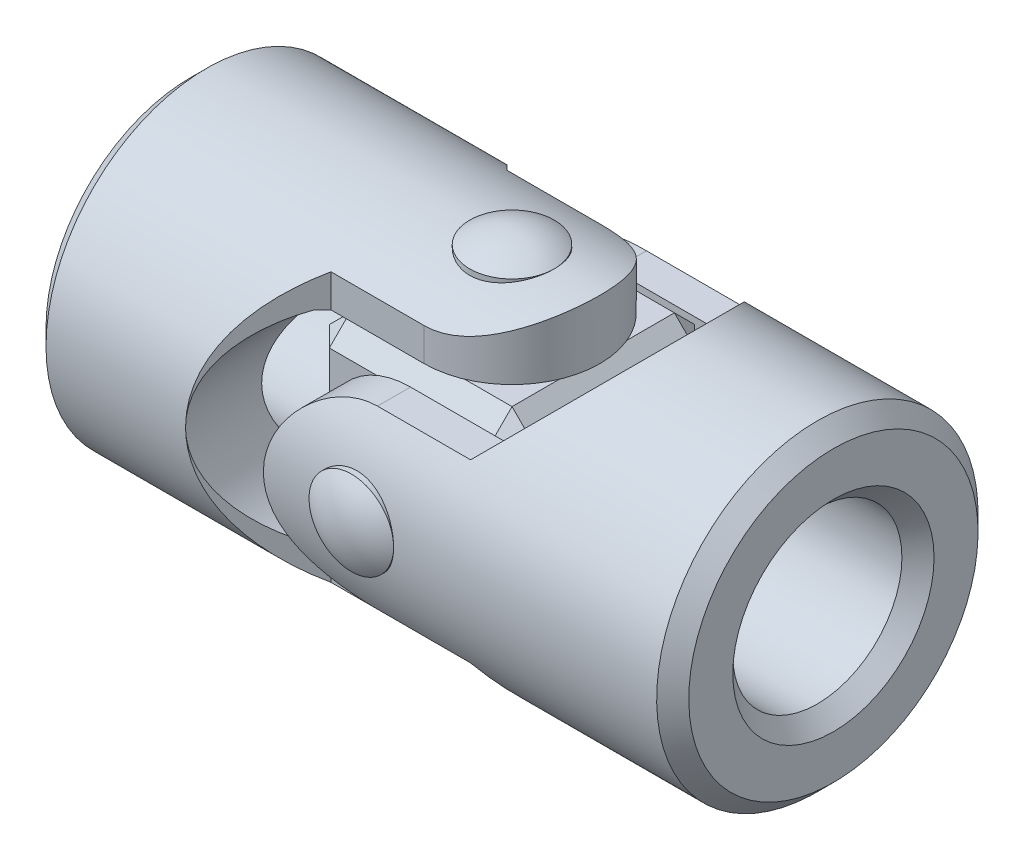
ISO-10303-21;
HEADER;
FILE_DESCRIPTION(('STEP AP214'),'2;1');
FILE_NAME('part.step','',(''),(''),'','','');
FILE_SCHEMA(('AUTOMOTIVE_DESIGN { 1 0 10303 214 1 1 1 1 }'));
ENDSEC;
DATA;
#1=APPLICATION_CONTEXT('core data for automotive mechanical design processes');
#2=APPLICATION_PROTOCOL_DEFINITION('international standard','automotive_design',2000,#1);
#3=PRODUCT_CONTEXT('',#1,'mechanical');
#4=PRODUCT('Part','Part','',(#3));
#5=PRODUCT_RELATED_PRODUCT_CATEGORY('part','',(#4));
#6=PRODUCT_DEFINITION_FORMATION('','',#4);
#7=PRODUCT_DEFINITION_CONTEXT('part definition',#1,'design');
#8=PRODUCT_DEFINITION('design','',#6,#7);
#9=PRODUCT_DEFINITION_SHAPE('','',#8);
#10=(LENGTH_UNIT() NAMED_UNIT(*) SI_UNIT(.MILLI.,.METRE.));
#11=(NAMED_UNIT(*) PLANE_ANGLE_UNIT() SI_UNIT($,.RADIAN.));
#12=(NAMED_UNIT(*) SI_UNIT($,.STERADIAN.) SOLID_ANGLE_UNIT());
#13=UNCERTAINTY_MEASURE_WITH_UNIT(LENGTH_MEASURE(1.E-05),#10,'distance_accuracy_value','');
#14=(GEOMETRIC_REPRESENTATION_CONTEXT(3) GLOBAL_UNCERTAINTY_ASSIGNED_CONTEXT((#13)) GLOBAL_UNIT_ASSIGNED_CONTEXT((#10,
#11,#12)) REPRESENTATION_CONTEXT('',''));
#15=CARTESIAN_POINT('',(0.,0.,0.));
#16=DIRECTION('',(0.,0.,1.));
#17=DIRECTION('',(1.,0.,0.));
#18=AXIS2_PLACEMENT_3D('',#15,#16,#17);
#19=CARTESIAN_POINT('',(0.,47.5,0.));
#20=DIRECTION('',(0.,-1.,0.));
#21=DIRECTION('',(-1.,0.,0.));
#22=AXIS2_PLACEMENT_3D('',#19,#20,#21);
#23=CYLINDRICAL_SURFACE('',#22,12.5);
#24=CARTESIAN_POINT('',(0.,47.5,0.));
#25=DIRECTION('',(0.,1.,0.));
#26=DIRECTION('',(1.,0.,0.));
#27=AXIS2_PLACEMENT_3D('',#24,#25,#26);
#28=CIRCLE('',#27,12.5);
#29=CARTESIAN_POINT('',(12.5,47.5,0.));
#30=VERTEX_POINT('',#29);
#31=EDGE_CURVE('P0_E10',#30,#30,#28,.T.);
#32=ORIENTED_EDGE('',*,*,#31,.F.);
#33=EDGE_LOOP('',(#32));
#34=FACE_BOUND('',#33,.T.);
#35=CARTESIAN_POINT('',(0.,-47.5,0.));
#36=DIRECTION('',(0.,-1.,0.));
#37=DIRECTION('',(0.,0.,-1.));
#38=AXIS2_PLACEMENT_3D('',#35,#36,#37);
#39=CIRCLE('',#38,12.5);
#40=CARTESIAN_POINT('',(0.,-47.5,-12.5));
#41=VERTEX_POINT('',#40);
#42=EDGE_CURVE('P0_E20',#41,#41,#39,.T.);
#43=ORIENTED_EDGE('',*,*,#42,.F.);
#44=EDGE_LOOP('',(#43));
#45=FACE_BOUND('',#44,.T.);
#46=ADVANCED_FACE('P0_F14',(#34,#45),#23,.T.);
#47=CARTESIAN_POINT('',(0.,28.8407894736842,0.));
#48=DIRECTION('',(0.,-1.,0.));
#49=DIRECTION('',(0.,0.,-1.));
#50=AXIS2_PLACEMENT_3D('',#47,#48,#49);
#51=SPHERICAL_SURFACE('',#50,22.4592105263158);
#52=ORIENTED_EDGE('',*,*,#31,.T.);
#53=EDGE_LOOP('',(#52));
#54=FACE_BOUND('',#53,.T.);
#55=ADVANCED_FACE('P0_F29',(#54),#51,.T.);
#56=CARTESIAN_POINT('',(0.,-28.8407894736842,0.));
#57=DIRECTION('',(0.,1.,0.));
#58=DIRECTION('',(0.,0.,-1.));
#59=AXIS2_PLACEMENT_3D('',#56,#57,#58);
#60=SPHERICAL_SURFACE('',#59,22.4592105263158);
#61=ORIENTED_EDGE('',*,*,#42,.T.);
#62=EDGE_LOOP('',(#61));
#63=FACE_BOUND('',#62,.T.);
#64=ADVANCED_FACE('P0_F26',(#63),#60,.T.);
#65=CLOSED_SHELL('',(#46,#55,#64));
#66=MANIFOLD_SOLID_BREP('P0_B1',#65);
#67=CARTESIAN_POINT('',(0.,0.,47.5));
#68=DIRECTION('',(0.,0.,-1.));
#69=DIRECTION('',(-1.,0.,0.));
#70=AXIS2_PLACEMENT_3D('',#67,#68,#69);
#71=CYLINDRICAL_SURFACE('',#70,12.5);
#72=CARTESIAN_POINT('',(0.,0.,47.5));
#73=DIRECTION('',(0.,0.,1.));
#74=DIRECTION('',(1.,0.,0.));
#75=AXIS2_PLACEMENT_3D('',#72,#73,#74);
#76=CIRCLE('',#75,12.5);
#77=CARTESIAN_POINT('',(12.5,0.,47.5));
#78=VERTEX_POINT('',#77);
#79=EDGE_CURVE('P1_E10',#78,#78,#76,.T.);
#80=ORIENTED_EDGE('',*,*,#79,.F.);
#81=EDGE_LOOP('',(#80));
#82=FACE_BOUND('',#81,.T.);
#83=CARTESIAN_POINT('',(0.,0.,-47.5));
#84=DIRECTION('',(0.,0.,-1.));
#85=DIRECTION('',(0.,1.,0.));
#86=AXIS2_PLACEMENT_3D('',#83,#84,#85);
#87=CIRCLE('',#86,12.5);
#88=CARTESIAN_POINT('',(0.,12.5,-47.5));
#89=VERTEX_POINT('',#88);
#90=EDGE_CURVE('P1_E20',#89,#89,#87,.T.);
#91=ORIENTED_EDGE('',*,*,#90,.F.);
#92=EDGE_LOOP('',(#91));
#93=FACE_BOUND('',#92,.T.);
#94=ADVANCED_FACE('P1_F14',(#82,#93),#71,.T.);
#95=CARTESIAN_POINT('',(0.,0.,28.8407894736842));
#96=DIRECTION('',(0.,0.,-1.));
#97=DIRECTION('',(0.,1.,0.));
#98=AXIS2_PLACEMENT_3D('',#95,#96,#97);
#99=SPHERICAL_SURFACE('',#98,22.4592105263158);
#100=ORIENTED_EDGE('',*,*,#79,.T.);
#101=EDGE_LOOP('',(#100));
#102=FACE_BOUND('',#101,.T.);
#103=ADVANCED_FACE('P1_F29',(#102),#99,.T.);
#104=CARTESIAN_POINT('',(0.,0.,-28.8407894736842));
#105=DIRECTION('',(0.,0.,1.));
#106=DIRECTION('',(0.,1.,0.));
#107=AXIS2_PLACEMENT_3D('',#104,#105,#106);
#108=SPHERICAL_SURFACE('',#107,22.4592105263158);
#109=ORIENTED_EDGE('',*,*,#90,.T.);
#110=EDGE_LOOP('',(#109));
#111=FACE_BOUND('',#110,.T.);
#112=ADVANCED_FACE('P1_F26',(#111),#108,.T.);
#113=CLOSED_SHELL('',(#94,#103,#112));
#114=MANIFOLD_SOLID_BREP('P1_B1',#113);
#115=CARTESIAN_POINT('',(0.,-47.5,-26.));
#116=DIRECTION('',(0.,0.,1.));
#117=DIRECTION('',(1.,0.,0.));
#118=AXIS2_PLACEMENT_3D('',#115,#116,#117);
#119=PLANE('',#118);
#120=DIRECTION('',(0.,1.,0.));
#121=VECTOR('',#120,1.);
#122=CARTESIAN_POINT('',(0.,-47.5,-26.));
#123=LINE('',#122,#121);
#124=CARTESIAN_POINT('',(0.,30.,-26.));
#125=VERTEX_POINT('',#124);
#126=CARTESIAN_POINT('',(0.,39.7523584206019,-26.));
#127=VERTEX_POINT('',#126);
#128=EDGE_CURVE('P2_E285',#125,#127,#123,.T.);
#129=ORIENTED_EDGE('',*,*,#128,.F.);
#130=DIRECTION('',(-1.,0.,0.));
#131=VECTOR('',#130,1.);
#132=CARTESIAN_POINT('',(0.,30.,-26.));
#133=LINE('',#132,#131);
#134=CARTESIAN_POINT('',(-27.5000000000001,30.,-26.));
#135=VERTEX_POINT('',#134);
#136=EDGE_CURVE('P2_E137',#125,#135,#133,.T.);
#137=ORIENTED_EDGE('',*,*,#136,.T.);
#138=DIRECTION('',(0.,1.,0.));
#139=VECTOR('',#138,1.);
#140=CARTESIAN_POINT('',(-27.5000000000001,-47.5,-26.));
#141=LINE('',#140,#139);
#142=CARTESIAN_POINT('',(-27.5000000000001,39.7523584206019,-26.));
#143=VERTEX_POINT('',#142);
#144=EDGE_CURVE('P2_E292',#135,#143,#141,.T.);
#145=ORIENTED_EDGE('',*,*,#144,.T.);
#146=DIRECTION('',(1.,0.,0.));
#147=VECTOR('',#146,1.);
#148=CARTESIAN_POINT('',(-95.,39.752358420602,-26.));
#149=LINE('',#148,#147);
#150=EDGE_CURVE('P2_E230',#127,#143,#149,.F.);
#151=ORIENTED_EDGE('',*,*,#150,.F.);
#152=EDGE_LOOP('',(#129,#137,#145,#151));
#153=FACE_BOUND('',#152,.T.);
#154=ADVANCED_FACE('P2_F16',(#153),#119,.F.);
#155=CARTESIAN_POINT('',(-27.5000000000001,-47.5,-26.));
#156=DIRECTION('',(-0.707106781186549,0.,0.707106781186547));
#157=DIRECTION('',(0.707106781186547,0.,0.707106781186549));
#158=AXIS2_PLACEMENT_3D('',#155,#156,#157);
#159=PLANE('',#158);
#160=ORIENTED_EDGE('',*,*,#144,.F.);
#161=DIRECTION('',(-0.707106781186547,0.,-0.707106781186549));
#162=VECTOR('',#161,1.);
#163=CARTESIAN_POINT('',(-27.5000000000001,30.,-26.));
#164=LINE('',#163,#162);
#165=CARTESIAN_POINT('',(-30.,30.,-28.4999999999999));
#166=VERTEX_POINT('',#165);
#167=EDGE_CURVE('P2_E140',#135,#166,#164,.T.);
#168=ORIENTED_EDGE('',*,*,#167,.T.);
#169=CARTESIAN_POINT('',(-15.8157894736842,0.,-14.3157894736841));
#170=DIRECTION('',(-0.707106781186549,0.,0.707106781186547));
#171=DIRECTION('',(-0.707106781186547,0.,-0.707106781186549));
#172=AXIS2_PLACEMENT_3D('',#169,#170,#171);
#173=ELLIPSE('',#172,46.9295605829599,33.1842105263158);
#174=CARTESIAN_POINT('',(-49.,0.,-47.5));
#175=VERTEX_POINT('',#174);
#176=EDGE_CURVE('P2_E146',#166,#175,#173,.T.);
#177=ORIENTED_EDGE('',*,*,#176,.T.);
#178=CARTESIAN_POINT('',(-1.50000000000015,0.,0.));
#179=DIRECTION('',(-0.707106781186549,0.,0.707106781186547));
#180=DIRECTION('',(0.707106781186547,0.,0.707106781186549));
#181=AXIS2_PLACEMENT_3D('',#178,#179,#180);
#182=ELLIPSE('',#181,67.1751442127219,47.5);
#183=EDGE_CURVE('P2_E234',#143,#175,#182,.T.);
#184=ORIENTED_EDGE('',*,*,#183,.F.);
#185=EDGE_LOOP('',(#160,#168,#177,#184));
#186=FACE_BOUND('',#185,.T.);
#187=ADVANCED_FACE('P2_F183',(#186),#159,.F.);
#188=CARTESIAN_POINT('',(-27.5000000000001,-47.5,26.));
#189=DIRECTION('',(-0.707106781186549,0.,-0.707106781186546));
#190=DIRECTION('',(-0.707106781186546,0.,0.707106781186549));
#191=AXIS2_PLACEMENT_3D('',#188,#189,#190);
#192=PLANE('',#191);
#193=CARTESIAN_POINT('',(-15.8157894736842,0.,14.3157894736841));
#194=DIRECTION('',(-0.707106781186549,0.,-0.707106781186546));
#195=DIRECTION('',(0.707106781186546,0.,-0.707106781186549));
#196=AXIS2_PLACEMENT_3D('',#193,#194,#195);
#197=ELLIPSE('',#196,46.9295605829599,33.1842105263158);
#198=CARTESIAN_POINT('',(-49.,0.,47.5));
#199=VERTEX_POINT('',#198);
#200=CARTESIAN_POINT('',(-30.,30.,28.4999999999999));
#201=VERTEX_POINT('',#200);
#202=EDGE_CURVE('P2_E107',#199,#201,#197,.T.);
#203=ORIENTED_EDGE('',*,*,#202,.T.);
#204=DIRECTION('',(0.707106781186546,0.,-0.707106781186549));
#205=VECTOR('',#204,1.);
#206=CARTESIAN_POINT('',(-27.5000000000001,30.,26.));
#207=LINE('',#206,#205);
#208=CARTESIAN_POINT('',(-27.5000000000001,30.,26.));
#209=VERTEX_POINT('',#208);
#210=EDGE_CURVE('P2_E134',#201,#209,#207,.T.);
#211=ORIENTED_EDGE('',*,*,#210,.T.);
#212=DIRECTION('',(0.,1.,0.));
#213=VECTOR('',#212,1.);
#214=CARTESIAN_POINT('',(-27.5000000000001,-47.5,26.));
#215=LINE('',#214,#213);
#216=CARTESIAN_POINT('',(-27.5000000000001,39.7523584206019,26.));
#217=VERTEX_POINT('',#216);
#218=EDGE_CURVE('P2_E295',#209,#217,#215,.T.);
#219=ORIENTED_EDGE('',*,*,#218,.T.);
#220=CARTESIAN_POINT('',(-1.50000000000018,0.,0.));
#221=DIRECTION('',(-0.707106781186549,0.,-0.707106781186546));
#222=DIRECTION('',(0.707106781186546,0.,-0.707106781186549));
#223=AXIS2_PLACEMENT_3D('',#220,#221,#222);
#224=ELLIPSE('',#223,67.1751442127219,47.5);
#225=EDGE_CURVE('P2_E243',#199,#217,#224,.T.);
#226=ORIENTED_EDGE('',*,*,#225,.F.);
#227=EDGE_LOOP('',(#203,#211,#219,#226));
#228=FACE_BOUND('',#227,.T.);
#229=ADVANCED_FACE('P2_F187',(#228),#192,.F.);
#230=CARTESIAN_POINT('',(0.,-47.5,26.));
#231=DIRECTION('',(0.,0.,-1.));
#232=DIRECTION('',(-1.,0.,0.));
#233=AXIS2_PLACEMENT_3D('',#230,#231,#232);
#234=PLANE('',#233);
#235=ORIENTED_EDGE('',*,*,#218,.F.);
#236=DIRECTION('',(1.,0.,0.));
#237=VECTOR('',#236,1.);
#238=CARTESIAN_POINT('',(0.,30.,26.));
#239=LINE('',#238,#237);
#240=CARTESIAN_POINT('',(0.,30.,26.));
#241=VERTEX_POINT('',#240);
#242=EDGE_CURVE('P2_E131',#209,#241,#239,.T.);
#243=ORIENTED_EDGE('',*,*,#242,.T.);
#244=DIRECTION('',(0.,1.,0.));
#245=VECTOR('',#244,1.);
#246=CARTESIAN_POINT('',(0.,-47.5,26.));
#247=LINE('',#246,#245);
#248=CARTESIAN_POINT('',(0.,39.7523584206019,26.));
#249=VERTEX_POINT('',#248);
#250=EDGE_CURVE('P2_E157',#241,#249,#247,.T.);
#251=ORIENTED_EDGE('',*,*,#250,.T.);
#252=DIRECTION('',(1.,0.,0.));
#253=VECTOR('',#252,1.);
#254=CARTESIAN_POINT('',(-95.,39.7523584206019,26.));
#255=LINE('',#254,#253);
#256=EDGE_CURVE('P2_E247',#217,#249,#255,.T.);
#257=ORIENTED_EDGE('',*,*,#256,.F.);
#258=EDGE_LOOP('',(#235,#243,#251,#257));
#259=FACE_BOUND('',#258,.T.);
#260=ADVANCED_FACE('P2_F190',(#259),#234,.F.);
#261=CARTESIAN_POINT('',(0.,-47.5,0.));
#262=DIRECTION('',(0.,1.,0.));
#263=DIRECTION('',(0.,0.,-1.));
#264=AXIS2_PLACEMENT_3D('',#261,#262,#263);
#265=CYLINDRICAL_SURFACE('',#264,26.);
#266=ORIENTED_EDGE('',*,*,#250,.F.);
#267=CARTESIAN_POINT('',(0.,30.,0.));
#268=DIRECTION('',(0.,1.,0.));
#269=DIRECTION('',(1.,0.,0.));
#270=AXIS2_PLACEMENT_3D('',#267,#268,#269);
#271=CIRCLE('',#270,26.);
#272=EDGE_CURVE('P2_E111',#241,#125,#271,.T.);
#273=ORIENTED_EDGE('',*,*,#272,.T.);
#274=ORIENTED_EDGE('',*,*,#128,.T.);
#275=CARTESIAN_POINT('',(0.,39.7523584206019,26.));
#276=CARTESIAN_POINT('',(0.335209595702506,39.7523432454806,26.0000087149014));
#277=CARTESIAN_POINT('',(0.670412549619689,39.7565980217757,25.9935175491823));
#278=CARTESIAN_POINT('',(1.34008737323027,39.7735353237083,25.9676014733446));
#279=CARTESIAN_POINT('',(1.67455928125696,39.7862173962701,25.9481772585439));
#280=CARTESIAN_POINT('',(2.34184017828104,39.8198845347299,25.8964804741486));
#281=CARTESIAN_POINT('',(2.67465022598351,39.8408633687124,25.8642175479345));
#282=CARTESIAN_POINT('',(3.33815793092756,39.8908985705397,25.786979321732));
#283=CARTESIAN_POINT('',(3.66885557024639,39.9199550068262,25.7420039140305));
#284=CARTESIAN_POINT('',(4.65235834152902,40.0183885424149,25.5889333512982));
#285=CARTESIAN_POINT('',(5.30125928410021,40.099273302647,25.4623269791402));
#286=CARTESIAN_POINT('',(6.58365141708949,40.2888545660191,25.1612732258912));
#287=CARTESIAN_POINT('',(7.21714027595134,40.3975552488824,24.9868186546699));
#288=CARTESIAN_POINT('',(8.46316093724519,40.6386825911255,24.592694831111));
#289=CARTESIAN_POINT('',(9.07574732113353,40.771040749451,24.3731558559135));
#290=CARTESIAN_POINT('',(10.2787605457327,41.0555867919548,23.8907335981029));
#291=CARTESIAN_POINT('',(10.8691878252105,41.2077742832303,23.6278511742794));
#292=CARTESIAN_POINT('',(12.0264657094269,41.528015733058,23.060359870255));
#293=CARTESIAN_POINT('',(12.5932735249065,41.6960968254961,22.7556792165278));
#294=CARTESIAN_POINT('',(13.7002279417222,42.043668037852,22.1069085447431));
#295=CARTESIAN_POINT('',(14.2403719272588,42.2231592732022,21.7628146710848));
#296=CARTESIAN_POINT('',(15.344416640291,42.6075975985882,21.0010053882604));
#297=CARTESIAN_POINT('',(15.905353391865,42.8133029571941,20.5793724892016));
#298=CARTESIAN_POINT('',(16.9906023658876,43.2282213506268,19.6929020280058));
#299=CARTESIAN_POINT('',(17.5149127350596,43.4374345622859,19.2280622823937));
#300=CARTESIAN_POINT('',(18.5247958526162,43.8543783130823,18.2571268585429));
#301=CARTESIAN_POINT('',(19.0103577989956,44.062108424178,17.751019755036));
#302=CARTESIAN_POINT('',(19.9401826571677,44.4711881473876,16.6997479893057));
#303=CARTESIAN_POINT('',(20.3844439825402,44.6725375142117,16.154581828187));
#304=CARTESIAN_POINT('',(21.2650186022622,45.0808842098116,14.9794164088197));
#305=CARTESIAN_POINT('',(21.6974355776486,45.2869031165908,14.3461462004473));
#306=CARTESIAN_POINT('',(22.5069068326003,45.6802551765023,13.0395455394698));
#307=CARTESIAN_POINT('',(22.8839571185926,45.8675869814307,12.3662122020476));
#308=CARTESIAN_POINT('',(23.5786053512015,46.2180780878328,10.9839545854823));
#309=CARTESIAN_POINT('',(23.896236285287,46.3812507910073,10.2750503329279));
#310=CARTESIAN_POINT('',(24.4683815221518,46.6786022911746,8.82635653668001));
#311=CARTESIAN_POINT('',(24.7229041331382,46.8127849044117,8.08657107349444));
#312=CARTESIAN_POINT('',(25.1469876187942,47.0381919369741,6.64428332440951));
#313=CARTESIAN_POINT('',(25.3218266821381,47.1320477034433,5.94374269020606));
#314=CARTESIAN_POINT('',(25.6130248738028,47.2891316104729,4.52721223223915));
#315=CARTESIAN_POINT('',(25.7293869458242,47.3523612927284,3.81122318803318));
#316=CARTESIAN_POINT('',(25.9018842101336,47.4463104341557,2.37034934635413));
#317=CARTESIAN_POINT('',(25.9580564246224,47.4770498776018,1.64547029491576));
#318=CARTESIAN_POINT('',(26.0094361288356,47.5051604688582,0.192930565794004));
#319=CARTESIAN_POINT('',(26.0046483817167,47.502534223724,-0.53472989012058));
#320=CARTESIAN_POINT('',(25.9378721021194,47.4660153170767,-1.91071952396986));
#321=CARTESIAN_POINT('',(25.8818772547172,47.4353989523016,-2.55943740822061));
#322=CARTESIAN_POINT('',(25.7217165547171,47.3482013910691,-3.84908082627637));
#323=CARTESIAN_POINT('',(25.6175547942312,47.2916224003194,-4.4900070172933));
#324=CARTESIAN_POINT('',(25.3622750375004,47.153827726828,-5.75972226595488));
#325=CARTESIAN_POINT('',(25.2111561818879,47.0726115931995,-6.38851110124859));
#326=CARTESIAN_POINT('',(24.8636037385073,46.8873883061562,-7.62999163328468));
#327=CARTESIAN_POINT('',(24.6671683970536,46.7833802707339,-8.24268270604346));
#328=CARTESIAN_POINT('',(24.2285524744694,46.5535980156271,-9.45501572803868));
#329=CARTESIAN_POINT('',(23.9858969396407,46.4275990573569,-10.0544428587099));
#330=CARTESIAN_POINT('',(23.4584545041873,46.1573159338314,-11.2301411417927));
#331=CARTESIAN_POINT('',(23.1736677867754,46.0130318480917,-11.8064123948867));
#332=CARTESIAN_POINT('',(22.5641323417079,45.7090830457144,-12.9333054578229));
#333=CARTESIAN_POINT('',(22.239375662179,45.5494152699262,-13.4839221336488));
#334=CARTESIAN_POINT('',(21.5521118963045,45.2178386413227,-14.5572193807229));
#335=CARTESIAN_POINT('',(21.1896013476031,45.0459286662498,-15.07989738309));
#336=CARTESIAN_POINT('',(20.3881592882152,44.6742411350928,-16.1498069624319));
#337=CARTESIAN_POINT('',(19.9452012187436,44.4734507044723,-16.6936742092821));
#338=CARTESIAN_POINT('',(19.0181624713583,44.0654882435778,-17.742589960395));
#339=CARTESIAN_POINT('',(18.5340791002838,43.8583157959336,-18.2476359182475));
#340=CARTESIAN_POINT('',(17.5265988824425,43.4421566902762,-19.2173811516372));
#341=CARTESIAN_POINT('',(17.0031571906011,43.2331682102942,-19.6820330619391));
#342=CARTESIAN_POINT('',(15.9196934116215,42.8186422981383,-20.5682577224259));
#343=CARTESIAN_POINT('',(15.3596702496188,42.6131049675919,-20.989829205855));
#344=CARTESIAN_POINT('',(14.1547482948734,42.1931369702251,-21.8225854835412));
#345=CARTESIAN_POINT('',(13.5067092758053,41.9794991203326,-22.2296420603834));
#346=CARTESIAN_POINT('',(12.1729254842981,41.5695501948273,-22.9871287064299));
#347=CARTESIAN_POINT('',(11.4871752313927,41.3732416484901,-23.3375505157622));
#348=CARTESIAN_POINT('',(10.0835060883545,41.0057258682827,-23.9774123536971));
#349=CARTESIAN_POINT('',(9.36567403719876,40.8344556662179,-24.2670061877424));
#350=CARTESIAN_POINT('',(7.90099432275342,40.5236283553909,-24.7825826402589));
#351=CARTESIAN_POINT('',(7.15415882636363,40.3840581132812,-25.0085916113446));
#352=CARTESIAN_POINT('',(5.87878314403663,40.1814511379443,-25.3322873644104));
#353=CARTESIAN_POINT('',(5.35634856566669,40.108190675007,-25.4479256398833));
#354=CARTESIAN_POINT('',(4.30315125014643,39.9811715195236,-25.6470258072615));
#355=CARTESIAN_POINT('',(3.77239093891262,39.9274072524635,-25.7304968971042));
#356=CARTESIAN_POINT('',(2.7029970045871,39.8405728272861,-25.8647485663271));
#357=CARTESIAN_POINT('',(2.16434147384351,39.8075802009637,-25.9154066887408));
#358=CARTESIAN_POINT('',(1.35405741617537,39.7744949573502,-25.9661298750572));
#359=CARTESIAN_POINT('',(1.08348180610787,39.7662004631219,-25.9788269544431));
#360=CARTESIAN_POINT('',(0.541945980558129,39.7551301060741,-25.9957628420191));
#361=CARTESIAN_POINT('',(0.270985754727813,39.7523543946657,-26.0000014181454));
#362=CARTESIAN_POINT('',(0.,39.7523584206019,-26.));
#363=B_SPLINE_CURVE_WITH_KNOTS('',3,(#275,#276,#277,#278,#279,#280,#281,#282,#283,#284,#285,
#286,#287,#288,#289,#290,#291,#292,#293,#294,#295,#296,#297,#298,#299,#300,#301,#302,#303,#304,
#305,#306,#307,#308,#309,#310,#311,#312,#313,#314,#315,#316,#317,#318,#319,#320,#321,#322,#323,
#324,#325,#326,#327,#328,#329,#330,#331,#332,#333,#334,#335,#336,#337,#338,#339,#340,#341,#342,
#343,#344,#345,#346,#347,#348,#349,#350,#351,#352,#353,#354,#355,#356,#357,#358,#359,#360,#361,
#362),.UNSPECIFIED.,.F.,.F.,(4,2,2,2,2,2,2,2,2,2,2,2,2,2,2,2,2,2,2,2,2,2,2,2,2,2,2,2,2,2,2,2,2,
2,2,2,2,2,2,2,2,2,2,4),(0.,1.00552724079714,2.01100042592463,3.01571980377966,4.02044769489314,
6.01583501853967,8.01152235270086,10.0015220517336,11.9914823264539,13.9849034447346,
15.9785197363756,18.1700289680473,20.3616490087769,22.5538778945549,24.7461909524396,
27.125137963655,29.5042564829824,31.8820502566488,34.2595308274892,36.4408033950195,
38.6219661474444,40.8017865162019,42.9814365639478,44.9346644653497,46.8877264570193,
48.8408241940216,50.7939975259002,52.7684448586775,54.7428836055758,56.7177157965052,
58.6927292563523,60.8792369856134,63.0658880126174,65.2550694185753,67.444315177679,
69.8249045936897,72.2058408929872,74.5806824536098,76.9545383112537,78.5735031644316,
80.1920047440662,81.8165122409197,82.6293492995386,83.4422086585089),.UNSPECIFIED.);
#364=EDGE_CURVE('P2_E205',#249,#127,#363,.T.);
#365=ORIENTED_EDGE('',*,*,#364,.F.);
#366=EDGE_LOOP('',(#266,#273,#274,#365));
#367=FACE_BOUND('',#366,.T.);
#368=ADVANCED_FACE('P2_F194',(#367),#265,.T.);
#369=CARTESIAN_POINT('',(-95.,0.,0.));
#370=DIRECTION('',(-1.,0.,0.));
#371=DIRECTION('',(0.,0.,1.));
#372=AXIS2_PLACEMENT_3D('',#369,#370,#371);
#373=PLANE('',#372);
#374=CARTESIAN_POINT('',(-95.,0.,0.));
#375=DIRECTION('',(-1.,0.,0.));
#376=DIRECTION('',(0.,0.,1.));
#377=AXIS2_PLACEMENT_3D('',#374,#375,#376);
#378=CIRCLE('',#377,29.75);
#379=CARTESIAN_POINT('',(-95.,0.,29.75));
#380=VERTEX_POINT('',#379);
#381=EDGE_CURVE('P2_E24',#380,#380,#378,.F.);
#382=ORIENTED_EDGE('',*,*,#381,.T.);
#383=EDGE_LOOP('',(#382));
#384=FACE_BOUND('',#383,.T.);
#385=CARTESIAN_POINT('',(-95.,0.,0.));
#386=DIRECTION('',(-1.,0.,0.));
#387=DIRECTION('',(0.,0.,1.));
#388=AXIS2_PLACEMENT_3D('',#385,#386,#387);
#389=CIRCLE('',#388,42.75);
#390=CARTESIAN_POINT('',(-95.,0.,42.75));
#391=VERTEX_POINT('',#390);
#392=EDGE_CURVE('P2_E257',#391,#391,#389,.T.);
#393=ORIENTED_EDGE('',*,*,#392,.T.);
#394=EDGE_LOOP('',(#393));
#395=FACE_BOUND('',#394,.T.);
#396=ADVANCED_FACE('P2_F216',(#384,#395),#373,.T.);
#397=CARTESIAN_POINT('',(-95.,0.,0.));
#398=DIRECTION('',(1.,0.,0.));
#399=DIRECTION('',(0.,0.,-1.));
#400=AXIS2_PLACEMENT_3D('',#397,#398,#399);
#401=CYLINDRICAL_SURFACE('',#400,47.5);
#402=CARTESIAN_POINT('',(-90.25,0.,0.));
#403=DIRECTION('',(-1.,0.,0.));
#404=DIRECTION('',(0.,0.,1.));
#405=AXIS2_PLACEMENT_3D('',#402,#403,#404);
#406=CIRCLE('',#405,47.5);
#407=CARTESIAN_POINT('',(-90.25,0.,47.5));
#408=VERTEX_POINT('',#407);
#409=EDGE_CURVE('P2_E11',#408,#408,#406,.F.);
#410=ORIENTED_EDGE('',*,*,#409,.T.);
#411=EDGE_LOOP('',(#410));
#412=FACE_BOUND('',#411,.T.);
#413=CARTESIAN_POINT('',(12.5,-47.5,0.));
#414=CARTESIAN_POINT('',(12.4999987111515,-47.4999992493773,-0.3447366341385));
#415=CARTESIAN_POINT('',(12.4857268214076,-47.4962378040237,-0.689498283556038));
#416=CARTESIAN_POINT('',(12.4287581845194,-47.4812940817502,-1.3765212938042));
#417=CARTESIAN_POINT('',(12.3860586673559,-47.470111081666,-1.71878240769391));
#418=CARTESIAN_POINT('',(12.272576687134,-47.4406274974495,-2.39846211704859));
#419=CARTESIAN_POINT('',(12.2017817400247,-47.422323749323,-2.73587849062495));
#420=CARTESIAN_POINT('',(12.0327063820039,-47.3791024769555,-3.4033059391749));
#421=CARTESIAN_POINT('',(11.9344265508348,-47.3541850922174,-3.73331717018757));
#422=CARTESIAN_POINT('',(11.7113225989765,-47.2984506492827,-4.38324289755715));
#423=CARTESIAN_POINT('',(11.5865328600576,-47.2676412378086,-4.70316986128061));
#424=CARTESIAN_POINT('',(11.3112994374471,-47.2009287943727,-5.33123475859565));
#425=CARTESIAN_POINT('',(11.1608556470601,-47.1650257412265,-5.63937264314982));
#426=CARTESIAN_POINT('',(10.8354466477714,-47.0890845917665,-6.24181775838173));
#427=CARTESIAN_POINT('',(10.6604850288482,-47.0490471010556,-6.53612700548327));
#428=CARTESIAN_POINT('',(10.2871844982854,-46.965871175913,-7.10920704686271));
#429=CARTESIAN_POINT('',(10.0888372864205,-46.9227316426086,-7.38797227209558));
#430=CARTESIAN_POINT('',(9.66591398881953,-46.8336024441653,-7.933576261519));
#431=CARTESIAN_POINT('',(9.44088954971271,-46.7875728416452,-8.20006104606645));
#432=CARTESIAN_POINT('',(8.96944546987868,-46.6947272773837,-8.71323444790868));
#433=CARTESIAN_POINT('',(8.72302555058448,-46.6479113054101,-8.95992280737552));
#434=CARTESIAN_POINT('',(8.21031817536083,-46.5547610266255,-9.43197405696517));
#435=CARTESIAN_POINT('',(7.94402485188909,-46.5084268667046,-9.6573306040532));
#436=CARTESIAN_POINT('',(7.39344267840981,-46.417553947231,-10.0850626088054));
#437=CARTESIAN_POINT('',(7.10916011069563,-46.3730145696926,-10.2874460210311));
#438=CARTESIAN_POINT('',(6.51939705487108,-46.2862404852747,-10.6711432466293));
#439=CARTESIAN_POINT('',(6.21363960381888,-46.2440574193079,-10.8520433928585));
#440=CARTESIAN_POINT('',(5.58737887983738,-46.1640809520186,-11.1873749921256));
#441=CARTESIAN_POINT('',(5.26687539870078,-46.1262876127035,-11.3418060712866));
#442=CARTESIAN_POINT('',(4.61339632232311,-46.0562474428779,-11.6229545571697));
#443=CARTESIAN_POINT('',(4.28042247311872,-46.0239998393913,-11.7496758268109));
#444=CARTESIAN_POINT('',(3.60435722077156,-45.9660526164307,-11.9743678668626));
#445=CARTESIAN_POINT('',(3.26126608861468,-45.9403528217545,-12.0723394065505));
#446=CARTESIAN_POINT('',(2.57516282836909,-45.8968065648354,-12.2368390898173));
#447=CARTESIAN_POINT('',(2.23231558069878,-45.8787995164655,-12.3040125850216));
#448=CARTESIAN_POINT('',(1.54189108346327,-45.850392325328,-12.4094526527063));
#449=CARTESIAN_POINT('',(1.19431389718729,-45.8399920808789,-12.4477196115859));
#450=CARTESIAN_POINT('',(0.497083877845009,-45.8271275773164,-12.4949982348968));
#451=CARTESIAN_POINT('',(0.147431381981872,-45.8246620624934,-12.5040145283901));
#452=CARTESIAN_POINT('',(-0.551361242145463,-45.8277419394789,-12.4927220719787));
#453=CARTESIAN_POINT('',(-0.900501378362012,-45.8332872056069,-12.4724137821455));
#454=CARTESIAN_POINT('',(-1.58620341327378,-45.8519548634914,-12.4036065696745));
#455=CARTESIAN_POINT('',(-1.92284961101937,-45.8648676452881,-12.355887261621));
#456=CARTESIAN_POINT('',(-2.59079888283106,-45.8977228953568,-12.2332765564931));
#457=CARTESIAN_POINT('',(-2.92210206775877,-45.9176652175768,-12.1583857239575));
#458=CARTESIAN_POINT('',(-3.57711299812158,-45.9639966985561,-11.9820410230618));
#459=CARTESIAN_POINT('',(-3.90082033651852,-45.9903862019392,-11.88058573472));
#460=CARTESIAN_POINT('',(-4.53847160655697,-46.0488535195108,-11.6519099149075));
#461=CARTESIAN_POINT('',(-4.85241536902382,-46.0809314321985,-11.5246889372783));
#462=CARTESIAN_POINT('',(-5.47190632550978,-46.150254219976,-11.2438945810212));
#463=CARTESIAN_POINT('',(-5.77732306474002,-46.187552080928,-11.0900465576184));
#464=CARTESIAN_POINT('',(-6.37415675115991,-46.2659955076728,-10.7581006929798));
#465=CARTESIAN_POINT('',(-6.66557364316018,-46.3071410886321,-10.580002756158));
#466=CARTESIAN_POINT('',(-7.23263698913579,-46.3921591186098,-10.2007513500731));
#467=CARTESIAN_POINT('',(-7.50828108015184,-46.4360319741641,-9.99959443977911));
#468=CARTESIAN_POINT('',(-8.04206780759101,-46.5253220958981,-9.57555944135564));
#469=CARTESIAN_POINT('',(-8.30020968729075,-46.5707394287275,-9.35268041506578));
#470=CARTESIAN_POINT('',(-8.80529422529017,-46.6633648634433,-8.87921066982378));
#471=CARTESIAN_POINT('',(-9.05162116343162,-46.7105840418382,-8.62796481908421));
#472=CARTESIAN_POINT('',(-9.52231067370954,-46.804072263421,-8.10550631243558));
#473=CARTESIAN_POINT('',(-9.74667277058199,-46.8503412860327,-7.83429322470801));
#474=CARTESIAN_POINT('',(-10.171907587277,-46.9406489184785,-7.27365688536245));
#475=CARTESIAN_POINT('',(-10.3727788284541,-46.9846873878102,-6.98423248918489));
#476=CARTESIAN_POINT('',(-10.7495738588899,-47.069306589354,-6.38910729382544));
#477=CARTESIAN_POINT('',(-10.92549862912,-47.1098874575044,-6.08340713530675));
#478=CARTESIAN_POINT('',(-11.2517748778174,-47.1866207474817,-5.45646036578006));
#479=CARTESIAN_POINT('',(-11.4020160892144,-47.2227538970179,-5.13515396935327));
#480=CARTESIAN_POINT('',(-11.67482610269,-47.2893651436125,-4.48042476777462));
#481=CARTESIAN_POINT('',(-11.7973947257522,-47.3198432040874,-4.14700188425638));
#482=CARTESIAN_POINT('',(-12.0138137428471,-47.374262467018,-3.47050107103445));
#483=CARTESIAN_POINT('',(-12.1076691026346,-47.3982047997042,-3.12742482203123));
#484=CARTESIAN_POINT('',(-12.26586722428,-47.4388621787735,-2.43411515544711));
#485=CARTESIAN_POINT('',(-12.3302107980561,-47.455577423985,-2.08388193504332));
#486=CARTESIAN_POINT('',(-12.4274165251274,-47.4809282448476,-1.38886763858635));
#487=CARTESIAN_POINT('',(-12.4611149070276,-47.489778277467,-1.04421113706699));
#488=CARTESIAN_POINT('',(-12.4998003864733,-47.4999437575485,-0.353182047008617));
#489=CARTESIAN_POINT('',(-12.5047880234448,-47.5012593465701,-0.00680949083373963));
#490=CARTESIAN_POINT('',(-12.4860096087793,-47.496319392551,0.685067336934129));
#491=CARTESIAN_POINT('',(-12.4622462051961,-47.4900645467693,1.03057168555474));
#492=CARTESIAN_POINT('',(-12.3861786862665,-47.4701598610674,1.71820629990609));
#493=CARTESIAN_POINT('',(-12.3338747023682,-47.4565100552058,2.06033658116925));
#494=CARTESIAN_POINT('',(-12.2022877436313,-47.4224826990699,2.73307196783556));
#495=CARTESIAN_POINT('',(-12.1234699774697,-47.4022213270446,3.06377412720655));
#496=CARTESIAN_POINT('',(-11.9393170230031,-47.3554576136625,3.71724952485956));
#497=CARTESIAN_POINT('',(-11.833982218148,-47.3289553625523,4.04002287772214));
#498=CARTESIAN_POINT('',(-11.5976062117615,-47.2704068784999,4.67551862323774));
#499=CARTESIAN_POINT('',(-11.4665630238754,-47.2383602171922,4.98824023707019));
#500=CARTESIAN_POINT('',(-11.1797493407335,-47.1695603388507,5.60159150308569));
#501=CARTESIAN_POINT('',(-11.0239783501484,-47.1328070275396,5.90222091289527));
#502=CARTESIAN_POINT('',(-10.685593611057,-47.0548009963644,6.4951387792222));
#503=CARTESIAN_POINT('',(-10.5025220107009,-47.0134754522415,6.78715636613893));
#504=CARTESIAN_POINT('',(-10.1131211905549,-46.9280209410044,7.35481150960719));
#505=CARTESIAN_POINT('',(-9.90679172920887,-46.8838919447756,7.63044889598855));
#506=CARTESIAN_POINT('',(-9.47221957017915,-46.793992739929,8.16366143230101));
#507=CARTESIAN_POINT('',(-9.24397317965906,-46.7482222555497,8.42123352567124));
#508=CARTESIAN_POINT('',(-8.76706970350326,-46.6562619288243,8.91665372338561));
#509=CARTESIAN_POINT('',(-8.51841234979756,-46.6100720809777,9.15450156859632));
#510=CARTESIAN_POINT('',(-7.99516394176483,-46.5172501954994,9.61520505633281));
#511=CARTESIAN_POINT('',(-7.72004841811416,-46.4706408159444,9.83747005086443));
#512=CARTESIAN_POINT('',(-7.15173386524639,-46.3796144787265,10.2580541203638));
#513=CARTESIAN_POINT('',(-6.85853446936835,-46.3351975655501,10.456372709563));
#514=CARTESIAN_POINT('',(-6.25600513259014,-46.2498506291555,10.8276318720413));
#515=CARTESIAN_POINT('',(-5.94667551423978,-46.2089205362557,11.000572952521));
#516=CARTESIAN_POINT('',(-5.31397668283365,-46.1317654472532,11.3197700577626));
#517=CARTESIAN_POINT('',(-4.99060767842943,-46.0955403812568,11.4660264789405));
#518=CARTESIAN_POINT('',(-4.33402588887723,-46.0290968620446,11.7299044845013));
#519=CARTESIAN_POINT('',(-4.00088252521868,-45.9988441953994,11.8476900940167));
#520=CARTESIAN_POINT('',(-3.32531739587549,-45.9450147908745,12.0547531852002));
#521=CARTESIAN_POINT('',(-2.98289563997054,-45.9214380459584,12.1440306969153));
#522=CARTESIAN_POINT('',(-2.29137041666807,-45.8817094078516,12.2932792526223));
#523=CARTESIAN_POINT('',(-1.94226835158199,-45.8655559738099,12.3532563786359));
#524=CARTESIAN_POINT('',(-1.23996317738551,-45.8411864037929,12.4433845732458));
#525=CARTESIAN_POINT('',(-0.886760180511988,-45.8329700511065,12.4735364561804));
#526=CARTESIAN_POINT('',(-0.19029035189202,-45.8248714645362,12.5032545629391));
#527=CARTESIAN_POINT('',(0.152933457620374,-45.8247313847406,12.503767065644));
#528=CARTESIAN_POINT('',(0.838172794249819,-45.8321411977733,12.4765793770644));
#529=CARTESIAN_POINT('',(1.18018834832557,-45.8396909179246,12.4488798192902));
#530=CARTESIAN_POINT('',(1.86052953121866,-45.8622499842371,12.3655118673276));
#531=CARTESIAN_POINT('',(2.19885527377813,-45.877259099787,12.3098443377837));
#532=CARTESIAN_POINT('',(2.86942503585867,-45.9142844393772,12.1710162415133));
#533=CARTESIAN_POINT('',(3.20166902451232,-45.9363006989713,12.0878555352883));
#534=CARTESIAN_POINT('',(3.85535473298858,-45.9865015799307,11.8954391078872));
#535=CARTESIAN_POINT('',(4.17685795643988,-46.0146396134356,11.7863799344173));
#536=CARTESIAN_POINT('',(4.80947467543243,-46.076370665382,11.542696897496));
#537=CARTESIAN_POINT('',(5.1205882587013,-46.1099636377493,11.408073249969));
#538=CARTESIAN_POINT('',(5.73042007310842,-46.1816631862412,11.114262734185));
#539=CARTESIAN_POINT('',(6.02913906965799,-46.2197694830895,10.9550773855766));
#540=CARTESIAN_POINT('',(6.6124580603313,-46.2994716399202,10.6131868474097));
#541=CARTESIAN_POINT('',(6.89705260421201,-46.3410688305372,10.4304726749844));
#542=CARTESIAN_POINT('',(7.45811059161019,-46.4278411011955,10.0372917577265));
#543=CARTESIAN_POINT('',(7.73411570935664,-46.4730841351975,9.82618574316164));
#544=CARTESIAN_POINT('',(8.26760258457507,-46.5648381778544,9.38175562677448));
#545=CARTESIAN_POINT('',(8.52507581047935,-46.6113497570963,9.14842140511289));
#546=CARTESIAN_POINT('',(9.01977461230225,-46.7043604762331,8.66107672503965));
#547=CARTESIAN_POINT('',(9.25699539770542,-46.7508596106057,8.40706140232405));
#548=CARTESIAN_POINT('',(9.70947055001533,-46.8425527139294,7.88014736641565));
#549=CARTESIAN_POINT('',(9.92473463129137,-46.8877472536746,7.60725709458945));
#550=CARTESIAN_POINT('',(10.3362751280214,-46.976561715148,7.0382725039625));
#551=CARTESIAN_POINT('',(10.5320539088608,-47.0201281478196,6.7418095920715));
#552=CARTESIAN_POINT('',(10.8978113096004,-47.1034030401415,6.13300600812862));
#553=CARTESIAN_POINT('',(11.0677995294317,-47.1431129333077,5.82067130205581));
#554=CARTESIAN_POINT('',(11.3806923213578,-47.2175504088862,5.18229255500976));
#555=CARTESIAN_POINT('',(11.5236070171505,-47.2522798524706,4.85625369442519));
#556=CARTESIAN_POINT('',(11.7812559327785,-47.3157730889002,4.1926889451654));
#557=CARTESIAN_POINT('',(11.8959940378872,-47.3445377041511,3.85516464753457));
#558=CARTESIAN_POINT('',(12.0794218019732,-47.3909904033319,3.22883402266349));
#559=CARTESIAN_POINT('',(12.1526143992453,-47.4097284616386,2.94141460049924));
#560=CARTESIAN_POINT('',(12.2784429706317,-47.4421379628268,2.36173878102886));
#561=CARTESIAN_POINT('',(12.3310737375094,-47.4558081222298,2.06948117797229));
#562=CARTESIAN_POINT('',(12.4154114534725,-47.4777925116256,1.481782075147));
#563=CARTESIAN_POINT('',(12.4471198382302,-47.4861071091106,1.18634079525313));
#564=CARTESIAN_POINT('',(12.4894116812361,-47.4972103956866,0.593938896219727));
#565=CARTESIAN_POINT('',(12.5000011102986,-47.5000006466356,0.29697873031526));
#566=CARTESIAN_POINT('',(12.5,-47.5,0.));
#567=B_SPLINE_CURVE_WITH_KNOTS('',3,(#413,#414,#415,#416,#417,#418,#419,#420,#421,#422,#423,
#424,#425,#426,#427,#428,#429,#430,#431,#432,#433,#434,#435,#436,#437,#438,#439,#440,#441,#442,
#443,#444,#445,#446,#447,#448,#449,#450,#451,#452,#453,#454,#455,#456,#457,#458,#459,#460,#461,
#462,#463,#464,#465,#466,#467,#468,#469,#470,#471,#472,#473,#474,#475,#476,#477,#478,#479,#480,
#481,#482,#483,#484,#485,#486,#487,#488,#489,#490,#491,#492,#493,#494,#495,#496,#497,#498,#499,
#500,#501,#502,#503,#504,#505,#506,#507,#508,#509,#510,#511,#512,#513,#514,#515,#516,#517,#518,
#519,#520,#521,#522,#523,#524,#525,#526,#527,#528,#529,#530,#531,#532,#533,#534,#535,#536,#537,
#538,#539,#540,#541,#542,#543,#544,#545,#546,#547,#548,#549,#550,#551,#552,#553,#554,#555,#556,
#557,#558,#559,#560,#561,#562,#563,#564,#565,#566),.UNSPECIFIED.,.T.,.F.,(4,2,2,2,2,2,2,2,2,2,2,
2,2,2,2,2,2,2,2,2,2,2,2,2,2,2,2,2,2,2,2,2,2,2,2,2,2,2,2,2,2,2,2,2,2,2,2,2,2,2,2,2,2,2,2,2,2,2,2,
2,2,2,2,2,2,2,2,2,2,2,2,2,2,2,2,2,4),(0.,1.03393854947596,2.06797786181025,3.10247715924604,
4.13695463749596,5.17009856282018,6.20324678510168,7.2362438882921,8.26960874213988,
9.32381715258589,10.3780392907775,11.4325739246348,12.4867422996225,13.5587181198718,
14.630709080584,15.7025505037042,16.7743632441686,17.8225559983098,18.8707347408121,
19.9187475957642,20.9667440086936,21.9863134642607,23.0058617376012,24.0254645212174,
25.0450849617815,26.0759282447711,27.1067755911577,28.1377769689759,29.1688228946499,
30.232601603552,31.2964033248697,32.3602719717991,33.4240987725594,34.4923840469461,
35.5606762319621,36.6287835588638,37.696861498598,38.7348341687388,39.7727873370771,
40.8106449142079,41.8484977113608,42.8690157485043,43.8895190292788,44.9101011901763,
45.9307037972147,46.9708968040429,48.0111006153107,49.0514800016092,50.0918730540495,
51.1608209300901,52.2297904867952,53.2987386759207,54.3676709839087,55.4302898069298,
56.492907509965,57.5553045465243,58.6176725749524,59.6461036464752,60.6745116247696,
61.7028878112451,62.7312692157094,63.7520823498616,64.772886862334,65.793628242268,
66.8147604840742,67.8648028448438,68.9153255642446,69.9660960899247,71.0163996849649,
72.0889079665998,73.1610160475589,74.2327224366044,75.3042809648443,76.1950710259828,
77.0860865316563,77.9770408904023,78.8677433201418),.UNSPECIFIED.);
#568=CARTESIAN_POINT('',(12.5,-47.5,0.));
#569=VERTEX_POINT('',#568);
#570=EDGE_CURVE('P2_E225',#569,#569,#567,.T.);
#571=ORIENTED_EDGE('',*,*,#570,.T.);
#572=EDGE_LOOP('',(#571));
#573=FACE_BOUND('',#572,.T.);
#574=CARTESIAN_POINT('',(0.,45.8257569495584,-12.5));
#575=CARTESIAN_POINT('',(0.344503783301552,45.8257577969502,-12.4999986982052));
#576=CARTESIAN_POINT('',(0.689032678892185,45.8296523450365,-12.48574592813));
#577=CARTESIAN_POINT('',(1.37558356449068,45.8451132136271,-12.4288554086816));
#578=CARTESIAN_POINT('',(1.71760530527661,45.856680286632,-12.3862148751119));
#579=CARTESIAN_POINT('',(2.39680212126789,45.8871388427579,-12.2728940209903));
#580=CARTESIAN_POINT('',(2.73397488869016,45.9060337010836,-12.2022007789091));
#581=CARTESIAN_POINT('',(3.40090916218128,45.9505763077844,-12.0333763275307));
#582=CARTESIAN_POINT('',(3.73067081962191,45.9762239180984,-11.9352456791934));
#583=CARTESIAN_POINT('',(4.38006515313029,46.0334714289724,-11.7125018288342));
#584=CARTESIAN_POINT('',(4.69971138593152,46.0650629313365,-11.5879259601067));
#585=CARTESIAN_POINT('',(5.32723747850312,46.1333085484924,-11.3131721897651));
#586=CARTESIAN_POINT('',(5.63511728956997,46.1699626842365,-11.1629941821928));
#587=CARTESIAN_POINT('',(6.23708966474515,46.2472938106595,-10.838158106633));
#588=CARTESIAN_POINT('',(6.53118410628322,46.2879702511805,-10.6635033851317));
#589=CARTESIAN_POINT('',(7.10389006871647,46.3722436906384,-10.2908458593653));
#590=CARTESIAN_POINT('',(7.38249603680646,46.4158417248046,-10.0928347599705));
#591=CARTESIAN_POINT('',(7.92829528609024,46.5057397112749,-9.67025519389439));
#592=CARTESIAN_POINT('',(8.19510647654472,46.5520778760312,-9.44520120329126));
#593=CARTESIAN_POINT('',(8.70893700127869,46.6452755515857,-8.97362921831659));
#594=CARTESIAN_POINT('',(8.95595609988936,46.6921350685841,-8.72711096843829));
#595=CARTESIAN_POINT('',(9.42865757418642,46.7851029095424,-8.21413987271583));
#596=CARTESIAN_POINT('',(9.65433403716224,46.8312110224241,-7.94768153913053));
#597=CARTESIAN_POINT('',(10.0826839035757,46.9213882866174,-7.39670254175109));
#598=CARTESIAN_POINT('',(10.2853653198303,46.9654581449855,-7.11218822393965));
#599=CARTESIAN_POINT('',(10.6694156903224,47.0510448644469,-6.52222349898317));
#600=CARTESIAN_POINT('',(10.8503974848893,47.0925104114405,-6.21651340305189));
#601=CARTESIAN_POINT('',(11.1858966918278,47.1709409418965,-5.59033795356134));
#602=CARTESIAN_POINT('',(11.3404137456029,47.2079058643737,-5.26987240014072));
#603=CARTESIAN_POINT('',(11.6217345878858,47.2762740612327,-4.61646888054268));
#604=CARTESIAN_POINT('',(11.7485418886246,47.3076780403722,-4.28353250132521));
#605=CARTESIAN_POINT('',(11.9734041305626,47.364021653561,-3.60755595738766));
#606=CARTESIAN_POINT('',(12.0714598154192,47.3889614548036,-3.26451605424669));
#607=CARTESIAN_POINT('',(12.2361036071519,47.4311716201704,-2.5786358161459));
#608=CARTESIAN_POINT('',(12.3033456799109,47.4486008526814,-2.23596217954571));
#609=CARTESIAN_POINT('',(12.4089492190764,47.4760930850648,-1.54589990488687));
#610=CARTESIAN_POINT('',(12.4473110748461,47.4861561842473,-1.19851133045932));
#611=CARTESIAN_POINT('',(12.4948106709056,47.4986291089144,-0.501654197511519));
#612=CARTESIAN_POINT('',(12.5039525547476,47.5010400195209,-0.152185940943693));
#613=CARTESIAN_POINT('',(12.4929414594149,47.4981426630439,0.546254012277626));
#614=CARTESIAN_POINT('',(12.472788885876,47.4928345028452,0.89522571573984));
#615=CARTESIAN_POINT('',(12.4042264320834,47.4748752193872,1.58150241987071));
#616=CARTESIAN_POINT('',(12.3565240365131,47.4624079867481,1.91888320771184));
#617=CARTESIAN_POINT('',(12.2338243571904,47.4306119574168,2.58830725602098));
#618=CARTESIAN_POINT('',(12.1588275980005,47.4112832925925,2.92035061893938));
#619=CARTESIAN_POINT('',(11.9821478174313,47.3662810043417,3.57682615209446));
#620=CARTESIAN_POINT('',(11.8804638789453,47.3406071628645,3.90125806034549));
#621=CARTESIAN_POINT('',(11.6512088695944,47.2835949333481,4.54032814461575));
#622=CARTESIAN_POINT('',(11.5236373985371,47.2522564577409,4.85496616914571));
#623=CARTESIAN_POINT('',(11.2422024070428,47.1844072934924,5.47540404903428));
#624=CARTESIAN_POINT('',(11.0880951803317,47.1478492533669,5.78108814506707));
#625=CARTESIAN_POINT('',(10.7555881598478,47.0707609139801,6.37841423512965));
#626=CARTESIAN_POINT('',(10.5771882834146,47.0302306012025,6.67005618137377));
#627=CARTESIAN_POINT('',(10.1973046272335,46.9462534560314,7.23751169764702));
#628=CARTESIAN_POINT('',(9.99581745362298,46.9028061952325,7.51332293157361));
#629=CARTESIAN_POINT('',(9.57110868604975,46.8141325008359,8.04737761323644));
#630=CARTESIAN_POINT('',(9.34788614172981,46.7689059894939,8.3056202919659));
#631=CARTESIAN_POINT('',(8.87414376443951,46.6764915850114,8.81038771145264));
#632=CARTESIAN_POINT('',(8.6230068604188,46.6292855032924,9.05633034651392));
#633=CARTESIAN_POINT('',(8.10084576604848,46.5355536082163,9.5262624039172));
#634=CARTESIAN_POINT('',(7.82982116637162,46.4890278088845,9.75025137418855));
#635=CARTESIAN_POINT('',(7.26963004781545,46.3979649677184,10.1747724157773));
#636=CARTESIAN_POINT('',(6.98046204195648,46.3534280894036,10.375302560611));
#637=CARTESIAN_POINT('',(6.38590903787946,46.2676271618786,10.7514606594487));
#638=CARTESIAN_POINT('',(6.08052466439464,46.2263629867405,10.927089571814));
#639=CARTESIAN_POINT('',(5.45370856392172,46.1480844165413,11.2531148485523));
#640=CARTESIAN_POINT('',(5.13219246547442,46.1110966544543,11.4033555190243));
#641=CARTESIAN_POINT('',(4.47702538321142,46.0427804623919,11.6761360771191));
#642=CARTESIAN_POINT('',(4.14337431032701,46.0114520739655,11.7986757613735));
#643=CARTESIAN_POINT('',(3.46640131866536,45.955436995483,12.0150033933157));
#644=CARTESIAN_POINT('',(3.12308132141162,45.9307489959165,12.1087970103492));
#645=CARTESIAN_POINT('',(2.42926263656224,45.8887942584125,12.2668358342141));
#646=CARTESIAN_POINT('',(2.07876416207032,45.871527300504,12.3310819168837));
#647=CARTESIAN_POINT('',(1.38355522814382,45.8453607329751,12.4280063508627));
#648=CARTESIAN_POINT('',(1.0389738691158,45.8362318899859,12.4615502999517));
#649=CARTESIAN_POINT('',(0.348100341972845,45.8257775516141,12.4999405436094));
#650=CARTESIAN_POINT('',(0.00180820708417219,45.8244519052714,12.5047873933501));
#651=CARTESIAN_POINT('',(-0.68989087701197,45.8296448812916,12.4857416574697));
#652=CARTESIAN_POINT('',(-1.03529790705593,45.8361627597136,12.4618517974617));
#653=CARTESIAN_POINT('',(-1.72271296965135,45.8568392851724,12.3855499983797));
#654=CARTESIAN_POINT('',(-2.0647210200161,45.8709978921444,12.333138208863));
#655=CARTESIAN_POINT('',(-2.73653118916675,45.906188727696,12.2014907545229));
#656=CARTESIAN_POINT('',(-3.06644200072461,45.9270879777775,12.1227730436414));
#657=CARTESIAN_POINT('',(-3.71834609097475,45.9752153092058,11.9389527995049));
#658=CARTESIAN_POINT('',(-4.04033949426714,46.0024432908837,11.8338506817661));
#659=CARTESIAN_POINT('',(-4.67431042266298,46.0624529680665,11.5980693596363));
#660=CARTESIAN_POINT('',(-4.98628713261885,46.0952351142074,11.4673880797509));
#661=CARTESIAN_POINT('',(-5.59821730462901,46.1654376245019,11.1814146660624));
#662=CARTESIAN_POINT('',(-5.89817014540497,46.2028582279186,11.0261212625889));
#663=CARTESIAN_POINT('',(-6.4904690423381,46.2821586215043,10.6884284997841));
#664=CARTESIAN_POINT('',(-6.78251379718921,46.3241168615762,10.5055190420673));
#665=CARTESIAN_POINT('',(-7.35025581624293,46.4106402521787,10.1164309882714));
#666=CARTESIAN_POINT('',(-7.6259528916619,46.4552054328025,9.9102521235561));
#667=CARTESIAN_POINT('',(-8.15932241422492,46.5457349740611,9.47595646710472));
#668=CARTESIAN_POINT('',(-8.41699175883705,46.5916995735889,9.24783591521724));
#669=CARTESIAN_POINT('',(-8.91263500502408,46.6837846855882,8.77115507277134));
#670=CARTESIAN_POINT('',(-9.15060909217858,46.7299051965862,8.52259497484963));
#671=CARTESIAN_POINT('',(-9.61174623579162,46.8223579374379,7.99933335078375));
#672=CARTESIAN_POINT('',(-9.83430495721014,46.8686596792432,7.72409341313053));
#673=CARTESIAN_POINT('',(-10.2554594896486,46.9588343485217,7.15546855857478));
#674=CARTESIAN_POINT('',(-10.4540548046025,47.0027072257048,6.86208326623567));
#675=CARTESIAN_POINT('',(-10.8258320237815,47.0867905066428,6.25913682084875));
#676=CARTESIAN_POINT('',(-10.9990146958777,47.1270010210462,5.94957615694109));
#677=CARTESIAN_POINT('',(-11.3186489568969,47.2026237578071,5.31638536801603));
#678=CARTESIAN_POINT('',(-11.46510097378,47.238036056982,4.99275546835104));
#679=CARTESIAN_POINT('',(-11.729097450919,47.3028061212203,4.33618695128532));
#680=CARTESIAN_POINT('',(-11.8468519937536,47.3322076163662,4.00333715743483));
#681=CARTESIAN_POINT('',(-12.0538962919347,47.3844528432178,3.32839056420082));
#682=CARTESIAN_POINT('',(-12.143186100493,47.4072965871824,2.98629378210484));
#683=CARTESIAN_POINT('',(-12.2925118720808,47.4457652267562,2.2954355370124));
#684=CARTESIAN_POINT('',(-12.3525530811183,47.4613914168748,1.9466752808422));
#685=CARTESIAN_POINT('',(-12.4428654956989,47.4849765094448,1.24506681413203));
#686=CARTESIAN_POINT('',(-12.4731374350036,47.4929356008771,0.892218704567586));
#687=CARTESIAN_POINT('',(-12.5031811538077,47.500835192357,0.195724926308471));
#688=CARTESIAN_POINT('',(-12.5038383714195,47.5010084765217,-0.147880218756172));
#689=CARTESIAN_POINT('',(-12.4768764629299,47.4939183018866,-0.833896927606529));
#690=CARTESIAN_POINT('',(-12.4492579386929,47.4866550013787,-1.17630851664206));
#691=CARTESIAN_POINT('',(-12.3659849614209,47.4648920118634,-1.8574547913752));
#692=CARTESIAN_POINT('',(-12.3103316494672,47.4503926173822,-2.19618962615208));
#693=CARTESIAN_POINT('',(-12.1714602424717,47.4145541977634,-2.86759016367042));
#694=CARTESIAN_POINT('',(-12.0882420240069,47.3932151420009,-3.20025583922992));
#695=CARTESIAN_POINT('',(-11.8955609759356,47.3444373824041,-3.85503995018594));
#696=CARTESIAN_POINT('',(-11.7862744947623,47.3170397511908,-4.17721339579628));
#697=CARTESIAN_POINT('',(-11.5420241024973,47.2567912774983,-4.81113932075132));
#698=CARTESIAN_POINT('',(-11.4070603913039,47.2239404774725,-5.12289188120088));
#699=CARTESIAN_POINT('',(-11.112468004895,47.1536477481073,-5.73394194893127));
#700=CARTESIAN_POINT('',(-10.952841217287,47.1162061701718,-6.033240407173));
#701=CARTESIAN_POINT('',(-10.6099787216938,47.0376849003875,-6.617640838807));
#702=CARTESIAN_POINT('',(-10.4267340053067,46.9966038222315,-6.90273733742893));
#703=CARTESIAN_POINT('',(-10.0329162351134,46.9107828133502,-7.4639876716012));
#704=CARTESIAN_POINT('',(-9.82176209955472,46.8659760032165,-7.73972367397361));
#705=CARTESIAN_POINT('',(-9.3772919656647,46.7748467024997,-8.27265663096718));
#706=CARTESIAN_POINT('',(-9.14396588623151,46.7285235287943,-8.52984505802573));
#707=CARTESIAN_POINT('',(-8.65669695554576,46.6356216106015,-9.02396941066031));
#708=CARTESIAN_POINT('',(-8.40274891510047,46.5890428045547,-9.26090020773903));
#709=CARTESIAN_POINT('',(-7.87603298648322,46.4969321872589,-9.71279895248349));
#710=CARTESIAN_POINT('',(-7.60327347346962,46.4513999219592,-9.92777656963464));
#711=CARTESIAN_POINT('',(-7.03444556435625,46.3616529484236,-10.3388767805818));
#712=CARTESIAN_POINT('',(-6.73799945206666,46.3174883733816,-10.5344881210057));
#713=CARTESIAN_POINT('',(-6.12925852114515,46.2328564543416,-10.8999158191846));
#714=CARTESIAN_POINT('',(-5.81696965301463,46.1923877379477,-11.0697417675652));
#715=CARTESIAN_POINT('',(-5.17870006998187,46.1163591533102,-11.3823237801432));
#716=CARTESIAN_POINT('',(-4.85272466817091,46.0807974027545,-11.5250902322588));
#717=CARTESIAN_POINT('',(-4.1892869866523,46.0156627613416,-11.7824627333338));
#718=CARTESIAN_POINT('',(-3.85182631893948,45.9860890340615,-11.8970727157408));
#719=CARTESIAN_POINT('',(-3.22582947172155,45.9382815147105,-12.0802168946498));
#720=CARTESIAN_POINT('',(-2.93868673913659,45.918975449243,-12.153267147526));
#721=CARTESIAN_POINT('',(-2.35956179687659,45.8855529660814,-12.2788543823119));
#722=CARTESIAN_POINT('',(-2.06757838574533,45.8714378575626,-12.3313861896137));
#723=CARTESIAN_POINT('',(-1.48042648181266,45.8487253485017,-12.4155663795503));
#724=CARTESIAN_POINT('',(-1.18525824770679,45.8401275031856,-12.447216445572));
#725=CARTESIAN_POINT('',(-0.593399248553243,45.8286437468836,-12.4894308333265));
#726=CARTESIAN_POINT('',(-0.296708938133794,45.8257562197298,-12.5000011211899));
#727=CARTESIAN_POINT('',(0.,45.8257569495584,-12.5));
#728=B_SPLINE_CURVE_WITH_KNOTS('',3,(#574,#575,#576,#577,#578,#579,#580,#581,#582,#583,#584,
#585,#586,#587,#588,#589,#590,#591,#592,#593,#594,#595,#596,#597,#598,#599,#600,#601,#602,#603,
#604,#605,#606,#607,#608,#609,#610,#611,#612,#613,#614,#615,#616,#617,#618,#619,#620,#621,#622,
#623,#624,#625,#626,#627,#628,#629,#630,#631,#632,#633,#634,#635,#636,#637,#638,#639,#640,#641,
#642,#643,#644,#645,#646,#647,#648,#649,#650,#651,#652,#653,#654,#655,#656,#657,#658,#659,#660,
#661,#662,#663,#664,#665,#666,#667,#668,#669,#670,#671,#672,#673,#674,#675,#676,#677,#678,#679,
#680,#681,#682,#683,#684,#685,#686,#687,#688,#689,#690,#691,#692,#693,#694,#695,#696,#697,#698,
#699,#700,#701,#702,#703,#704,#705,#706,#707,#708,#709,#710,#711,#712,#713,#714,#715,#716,#717,
#718,#719,#720,#721,#722,#723,#724,#725,#726,#727),.UNSPECIFIED.,.T.,.F.,(4,2,2,2,2,2,2,2,2,2,2,
2,2,2,2,2,2,2,2,2,2,2,2,2,2,2,2,2,2,2,2,2,2,2,2,2,2,2,2,2,2,2,2,2,2,2,2,2,2,2,2,2,2,2,2,2,2,2,2,
2,2,2,2,2,2,2,2,2,2,2,2,2,2,2,2,2,4),(0.,1.033239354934,2.06658006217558,3.10039729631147,
4.13419339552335,5.16653965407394,6.19889018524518,7.23109970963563,8.2636769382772,
9.31880331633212,10.3739422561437,11.4293726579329,12.4844341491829,13.5561589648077,
14.6278983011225,15.699501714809,16.7710774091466,17.8187173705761,18.8663432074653,
19.9138204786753,20.9612832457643,21.9829727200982,23.0046425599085,24.0263475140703,
25.0480682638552,26.0797287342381,27.1113927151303,28.1432085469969,29.1750695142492,
30.2378160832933,31.3005845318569,32.363440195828,33.4262549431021,34.4953678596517,
35.5644886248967,36.6333984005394,37.7022764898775,38.7399971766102,39.7776977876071,
40.815299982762,41.8528967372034,42.8711618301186,43.8894108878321,44.9077426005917,
45.9261268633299,46.9663617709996,48.0066086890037,49.0470341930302,50.0874498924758,
51.1571100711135,52.2267923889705,53.2964423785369,54.3660752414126,55.4276252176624,
56.4891732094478,57.5505307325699,58.6118620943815,59.6414394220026,60.6709948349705,
61.7005083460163,62.730026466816,63.7527682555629,64.775502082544,65.798157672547,
66.8212044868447,67.8705307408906,68.9203364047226,69.9704070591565,71.0200131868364,
72.0924281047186,73.1644431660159,74.2360458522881,75.3074987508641,76.1974907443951,
77.0877070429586,77.9778515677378,78.8677441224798),.UNSPECIFIED.);
#729=CARTESIAN_POINT('',(0.,45.8257569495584,-12.5));
#730=VERTEX_POINT('',#729);
#731=EDGE_CURVE('P2_E220',#730,#730,#728,.T.);
#732=ORIENTED_EDGE('',*,*,#731,.T.);
#733=EDGE_LOOP('',(#732));
#734=FACE_BOUND('',#733,.T.);
#735=ORIENTED_EDGE('',*,*,#256,.T.);
#736=ORIENTED_EDGE('',*,*,#364,.T.);
#737=ORIENTED_EDGE('',*,*,#150,.T.);
#738=ORIENTED_EDGE('',*,*,#183,.T.);
#739=CARTESIAN_POINT('',(-27.5000000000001,-39.7523584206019,-26.));
#740=VERTEX_POINT('',#739);
#741=EDGE_CURVE('P2_E233',#175,#740,#182,.T.);
#742=ORIENTED_EDGE('',*,*,#741,.T.);
#743=DIRECTION('',(1.,0.,0.));
#744=VECTOR('',#743,1.);
#745=CARTESIAN_POINT('',(-95.,-39.752358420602,-26.));
#746=LINE('',#745,#744);
#747=CARTESIAN_POINT('',(0.,-39.752358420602,-26.));
#748=VERTEX_POINT('',#747);
#749=EDGE_CURVE('P2_E237',#740,#748,#746,.T.);
#750=ORIENTED_EDGE('',*,*,#749,.T.);
#751=CARTESIAN_POINT('',(0.,-39.7523584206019,-26.));
#752=CARTESIAN_POINT('',(0.335209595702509,-39.7523432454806,-26.0000087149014));
#753=CARTESIAN_POINT('',(0.670412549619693,-39.7565980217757,-25.9935175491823));
#754=CARTESIAN_POINT('',(1.34008737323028,-39.7735353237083,-25.9676014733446));
#755=CARTESIAN_POINT('',(1.67455928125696,-39.7862173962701,-25.9481772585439));
#756=CARTESIAN_POINT('',(2.34184017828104,-39.8198845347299,-25.8964804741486));
#757=CARTESIAN_POINT('',(2.67465022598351,-39.8408633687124,-25.8642175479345));
#758=CARTESIAN_POINT('',(3.33815793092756,-39.8908985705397,-25.786979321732));
#759=CARTESIAN_POINT('',(3.66885557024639,-39.9199550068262,-25.7420039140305));
#760=CARTESIAN_POINT('',(4.65235834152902,-40.0183885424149,-25.5889333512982));
#761=CARTESIAN_POINT('',(5.30125928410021,-40.099273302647,-25.4623269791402));
#762=CARTESIAN_POINT('',(6.58365141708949,-40.2888545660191,-25.1612732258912));
#763=CARTESIAN_POINT('',(7.21714027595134,-40.3975552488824,-24.9868186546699));
#764=CARTESIAN_POINT('',(8.4631609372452,-40.6386825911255,-24.592694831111));
#765=CARTESIAN_POINT('',(9.07574732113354,-40.771040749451,-24.3731558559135));
#766=CARTESIAN_POINT('',(10.2787605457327,-41.0555867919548,-23.8907335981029));
#767=CARTESIAN_POINT('',(10.8691878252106,-41.2077742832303,-23.6278511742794));
#768=CARTESIAN_POINT('',(12.0264657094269,-41.528015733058,-23.060359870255));
#769=CARTESIAN_POINT('',(12.5932735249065,-41.6960968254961,-22.7556792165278));
#770=CARTESIAN_POINT('',(13.7002279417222,-42.043668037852,-22.1069085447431));
#771=CARTESIAN_POINT('',(14.2403719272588,-42.2231592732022,-21.7628146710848));
#772=CARTESIAN_POINT('',(15.344416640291,-42.6075975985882,-21.0010053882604));
#773=CARTESIAN_POINT('',(15.905353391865,-42.8133029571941,-20.5793724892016));
#774=CARTESIAN_POINT('',(16.9906023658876,-43.2282213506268,-19.6929020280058));
#775=CARTESIAN_POINT('',(17.5149127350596,-43.4374345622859,-19.2280622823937));
#776=CARTESIAN_POINT('',(18.5247958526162,-43.8543783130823,-18.2571268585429));
#777=CARTESIAN_POINT('',(19.0103577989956,-44.062108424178,-17.751019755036));
#778=CARTESIAN_POINT('',(19.9401826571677,-44.4711881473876,-16.6997479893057));
#779=CARTESIAN_POINT('',(20.3844439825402,-44.6725375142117,-16.154581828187));
#780=CARTESIAN_POINT('',(21.2650186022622,-45.0808842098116,-14.9794164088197));
#781=CARTESIAN_POINT('',(21.6974355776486,-45.2869031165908,-14.3461462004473));
#782=CARTESIAN_POINT('',(22.5069068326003,-45.6802551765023,-13.0395455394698));
#783=CARTESIAN_POINT('',(22.8839571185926,-45.8675869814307,-12.3662122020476));
#784=CARTESIAN_POINT('',(23.5786053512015,-46.2180780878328,-10.9839545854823));
#785=CARTESIAN_POINT('',(23.896236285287,-46.3812507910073,-10.2750503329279));
#786=CARTESIAN_POINT('',(24.4683815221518,-46.6786022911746,-8.82635653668));
#787=CARTESIAN_POINT('',(24.7229041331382,-46.8127849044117,-8.08657107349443));
#788=CARTESIAN_POINT('',(25.1469876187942,-47.0381919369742,-6.6442833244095));
#789=CARTESIAN_POINT('',(25.3218266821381,-47.1320477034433,-5.94374269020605));
#790=CARTESIAN_POINT('',(25.6130248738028,-47.2891316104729,-4.52721223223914));
#791=CARTESIAN_POINT('',(25.7293869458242,-47.3523612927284,-3.81122318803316));
#792=CARTESIAN_POINT('',(25.9018842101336,-47.4463104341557,-2.37034934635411));
#793=CARTESIAN_POINT('',(25.9580564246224,-47.4770498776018,-1.64547029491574));
#794=CARTESIAN_POINT('',(26.0094361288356,-47.5051604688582,-0.192930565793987));
#795=CARTESIAN_POINT('',(26.0046483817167,-47.502534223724,0.534729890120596));
#796=CARTESIAN_POINT('',(25.9378721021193,-47.4660153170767,1.91071952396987));
#797=CARTESIAN_POINT('',(25.8818772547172,-47.4353989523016,2.55943740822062));
#798=CARTESIAN_POINT('',(25.7217165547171,-47.3482013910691,3.84908082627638));
#799=CARTESIAN_POINT('',(25.6175547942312,-47.2916224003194,4.49000701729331));
#800=CARTESIAN_POINT('',(25.3622750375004,-47.153827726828,5.75972226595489));
#801=CARTESIAN_POINT('',(25.2111561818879,-47.0726115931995,6.3885111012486));
#802=CARTESIAN_POINT('',(24.8636037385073,-46.8873883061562,7.6299916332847));
#803=CARTESIAN_POINT('',(24.6671683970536,-46.7833802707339,8.24268270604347));
#804=CARTESIAN_POINT('',(24.2285524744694,-46.5535980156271,9.45501572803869));
#805=CARTESIAN_POINT('',(23.9858969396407,-46.4275990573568,10.0544428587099));
#806=CARTESIAN_POINT('',(23.4584545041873,-46.1573159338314,11.2301411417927));
#807=CARTESIAN_POINT('',(23.1736677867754,-46.0130318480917,11.8064123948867));
#808=CARTESIAN_POINT('',(22.5641323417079,-45.7090830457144,12.9333054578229));
#809=CARTESIAN_POINT('',(22.239375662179,-45.5494152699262,13.4839221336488));
#810=CARTESIAN_POINT('',(21.5521118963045,-45.2178386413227,14.5572193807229));
#811=CARTESIAN_POINT('',(21.1896013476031,-45.0459286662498,15.07989738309));
#812=CARTESIAN_POINT('',(20.3881592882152,-44.6742411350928,16.1498069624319));
#813=CARTESIAN_POINT('',(19.9452012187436,-44.4734507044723,16.6936742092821));
#814=CARTESIAN_POINT('',(19.0181624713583,-44.0654882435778,17.742589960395));
#815=CARTESIAN_POINT('',(18.5340791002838,-43.8583157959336,18.2476359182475));
#816=CARTESIAN_POINT('',(17.5265988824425,-43.4421566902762,19.2173811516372));
#817=CARTESIAN_POINT('',(17.0031571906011,-43.2331682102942,19.6820330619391));
#818=CARTESIAN_POINT('',(15.9196934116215,-42.8186422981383,20.568257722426));
#819=CARTESIAN_POINT('',(15.3596702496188,-42.6131049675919,20.9898292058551));
#820=CARTESIAN_POINT('',(14.1547482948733,-42.1931369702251,21.8225854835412));
#821=CARTESIAN_POINT('',(13.5067092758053,-41.9794991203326,22.2296420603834));
#822=CARTESIAN_POINT('',(12.1729254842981,-41.5695501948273,22.98712870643));
#823=CARTESIAN_POINT('',(11.4871752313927,-41.3732416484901,23.3375505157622));
#824=CARTESIAN_POINT('',(10.0835060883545,-41.0057258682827,23.9774123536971));
#825=CARTESIAN_POINT('',(9.36567403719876,-40.8344556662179,24.2670061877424));
#826=CARTESIAN_POINT('',(7.90099432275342,-40.5236283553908,24.7825826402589));
#827=CARTESIAN_POINT('',(7.15415882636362,-40.3840581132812,25.0085916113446));
#828=CARTESIAN_POINT('',(5.87878314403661,-40.1814511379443,25.3322873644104));
#829=CARTESIAN_POINT('',(5.35634856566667,-40.108190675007,25.4479256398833));
#830=CARTESIAN_POINT('',(4.30315125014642,-39.9811715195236,25.6470258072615));
#831=CARTESIAN_POINT('',(3.7723909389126,-39.9274072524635,25.7304968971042));
#832=CARTESIAN_POINT('',(2.70299700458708,-39.8405728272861,25.8647485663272));
#833=CARTESIAN_POINT('',(2.1643414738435,-39.8075802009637,25.9154066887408));
#834=CARTESIAN_POINT('',(1.35405741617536,-39.7744949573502,25.9661298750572));
#835=CARTESIAN_POINT('',(1.08348180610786,-39.7662004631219,25.9788269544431));
#836=CARTESIAN_POINT('',(0.541945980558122,-39.7551301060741,25.9957628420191));
#837=CARTESIAN_POINT('',(0.270985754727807,-39.7523543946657,26.0000014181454));
#838=CARTESIAN_POINT('',(0.,-39.7523584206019,26.));
#839=B_SPLINE_CURVE_WITH_KNOTS('',3,(#751,#752,#753,#754,#755,#756,#757,#758,#759,#760,#761,
#762,#763,#764,#765,#766,#767,#768,#769,#770,#771,#772,#773,#774,#775,#776,#777,#778,#779,#780,
#781,#782,#783,#784,#785,#786,#787,#788,#789,#790,#791,#792,#793,#794,#795,#796,#797,#798,#799,
#800,#801,#802,#803,#804,#805,#806,#807,#808,#809,#810,#811,#812,#813,#814,#815,#816,#817,#818,
#819,#820,#821,#822,#823,#824,#825,#826,#827,#828,#829,#830,#831,#832,#833,#834,#835,#836,#837,
#838),.UNSPECIFIED.,.F.,.F.,(4,2,2,2,2,2,2,2,2,2,2,2,2,2,2,2,2,2,2,2,2,2,2,2,2,2,2,2,2,2,2,2,2,
2,2,2,2,2,2,2,2,2,2,4),(0.,1.00552724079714,2.01100042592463,3.01571980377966,4.02044769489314,
6.01583501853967,8.01152235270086,10.0015220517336,11.9914823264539,13.9849034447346,
15.9785197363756,18.1700289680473,20.3616490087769,22.5538778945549,24.7461909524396,
27.125137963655,29.5042564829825,31.8820502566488,34.2595308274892,36.4408033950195,
38.6219661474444,40.8017865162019,42.9814365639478,44.9346644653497,46.8877264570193,
48.8408241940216,50.7939975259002,52.7684448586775,54.7428836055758,56.7177157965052,
58.6927292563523,60.8792369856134,63.0658880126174,65.2550694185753,67.444315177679,
69.8249045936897,72.2058408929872,74.5806824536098,76.9545383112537,78.5735031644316,
80.1920047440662,81.8165122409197,82.6293492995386,83.4422086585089),.UNSPECIFIED.);
#840=CARTESIAN_POINT('',(0.,-39.7523584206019,26.));
#841=VERTEX_POINT('',#840);
#842=EDGE_CURVE('P2_E198',#748,#841,#839,.T.);
#843=ORIENTED_EDGE('',*,*,#842,.T.);
#844=DIRECTION('',(1.,0.,0.));
#845=VECTOR('',#844,1.);
#846=CARTESIAN_POINT('',(-95.,-39.7523584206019,26.));
#847=LINE('',#846,#845);
#848=CARTESIAN_POINT('',(-27.5000000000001,-39.7523584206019,26.));
#849=VERTEX_POINT('',#848);
#850=EDGE_CURVE('P2_E240',#841,#849,#847,.F.);
#851=ORIENTED_EDGE('',*,*,#850,.T.);
#852=EDGE_CURVE('P2_E244',#849,#199,#224,.T.);
#853=ORIENTED_EDGE('',*,*,#852,.T.);
#854=ORIENTED_EDGE('',*,*,#225,.T.);
#855=EDGE_LOOP('',(#735,#736,#737,#738,#742,#750,#843,#851,#853,#854));
#856=FACE_BOUND('',#855,.T.);
#857=ADVANCED_FACE('P2_F213',(#412,#573,#734,#856),#401,.T.);
#858=CARTESIAN_POINT('',(-95.,0.,0.));
#859=DIRECTION('',(1.,0.,0.));
#860=DIRECTION('',(0.,0.,-1.));
#861=AXIS2_PLACEMENT_3D('',#858,#859,#860);
#862=CYLINDRICAL_SURFACE('',#861,25.);
#863=CARTESIAN_POINT('',(-90.25,0.,0.));
#864=DIRECTION('',(-1.,0.,0.));
#865=DIRECTION('',(0.,0.,1.));
#866=AXIS2_PLACEMENT_3D('',#863,#864,#865);
#867=CIRCLE('',#866,25.);
#868=CARTESIAN_POINT('',(-90.25,0.,25.));
#869=VERTEX_POINT('',#868);
#870=EDGE_CURVE('P2_E254',#869,#869,#867,.T.);
#871=ORIENTED_EDGE('',*,*,#870,.T.);
#872=EDGE_LOOP('',(#871));
#873=FACE_BOUND('',#872,.T.);
#874=CARTESIAN_POINT('',(-49.,0.,-25.));
#875=CARTESIAN_POINT('',(-48.9999946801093,-0.609887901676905,-24.999994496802));
#876=CARTESIAN_POINT('',(-48.9831467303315,-1.21989337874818,-24.9776428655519));
#877=CARTESIAN_POINT('',(-48.9161356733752,-2.43507474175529,-24.8885902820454));
#878=CARTESIAN_POINT('',(-48.865954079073,-3.04024775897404,-24.8218647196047));
#879=CARTESIAN_POINT('',(-48.7333265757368,-4.24189793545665,-24.6449964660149));
#880=CARTESIAN_POINT('',(-48.650814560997,-4.83835466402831,-24.5347648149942));
#881=CARTESIAN_POINT('',(-48.4554318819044,-6.01683899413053,-24.2726605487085));
#882=CARTESIAN_POINT('',(-48.342564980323,-6.59886837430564,-24.1207930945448));
#883=CARTESIAN_POINT('',(-48.0896658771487,-7.74138396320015,-23.7786554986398));
#884=CARTESIAN_POINT('',(-47.949802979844,-8.30197962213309,-23.5886244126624));
#885=CARTESIAN_POINT('',(-47.6452211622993,-9.40239813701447,-23.1719894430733));
#886=CARTESIAN_POINT('',(-47.4805015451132,-9.94222040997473,-22.9453845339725));
#887=CARTESIAN_POINT('',(-47.1292600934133,-10.9985488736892,-22.458185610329));
#888=CARTESIAN_POINT('',(-46.9427484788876,-11.515065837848,-22.1976075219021));
#889=CARTESIAN_POINT('',(-46.5509209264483,-12.5234257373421,-21.6447341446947));
#890=CARTESIAN_POINT('',(-46.345602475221,-13.0152653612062,-21.3524346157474));
#891=CARTESIAN_POINT('',(-45.8995351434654,-14.0174217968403,-20.709859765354));
#892=CARTESIAN_POINT('',(-45.6572662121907,-14.5252252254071,-20.3567219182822));
#893=CARTESIAN_POINT('',(-45.158132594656,-15.5088018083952,-19.6177351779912));
#894=CARTESIAN_POINT('',(-44.9012671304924,-15.9845732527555,-19.2318845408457));
#895=CARTESIAN_POINT('',(-44.376722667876,-16.9040057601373,-18.42898867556));
#896=CARTESIAN_POINT('',(-44.1090290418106,-17.3476209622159,-18.0119005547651));
#897=CARTESIAN_POINT('',(-43.5674400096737,-18.2014663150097,-17.1486226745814));
#898=CARTESIAN_POINT('',(-43.2935442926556,-18.611694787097,-16.7024314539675));
#899=CARTESIAN_POINT('',(-42.6876322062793,-19.4789624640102,-15.6876484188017));
#900=CARTESIAN_POINT('',(-42.3552175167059,-19.9283446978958,-15.1127223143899));
#901=CARTESIAN_POINT('',(-41.6964027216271,-20.7767727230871,-13.9233486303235));
#902=CARTESIAN_POINT('',(-41.3700044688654,-21.1758032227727,-13.3088891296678));
#903=CARTESIAN_POINT('',(-40.7334526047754,-21.921259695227,-12.0415185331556));
#904=CARTESIAN_POINT('',(-40.4232834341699,-22.2677366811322,-11.388645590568));
#905=CARTESIAN_POINT('',(-39.9790447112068,-22.74590974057,-10.3808331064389));
#906=CARTESIAN_POINT('',(-39.8344938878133,-22.8983512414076,-10.0402145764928));
#907=CARTESIAN_POINT('',(-39.5540008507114,-23.1890039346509,-9.34936233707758));
#908=CARTESIAN_POINT('',(-39.4180604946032,-23.3272120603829,-8.99912657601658));
#909=CARTESIAN_POINT('',(-39.1163349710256,-23.6291119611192,-8.17984951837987));
#910=CARTESIAN_POINT('',(-38.9542671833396,-23.7875265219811,-7.70746559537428));
#911=CARTESIAN_POINT('',(-38.6524925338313,-24.0773882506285,-6.74763502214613));
#912=CARTESIAN_POINT('',(-38.5127785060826,-24.2088440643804,-6.26019325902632));
#913=CARTESIAN_POINT('',(-38.2604710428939,-24.4429481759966,-5.27250430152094));
#914=CARTESIAN_POINT('',(-38.1478265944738,-24.5456507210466,-4.77228319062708));
#915=CARTESIAN_POINT('',(-37.9537031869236,-24.7208773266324,-3.76054835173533));
#916=CARTESIAN_POINT('',(-37.8722238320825,-24.7934017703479,-3.249034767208));
#917=CARTESIAN_POINT('',(-37.7434837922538,-24.907340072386,-2.21322510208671));
#918=CARTESIAN_POINT('',(-37.6965550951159,-24.9484522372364,-1.6888537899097));
#919=CARTESIAN_POINT('',(-37.640569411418,-24.9974444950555,-0.636527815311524));
#920=CARTESIAN_POINT('',(-37.6315112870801,-25.0053255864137,-0.10857326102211));
#921=CARTESIAN_POINT('',(-37.6517445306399,-24.9876581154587,0.946177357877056));
#922=CARTESIAN_POINT('',(-37.681047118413,-24.962099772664,1.47297303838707));
#923=CARTESIAN_POINT('',(-37.7764992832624,-24.878163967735,2.52053548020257));
#924=CARTESIAN_POINT('',(-37.8426491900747,-24.8197862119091,3.04130218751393));
#925=CARTESIAN_POINT('',(-37.9994094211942,-24.6797186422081,4.01577209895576));
#926=CARTESIAN_POINT('',(-38.0865100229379,-24.6013168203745,4.47052818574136));
#927=CARTESIAN_POINT('',(-38.2843904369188,-24.4207233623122,5.37018196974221));
#928=CARTESIAN_POINT('',(-38.395178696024,-24.318523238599,5.81507608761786));
#929=CARTESIAN_POINT('',(-38.637236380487,-24.0915107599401,6.69366519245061));
#930=CARTESIAN_POINT('',(-38.7685197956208,-23.9666829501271,7.12735229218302));
#931=CARTESIAN_POINT('',(-39.0481894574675,-23.6956821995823,7.98221250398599));
#932=CARTESIAN_POINT('',(-39.1965735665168,-23.549511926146,8.40338717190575));
#933=CARTESIAN_POINT('',(-39.605481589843,-23.1380952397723,9.49481759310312));
#934=CARTESIAN_POINT('',(-39.8776473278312,-22.8559438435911,10.1544067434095));
#935=CARTESIAN_POINT('',(-40.4470263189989,-22.241171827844,11.4384198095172));
#936=CARTESIAN_POINT('',(-40.7442525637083,-21.908524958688,12.0628252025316));
#937=CARTESIAN_POINT('',(-41.354036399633,-21.194589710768,13.2772913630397));
#938=CARTESIAN_POINT('',(-41.6666247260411,-20.8132011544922,13.8672776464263));
#939=CARTESIAN_POINT('',(-42.2977244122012,-20.004055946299,15.0109411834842));
#940=CARTESIAN_POINT('',(-42.6162348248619,-19.5763066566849,15.5646241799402));
#941=CARTESIAN_POINT('',(-43.2600102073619,-18.6635119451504,16.6489849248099));
#942=CARTESIAN_POINT('',(-43.5852309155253,-18.1772499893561,17.1786663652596));
#943=CARTESIAN_POINT('',(-44.2264471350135,-17.1577719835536,18.1969781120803));
#944=CARTESIAN_POINT('',(-44.5424417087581,-16.624551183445,18.6856042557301));
#945=CARTESIAN_POINT('',(-45.157627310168,-15.5129312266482,19.6182105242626));
#946=CARTESIAN_POINT('',(-45.4568456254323,-14.9346093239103,20.0622641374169));
#947=CARTESIAN_POINT('',(-45.8881701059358,-14.0340525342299,20.692501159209));
#948=CARTESIAN_POINT('',(-46.0290196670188,-13.7283743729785,20.8965948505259));
#949=CARTESIAN_POINT('',(-46.3041165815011,-13.1060858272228,21.2924054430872));
#950=CARTESIAN_POINT('',(-46.4383622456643,-12.7894726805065,21.4841191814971));
#951=CARTESIAN_POINT('',(-46.7781804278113,-11.9512518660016,21.9663903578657));
#952=CARTESIAN_POINT('',(-46.977875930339,-11.421300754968,22.2467333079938));
#953=CARTESIAN_POINT('',(-47.3544416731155,-10.3361045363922,22.7712110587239));
#954=CARTESIAN_POINT('',(-47.5313165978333,-9.78086465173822,23.0153532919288));
#955=CARTESIAN_POINT('',(-47.8588795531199,-8.64753857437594,23.4646849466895));
#956=CARTESIAN_POINT('',(-48.0095770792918,-8.06946075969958,23.6698884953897));
#957=CARTESIAN_POINT('',(-48.2817217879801,-6.89342441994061,24.0387277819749));
#958=CARTESIAN_POINT('',(-48.4031686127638,-6.29546565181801,24.2023630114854));
#959=CARTESIAN_POINT('',(-48.6147405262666,-5.07973332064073,24.4864946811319));
#960=CARTESIAN_POINT('',(-48.7046597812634,-4.46185728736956,24.6067077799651));
#961=CARTESIAN_POINT('',(-48.8498788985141,-3.2147756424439,24.8004709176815));
#962=CARTESIAN_POINT('',(-48.9051786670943,-2.58557000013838,24.8740208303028));
#963=CARTESIAN_POINT('',(-48.9797192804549,-1.32147937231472,24.973095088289));
#964=CARTESIAN_POINT('',(-48.9989731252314,-0.686596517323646,24.9986367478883));
#965=CARTESIAN_POINT('',(-49.0009464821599,0.583295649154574,25.0012565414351));
#966=CARTESIAN_POINT('',(-48.9836690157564,1.21830494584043,24.9783386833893));
#967=CARTESIAN_POINT('',(-48.9167106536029,2.4172972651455,24.8893528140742));
#968=CARTESIAN_POINT('',(-48.8705637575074,2.98183723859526,24.827989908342));
#969=CARTESIAN_POINT('',(-48.7502569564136,4.10246118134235,24.6675928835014));
#970=CARTESIAN_POINT('',(-48.6760993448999,4.65854583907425,24.5685618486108));
#971=CARTESIAN_POINT('',(-48.5012370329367,5.75879527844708,24.3341886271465));
#972=CARTESIAN_POINT('',(-48.4005289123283,6.30295851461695,24.198841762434));
#973=CARTESIAN_POINT('',(-48.1744629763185,7.37623841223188,23.8935648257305));
#974=CARTESIAN_POINT('',(-48.0491039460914,7.90535433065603,23.7236330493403));
#975=CARTESIAN_POINT('',(-47.7715369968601,8.96272007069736,23.3451292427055));
#976=CARTESIAN_POINT('',(-47.618594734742,9.49039379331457,23.135489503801));
#977=CARTESIAN_POINT('',(-47.2914317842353,10.5247351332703,22.6836616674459));
#978=CARTESIAN_POINT('',(-47.1172108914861,11.0314025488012,22.4414732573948));
#979=CARTESIAN_POINT('',(-46.7502625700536,12.0220298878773,21.9267502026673));
#980=CARTESIAN_POINT('',(-46.5575360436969,12.505990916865,21.6542170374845));
#981=CARTESIAN_POINT('',(-46.1563721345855,13.4500559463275,21.0808228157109));
#982=CARTESIAN_POINT('',(-45.9479326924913,13.910156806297,20.7799580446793));
#983=CARTESIAN_POINT('',(-45.4824883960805,14.8799904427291,20.0995683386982));
#984=CARTESIAN_POINT('',(-45.223167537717,15.3852731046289,19.7152786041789));
#985=CARTESIAN_POINT('',(-44.6915705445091,16.361233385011,18.9131995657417));
#986=CARTESIAN_POINT('',(-44.4192931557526,16.8319076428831,18.4954070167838));
#987=CARTESIAN_POINT('',(-43.8658491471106,17.7389048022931,17.6274241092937));
#988=CARTESIAN_POINT('',(-43.5846655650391,18.1751558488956,17.1771695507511));
#989=CARTESIAN_POINT('',(-43.0187893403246,19.0116720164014,16.2464722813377));
#990=CARTESIAN_POINT('',(-42.7340965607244,19.4119357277,15.766028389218));
#991=CARTESIAN_POINT('',(-42.1114423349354,20.2497608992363,14.6800632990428));
#992=CARTESIAN_POINT('',(-41.7738293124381,20.6795601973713,14.0683246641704));
#993=CARTESIAN_POINT('',(-41.1108112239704,21.4854844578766,12.8037613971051));
#994=CARTESIAN_POINT('',(-40.7854106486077,21.8615898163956,12.1509218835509));
#995=CARTESIAN_POINT('',(-40.1593930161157,22.5565729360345,10.8061428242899));
#996=CARTESIAN_POINT('',(-39.8587230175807,22.8755747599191,10.1142924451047));
#997=CARTESIAN_POINT('',(-39.2955988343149,23.4532091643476,8.6911264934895));
#998=CARTESIAN_POINT('',(-39.0331139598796,23.7118903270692,7.95984326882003));
#999=CARTESIAN_POINT('',(-38.6539059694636,24.0759686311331,6.75112357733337));
#1000=CARTESIAN_POINT('',(-38.5201181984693,24.2019172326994,6.28515146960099));
#1001=CARTESIAN_POINT('',(-38.2770040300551,24.4277137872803,5.34063826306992));
#1002=CARTESIAN_POINT('',(-38.1676733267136,24.5275663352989,4.86209939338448));
#1003=CARTESIAN_POINT('',(-37.977520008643,24.6995140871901,3.89544331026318));
#1004=CARTESIAN_POINT('',(-37.8966408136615,24.7716644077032,3.40734716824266));
#1005=CARTESIAN_POINT('',(-37.7663648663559,24.8871794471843,2.42353844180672));
#1006=CARTESIAN_POINT('',(-37.7169680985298,24.9305441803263,1.92782586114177));
#1007=CARTESIAN_POINT('',(-37.6516875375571,24.9877434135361,0.929545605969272));
#1008=CARTESIAN_POINT('',(-37.6360013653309,25.0014037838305,0.426954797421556));
#1009=CARTESIAN_POINT('',(-37.6394789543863,24.9983680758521,-0.577997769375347));
#1010=CARTESIAN_POINT('',(-37.6586418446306,24.981672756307,-1.0803595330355));
#1011=CARTESIAN_POINT('',(-37.7309407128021,24.9182714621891,-2.08121717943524));
#1012=CARTESIAN_POINT('',(-37.784111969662,24.8715343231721,-2.57970850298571));
#1013=CARTESIAN_POINT('',(-37.9220602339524,24.7490011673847,-3.56866182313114));
#1014=CARTESIAN_POINT('',(-38.0068415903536,24.6732011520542,-4.05912270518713));
#1015=CARTESIAN_POINT('',(-38.2243482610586,24.4759873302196,-5.12602588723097));
#1016=CARTESIAN_POINT('',(-38.3632668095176,24.3484874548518,-5.70007972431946));
#1017=CARTESIAN_POINT('',(-38.6748059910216,24.0562398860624,-6.82918087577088));
#1018=CARTESIAN_POINT('',(-38.8474345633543,23.891483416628,-7.38422367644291));
#1019=CARTESIAN_POINT('',(-39.2197905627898,23.5268471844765,-8.47458852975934));
#1020=CARTESIAN_POINT('',(-39.4195739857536,23.3268945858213,-9.00986684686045));
#1021=CARTESIAN_POINT('',(-39.8394753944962,22.8942193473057,-10.0586576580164));
#1022=CARTESIAN_POINT('',(-40.059594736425,22.6614945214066,-10.5721686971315));
#1023=CARTESIAN_POINT('',(-40.596823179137,22.0749245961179,-11.7592916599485));
#1024=CARTESIAN_POINT('',(-40.9201812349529,21.7077433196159,-12.4235132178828));
#1025=CARTESIAN_POINT('',(-41.581553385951,20.918476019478,-13.710859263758));
#1026=CARTESIAN_POINT('',(-41.9195722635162,20.4963719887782,-14.3339701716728));
#1027=CARTESIAN_POINT('',(-42.6000856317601,19.598745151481,-15.5387863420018));
#1028=CARTESIAN_POINT('',(-42.9425835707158,19.1231787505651,-16.1204571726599));
#1029=CARTESIAN_POINT('',(-43.6226077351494,18.1201501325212,-17.2402150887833));
#1030=CARTESIAN_POINT('',(-43.9601345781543,17.5926944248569,-17.7783076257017));
#1031=CARTESIAN_POINT('',(-44.6253383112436,16.4810685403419,-18.8137507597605));
#1032=CARTESIAN_POINT('',(-44.952877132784,15.8963679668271,-19.3106221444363));
#1033=CARTESIAN_POINT('',(-45.5861923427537,14.6760848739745,-20.2535678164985));
#1034=CARTESIAN_POINT('',(-45.8919658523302,14.0404956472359,-20.6996353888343));
#1035=CARTESIAN_POINT('',(-46.4729972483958,12.7218541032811,-21.5351445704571));
#1036=CARTESIAN_POINT('',(-46.7483128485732,12.0388956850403,-21.9246937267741));
#1037=CARTESIAN_POINT('',(-47.2609783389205,10.6280037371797,-22.6422410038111));
#1038=CARTESIAN_POINT('',(-47.4983473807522,9.90009315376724,-22.9702701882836));
#1039=CARTESIAN_POINT('',(-47.864914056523,8.62262308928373,-23.4728517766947));
#1040=CARTESIAN_POINT('',(-48.0054780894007,8.08289211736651,-23.6642745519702));
#1041=CARTESIAN_POINT('',(-48.2611977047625,6.98600195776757,-24.0109646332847));
#1042=CARTESIAN_POINT('',(-48.3763545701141,6.42884365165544,-24.1662337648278));
#1043=CARTESIAN_POINT('',(-48.5787515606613,5.30163421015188,-24.438250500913));
#1044=CARTESIAN_POINT('',(-48.6660561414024,4.73161615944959,-24.5550870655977));
#1045=CARTESIAN_POINT('',(-48.8112646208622,3.5813615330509,-24.7490142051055));
#1046=CARTESIAN_POINT('',(-48.8691824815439,3.00112994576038,-24.8261236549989));
#1047=CARTESIAN_POINT('',(-48.9410951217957,2.01687656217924,-24.9217709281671));
#1048=CARTESIAN_POINT('',(-48.9631595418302,1.61444566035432,-24.9510817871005));
#1049=CARTESIAN_POINT('',(-48.9926151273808,0.80802722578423,-24.9901999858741));
#1050=CARTESIAN_POINT('',(-49.0000035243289,0.404039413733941,-25.0000036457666));
#1051=CARTESIAN_POINT('',(-49.,0.,-25.));
#1052=B_SPLINE_CURVE_WITH_KNOTS('',3,(#874,#875,#876,#877,#878,#879,#880,#881,#882,#883,#884,
#885,#886,#887,#888,#889,#890,#891,#892,#893,#894,#895,#896,#897,#898,#899,#900,#901,#902,#903,
#904,#905,#906,#907,#908,#909,#910,#911,#912,#913,#914,#915,#916,#917,#918,#919,#920,#921,#922,
#923,#924,#925,#926,#927,#928,#929,#930,#931,#932,#933,#934,#935,#936,#937,#938,#939,#940,#941,
#942,#943,#944,#945,#946,#947,#948,#949,#950,#951,#952,#953,#954,#955,#956,#957,#958,#959,#960,
#961,#962,#963,#964,#965,#966,#967,#968,#969,#970,#971,#972,#973,#974,#975,#976,#977,#978,#979,
#980,#981,#982,#983,#984,#985,#986,#987,#988,#989,#990,#991,#992,#993,#994,#995,#996,#997,#998,
#999,#1000,#1001,#1002,#1003,#1004,#1005,#1006,#1007,#1008,#1009,#1010,#1011,#1012,#1013,#1014,
#1015,#1016,#1017,#1018,#1019,#1020,#1021,#1022,#1023,#1024,#1025,#1026,#1027,#1028,#1029,#1030,
#1031,#1032,#1033,#1034,#1035,#1036,#1037,#1038,#1039,#1040,#1041,#1042,#1043,#1044,#1045,#1046,
#1047,#1048,#1049,#1050,#1051),.UNSPECIFIED.,.T.,.F.,(4,2,2,2,2,2,2,2,2,2,2,2,2,2,2,2,2,2,2,2,2,
2,2,2,2,2,2,2,2,2,2,2,2,2,2,2,2,2,2,2,2,2,2,2,2,2,2,2,2,2,2,2,2,2,2,2,2,2,2,2,2,2,2,2,2,2,2,2,2,
2,2,2,2,2,2,2,2,2,2,2,2,2,2,2,2,2,2,2,4),(0.,1.829231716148,3.65947878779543,5.49348784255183,
7.32726965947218,9.14990420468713,10.9725898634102,12.7944241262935,14.6165022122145,
16.6074793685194,18.5985627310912,20.592432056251,22.5864015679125,24.9893535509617,
27.393033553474,29.7943651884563,30.9945611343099,32.1950151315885,33.7655147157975,
35.3355098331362,36.9025226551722,38.4695155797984,40.0513755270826,41.6331879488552,
43.2154631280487,44.7977524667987,46.2052336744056,47.613217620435,49.0221668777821,
50.4309402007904,52.7293544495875,55.028967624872,57.3333855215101,59.6374380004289,
62.0024529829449,64.3677074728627,66.7289959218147,67.9094953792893,69.0902952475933,
70.9840833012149,72.8774819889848,74.7701924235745,76.662926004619,78.5677961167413,
80.4726713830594,82.3768595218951,84.2808901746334,85.988109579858,87.6951892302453,
89.4024888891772,91.1098727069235,92.8722148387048,94.6345738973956,96.3968470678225,
98.1593516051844,100.214610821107,102.270069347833,104.329710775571,106.389432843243,
108.847579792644,111.306621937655,113.760254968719,116.211904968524,117.713358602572,
119.214547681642,120.712734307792,122.210920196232,123.71786517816,125.22477249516,
126.733245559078,128.241926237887,130.051881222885,131.862262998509,133.676436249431,
135.490730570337,137.962264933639,140.434611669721,142.908989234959,145.383056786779,
147.882725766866,150.382724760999,152.87790237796,155.371816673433,157.139103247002,
158.906300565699,160.66937807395,162.431617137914,163.643220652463,164.855052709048),.UNSPECIFIED.);
#1053=CARTESIAN_POINT('',(-49.,0.,-25.));
#1054=VERTEX_POINT('',#1053);
#1055=EDGE_CURVE('P2_E150',#1054,#1054,#1052,.T.);
#1056=ORIENTED_EDGE('',*,*,#1055,.F.);
#1057=EDGE_LOOP('',(#1056));
#1058=FACE_BOUND('',#1057,.T.);
#1059=ADVANCED_FACE('P2_F160',(#873,#1058),#862,.F.);
#1060=CARTESIAN_POINT('',(0.,-47.5,0.));
#1061=DIRECTION('',(0.,1.,0.));
#1062=DIRECTION('',(0.,0.,-1.));
#1063=AXIS2_PLACEMENT_3D('',#1060,#1061,#1062);
#1064=CYLINDRICAL_SURFACE('',#1063,12.5);
#1065=CARTESIAN_POINT('',(0.,30.,0.));
#1066=DIRECTION('',(0.,1.,0.));
#1067=DIRECTION('',(1.,0.,0.));
#1068=AXIS2_PLACEMENT_3D('',#1065,#1066,#1067);
#1069=CIRCLE('',#1068,12.5);
#1070=CARTESIAN_POINT('',(12.5,30.,0.));
#1071=VERTEX_POINT('',#1070);
#1072=EDGE_CURVE('P2_E143',#1071,#1071,#1069,.F.);
#1073=ORIENTED_EDGE('',*,*,#1072,.T.);
#1074=EDGE_LOOP('',(#1073));
#1075=FACE_BOUND('',#1074,.T.);
#1076=ORIENTED_EDGE('',*,*,#731,.F.);
#1077=EDGE_LOOP('',(#1076));
#1078=FACE_BOUND('',#1077,.T.);
#1079=ADVANCED_FACE('P2_F270',(#1075,#1078),#1064,.F.);
#1080=CARTESIAN_POINT('',(0.,-30.,0.));
#1081=DIRECTION('',(0.,-1.,0.));
#1082=DIRECTION('',(0.,0.,1.));
#1083=AXIS2_PLACEMENT_3D('',#1080,#1081,#1082);
#1084=CIRCLE('',#1083,12.5);
#1085=CARTESIAN_POINT('',(0.,-30.,12.5));
#1086=VERTEX_POINT('',#1085);
#1087=EDGE_CURVE('P2_E128',#1086,#1086,#1084,.F.);
#1088=ORIENTED_EDGE('',*,*,#1087,.T.);
#1089=EDGE_LOOP('',(#1088));
#1090=FACE_BOUND('',#1089,.T.);
#1091=ORIENTED_EDGE('',*,*,#570,.F.);
#1092=EDGE_LOOP('',(#1091));
#1093=FACE_BOUND('',#1092,.T.);
#1094=ADVANCED_FACE('P2_F178',(#1090,#1093),#1064,.F.);
#1095=CARTESIAN_POINT('',(-27.5000000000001,-30.,-26.));
#1096=VERTEX_POINT('',#1095);
#1097=EDGE_CURVE('P2_E289',#740,#1096,#141,.T.);
#1098=ORIENTED_EDGE('',*,*,#1097,.T.);
#1099=DIRECTION('',(1.,0.,0.));
#1100=VECTOR('',#1099,1.);
#1101=CARTESIAN_POINT('',(0.,-30.,-26.));
#1102=LINE('',#1101,#1100);
#1103=CARTESIAN_POINT('',(0.,-30.,-26.));
#1104=VERTEX_POINT('',#1103);
#1105=EDGE_CURVE('P2_E121',#1096,#1104,#1102,.T.);
#1106=ORIENTED_EDGE('',*,*,#1105,.T.);
#1107=EDGE_CURVE('P2_E158',#748,#1104,#123,.T.);
#1108=ORIENTED_EDGE('',*,*,#1107,.F.);
#1109=ORIENTED_EDGE('',*,*,#749,.F.);
#1110=EDGE_LOOP('',(#1098,#1106,#1108,#1109));
#1111=FACE_BOUND('',#1110,.T.);
#1112=ADVANCED_FACE('P2_F174',(#1111),#119,.F.);
#1113=ORIENTED_EDGE('',*,*,#741,.F.);
#1114=CARTESIAN_POINT('',(-30.,-30.,-28.4999999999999));
#1115=VERTEX_POINT('',#1114);
#1116=EDGE_CURVE('P2_E149',#175,#1115,#173,.T.);
#1117=ORIENTED_EDGE('',*,*,#1116,.T.);
#1118=DIRECTION('',(0.707106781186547,0.,0.707106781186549));
#1119=VECTOR('',#1118,1.);
#1120=CARTESIAN_POINT('',(-27.5000000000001,-30.,-26.));
#1121=LINE('',#1120,#1119);
#1122=EDGE_CURVE('P2_E117',#1115,#1096,#1121,.T.);
#1123=ORIENTED_EDGE('',*,*,#1122,.T.);
#1124=ORIENTED_EDGE('',*,*,#1097,.F.);
#1125=EDGE_LOOP('',(#1113,#1117,#1123,#1124));
#1126=FACE_BOUND('',#1125,.T.);
#1127=ADVANCED_FACE('P2_F177',(#1126),#159,.F.);
#1128=DIRECTION('',(-0.707106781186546,0.,0.707106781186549));
#1129=VECTOR('',#1128,1.);
#1130=CARTESIAN_POINT('',(-27.5000000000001,-30.,26.));
#1131=LINE('',#1130,#1129);
#1132=CARTESIAN_POINT('',(-27.5000000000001,-30.,26.));
#1133=VERTEX_POINT('',#1132);
#1134=CARTESIAN_POINT('',(-30.,-30.,28.5));
#1135=VERTEX_POINT('',#1134);
#1136=EDGE_CURVE('P2_E115',#1133,#1135,#1131,.T.);
#1137=ORIENTED_EDGE('',*,*,#1136,.T.);
#1138=EDGE_CURVE('P2_E100',#1135,#199,#197,.T.);
#1139=ORIENTED_EDGE('',*,*,#1138,.T.);
#1140=ORIENTED_EDGE('',*,*,#852,.F.);
#1141=EDGE_CURVE('P2_E38',#849,#1133,#215,.T.);
#1142=ORIENTED_EDGE('',*,*,#1141,.T.);
#1143=EDGE_LOOP('',(#1137,#1139,#1140,#1142));
#1144=FACE_BOUND('',#1143,.T.);
#1145=ADVANCED_FACE('P2_F120',(#1144),#192,.F.);
#1146=CARTESIAN_POINT('',(0.,-30.,26.));
#1147=VERTEX_POINT('',#1146);
#1148=EDGE_CURVE('P2_E211',#841,#1147,#247,.T.);
#1149=ORIENTED_EDGE('',*,*,#1148,.T.);
#1150=DIRECTION('',(-1.,0.,0.));
#1151=VECTOR('',#1150,1.);
#1152=CARTESIAN_POINT('',(0.,-30.,26.));
#1153=LINE('',#1152,#1151);
#1154=EDGE_CURVE('P2_E31',#1147,#1133,#1153,.T.);
#1155=ORIENTED_EDGE('',*,*,#1154,.T.);
#1156=ORIENTED_EDGE('',*,*,#1141,.F.);
#1157=ORIENTED_EDGE('',*,*,#850,.F.);
#1158=EDGE_LOOP('',(#1149,#1155,#1156,#1157));
#1159=FACE_BOUND('',#1158,.T.);
#1160=ADVANCED_FACE('P2_F186',(#1159),#234,.F.);
#1161=ORIENTED_EDGE('',*,*,#1107,.T.);
#1162=CARTESIAN_POINT('',(0.,-30.,0.));
#1163=DIRECTION('',(0.,-1.,0.));
#1164=DIRECTION('',(0.,0.,1.));
#1165=AXIS2_PLACEMENT_3D('',#1162,#1163,#1164);
#1166=CIRCLE('',#1165,26.);
#1167=EDGE_CURVE('P2_E250',#1104,#1147,#1166,.T.);
#1168=ORIENTED_EDGE('',*,*,#1167,.T.);
#1169=ORIENTED_EDGE('',*,*,#1148,.F.);
#1170=ORIENTED_EDGE('',*,*,#842,.F.);
#1171=EDGE_LOOP('',(#1161,#1168,#1169,#1170));
#1172=FACE_BOUND('',#1171,.T.);
#1173=ADVANCED_FACE('P2_F169',(#1172),#265,.T.);
#1174=CARTESIAN_POINT('',(-15.8157894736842,0.,47.5));
#1175=DIRECTION('',(0.,0.,-1.));
#1176=DIRECTION('',(-1.,0.,0.));
#1177=AXIS2_PLACEMENT_3D('',#1174,#1175,#1176);
#1178=CYLINDRICAL_SURFACE('',#1177,33.1842105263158);
#1179=ORIENTED_EDGE('',*,*,#1055,.T.);
#1180=EDGE_LOOP('',(#1179));
#1181=FACE_BOUND('',#1180,.T.);
#1182=ORIENTED_EDGE('',*,*,#176,.F.);
#1183=DIRECTION('',(0.,0.,-1.));
#1184=VECTOR('',#1183,1.);
#1185=CARTESIAN_POINT('',(-30.,30.,47.5));
#1186=LINE('',#1185,#1184);
#1187=EDGE_CURVE('P2_E118',#201,#166,#1186,.T.);
#1188=ORIENTED_EDGE('',*,*,#1187,.F.);
#1189=ORIENTED_EDGE('',*,*,#202,.F.);
#1190=ORIENTED_EDGE('',*,*,#1138,.F.);
#1191=DIRECTION('',(0.,0.,-1.));
#1192=VECTOR('',#1191,1.);
#1193=CARTESIAN_POINT('',(-30.,-30.,47.5));
#1194=LINE('',#1193,#1192);
#1195=EDGE_CURVE('P2_E103',#1135,#1115,#1194,.T.);
#1196=ORIENTED_EDGE('',*,*,#1195,.T.);
#1197=ORIENTED_EDGE('',*,*,#1116,.F.);
#1198=EDGE_LOOP('',(#1182,#1188,#1189,#1190,#1196,#1197));
#1199=FACE_BOUND('',#1198,.T.);
#1200=ADVANCED_FACE('P2_F102',(#1181,#1199),#1178,.F.);
#1201=CARTESIAN_POINT('',(-30.,30.,47.5));
#1202=DIRECTION('',(0.,1.,0.));
#1203=DIRECTION('',(1.,0.,0.));
#1204=AXIS2_PLACEMENT_3D('',#1201,#1202,#1203);
#1205=PLANE('',#1204);
#1206=ORIENTED_EDGE('',*,*,#136,.F.);
#1207=ORIENTED_EDGE('',*,*,#272,.F.);
#1208=ORIENTED_EDGE('',*,*,#242,.F.);
#1209=ORIENTED_EDGE('',*,*,#210,.F.);
#1210=ORIENTED_EDGE('',*,*,#1187,.T.);
#1211=ORIENTED_EDGE('',*,*,#167,.F.);
#1212=EDGE_LOOP('',(#1206,#1207,#1208,#1209,#1210,#1211));
#1213=FACE_BOUND('',#1212,.T.);
#1214=ORIENTED_EDGE('',*,*,#1072,.F.);
#1215=EDGE_LOOP('',(#1214));
#1216=FACE_BOUND('',#1215,.T.);
#1217=ADVANCED_FACE('P2_F168',(#1213,#1216),#1205,.F.);
#1218=CARTESIAN_POINT('',(60.,-30.,47.5));
#1219=DIRECTION('',(0.,-1.,0.));
#1220=DIRECTION('',(0.,0.,1.));
#1221=AXIS2_PLACEMENT_3D('',#1218,#1219,#1220);
#1222=PLANE('',#1221);
#1223=ORIENTED_EDGE('',*,*,#1195,.F.);
#1224=ORIENTED_EDGE('',*,*,#1136,.F.);
#1225=ORIENTED_EDGE('',*,*,#1154,.F.);
#1226=ORIENTED_EDGE('',*,*,#1167,.F.);
#1227=ORIENTED_EDGE('',*,*,#1105,.F.);
#1228=ORIENTED_EDGE('',*,*,#1122,.F.);
#1229=EDGE_LOOP('',(#1223,#1224,#1225,#1226,#1227,#1228));
#1230=FACE_BOUND('',#1229,.T.);
#1231=ORIENTED_EDGE('',*,*,#1087,.F.);
#1232=EDGE_LOOP('',(#1231));
#1233=FACE_BOUND('',#1232,.T.);
#1234=ADVANCED_FACE('P2_F113',(#1230,#1233),#1222,.F.);
#1235=CARTESIAN_POINT('',(-90.25,0.,0.));
#1236=DIRECTION('',(-1.,0.,0.));
#1237=DIRECTION('',(0.,0.,1.));
#1238=AXIS2_PLACEMENT_3D('',#1235,#1236,#1237);
#1239=CONICAL_SURFACE('',#1238,25.,0.78539816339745);
#1240=ORIENTED_EDGE('',*,*,#381,.F.);
#1241=EDGE_LOOP('',(#1240));
#1242=FACE_BOUND('',#1241,.T.);
#1243=ORIENTED_EDGE('',*,*,#870,.F.);
#1244=EDGE_LOOP('',(#1243));
#1245=FACE_BOUND('',#1244,.T.);
#1246=ADVANCED_FACE('P2_F173',(#1242,#1245),#1239,.F.);
#1247=CARTESIAN_POINT('',(-95.,0.,0.));
#1248=DIRECTION('',(1.,0.,0.));
#1249=DIRECTION('',(0.,0.,-1.));
#1250=AXIS2_PLACEMENT_3D('',#1247,#1248,#1249);
#1251=CONICAL_SURFACE('',#1250,42.75,0.785398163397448);
#1252=ORIENTED_EDGE('',*,*,#409,.F.);
#1253=EDGE_LOOP('',(#1252));
#1254=FACE_BOUND('',#1253,.T.);
#1255=ORIENTED_EDGE('',*,*,#392,.F.);
#1256=EDGE_LOOP('',(#1255));
#1257=FACE_BOUND('',#1256,.T.);
#1258=ADVANCED_FACE('P2_F18',(#1254,#1257),#1251,.T.);
#1259=CLOSED_SHELL('',(#154,#187,#229,#260,#368,#396,#857,#1059,#1079,#1094,#1112,#1127,#1145,
#1160,#1173,#1200,#1217,#1234,#1246,#1258));
#1260=MANIFOLD_SOLID_BREP('P2_B1',#1259);
#1261=CARTESIAN_POINT('',(0.,0.,30.));
#1262=DIRECTION('',(0.,0.,-1.));
#1263=DIRECTION('',(-1.,0.,0.));
#1264=AXIS2_PLACEMENT_3D('',#1261,#1262,#1263);
#1265=CYLINDRICAL_SURFACE('',#1264,12.5);
#1266=CARTESIAN_POINT('',(0.,0.,0.));
#1267=DIRECTION('',(0.,0.707106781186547,-0.707106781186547));
#1268=DIRECTION('',(0.,-0.707106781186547,-0.707106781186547));
#1269=AXIS2_PLACEMENT_3D('',#1266,#1267,#1268);
#1270=ELLIPSE('',#1269,17.6776695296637,12.5);
#1271=CARTESIAN_POINT('',(12.5,0.,0.));
#1272=VERTEX_POINT('',#1271);
#1273=CARTESIAN_POINT('',(-12.5,0.,0.));
#1274=VERTEX_POINT('',#1273);
#1275=EDGE_CURVE('P3_E119',#1272,#1274,#1270,.F.);
#1276=ORIENTED_EDGE('',*,*,#1275,.F.);
#1277=CARTESIAN_POINT('',(0.,0.,0.));
#1278=DIRECTION('',(0.,-0.707106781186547,-0.707106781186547));
#1279=DIRECTION('',(0.,0.707106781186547,-0.707106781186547));
#1280=AXIS2_PLACEMENT_3D('',#1277,#1278,#1279);
#1281=ELLIPSE('',#1280,17.6776695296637,12.5);
#1282=EDGE_CURVE('P3_E123',#1274,#1272,#1281,.F.);
#1283=ORIENTED_EDGE('',*,*,#1282,.F.);
#1284=EDGE_LOOP('',(#1276,#1283));
#1285=FACE_BOUND('',#1284,.T.);
#1286=CARTESIAN_POINT('',(0.,0.,30.));
#1287=DIRECTION('',(0.,0.,1.));
#1288=DIRECTION('',(1.,0.,0.));
#1289=AXIS2_PLACEMENT_3D('',#1286,#1287,#1288);
#1290=CIRCLE('',#1289,12.5);
#1291=CARTESIAN_POINT('',(12.5,0.,30.));
#1292=VERTEX_POINT('',#1291);
#1293=EDGE_CURVE('P3_E130',#1292,#1292,#1290,.T.);
#1294=ORIENTED_EDGE('',*,*,#1293,.T.);
#1295=EDGE_LOOP('',(#1294));
#1296=FACE_BOUND('',#1295,.T.);
#1297=ADVANCED_FACE('P3_F16',(#1285,#1296),#1265,.F.);
#1298=CARTESIAN_POINT('',(30.,30.,30.));
#1299=DIRECTION('',(0.,0.,-1.));
#1300=DIRECTION('',(-1.,0.,0.));
#1301=AXIS2_PLACEMENT_3D('',#1298,#1299,#1300);
#1302=PLANE('',#1301);
#1303=DIRECTION('',(0.,-1.,0.));
#1304=VECTOR('',#1303,1.);
#1305=CARTESIAN_POINT('',(-24.,30.,30.));
#1306=LINE('',#1305,#1304);
#1307=CARTESIAN_POINT('',(-24.,24.,30.));
#1308=VERTEX_POINT('',#1307);
#1309=CARTESIAN_POINT('',(-24.,-24.,30.));
#1310=VERTEX_POINT('',#1309);
#1311=EDGE_CURVE('P3_E142',#1308,#1310,#1306,.T.);
#1312=ORIENTED_EDGE('',*,*,#1311,.T.);
#1313=DIRECTION('',(1.,0.,0.));
#1314=VECTOR('',#1313,1.);
#1315=CARTESIAN_POINT('',(30.,-24.,30.));
#1316=LINE('',#1315,#1314);
#1317=CARTESIAN_POINT('',(24.,-24.,30.));
#1318=VERTEX_POINT('',#1317);
#1319=EDGE_CURVE('P3_E144',#1310,#1318,#1316,.T.);
#1320=ORIENTED_EDGE('',*,*,#1319,.T.);
#1321=DIRECTION('',(0.,1.,0.));
#1322=VECTOR('',#1321,1.);
#1323=CARTESIAN_POINT('',(24.,30.,30.));
#1324=LINE('',#1323,#1322);
#1325=CARTESIAN_POINT('',(24.,24.,30.));
#1326=VERTEX_POINT('',#1325);
#1327=EDGE_CURVE('P3_E133',#1318,#1326,#1324,.T.);
#1328=ORIENTED_EDGE('',*,*,#1327,.T.);
#1329=DIRECTION('',(-1.,0.,0.));
#1330=VECTOR('',#1329,1.);
#1331=CARTESIAN_POINT('',(30.,24.,30.));
#1332=LINE('',#1331,#1330);
#1333=EDGE_CURVE('P3_E140',#1326,#1308,#1332,.T.);
#1334=ORIENTED_EDGE('',*,*,#1333,.T.);
#1335=EDGE_LOOP('',(#1312,#1320,#1328,#1334));
#1336=FACE_BOUND('',#1335,.T.);
#1337=ORIENTED_EDGE('',*,*,#1293,.F.);
#1338=EDGE_LOOP('',(#1337));
#1339=FACE_BOUND('',#1338,.T.);
#1340=ADVANCED_FACE('P3_F285',(#1336,#1339),#1302,.F.);
#1341=CARTESIAN_POINT('',(30.,30.,-30.));
#1342=DIRECTION('',(0.,0.,-1.));
#1343=DIRECTION('',(-1.,0.,0.));
#1344=AXIS2_PLACEMENT_3D('',#1341,#1342,#1343);
#1345=PLANE('',#1344);
#1346=DIRECTION('',(0.,-1.,0.));
#1347=VECTOR('',#1346,1.);
#1348=CARTESIAN_POINT('',(24.,-30.,-30.));
#1349=LINE('',#1348,#1347);
#1350=CARTESIAN_POINT('',(24.,24.,-30.));
#1351=VERTEX_POINT('',#1350);
#1352=CARTESIAN_POINT('',(24.,-24.,-30.));
#1353=VERTEX_POINT('',#1352);
#1354=EDGE_CURVE('P3_E183',#1351,#1353,#1349,.T.);
#1355=ORIENTED_EDGE('',*,*,#1354,.T.);
#1356=DIRECTION('',(-1.,0.,0.));
#1357=VECTOR('',#1356,1.);
#1358=CARTESIAN_POINT('',(-30.,-24.,-30.));
#1359=LINE('',#1358,#1357);
#1360=CARTESIAN_POINT('',(-24.,-24.,-30.));
#1361=VERTEX_POINT('',#1360);
#1362=EDGE_CURVE('P3_E11',#1353,#1361,#1359,.T.);
#1363=ORIENTED_EDGE('',*,*,#1362,.T.);
#1364=DIRECTION('',(0.,1.,0.));
#1365=VECTOR('',#1364,1.);
#1366=CARTESIAN_POINT('',(-24.,30.,-30.));
#1367=LINE('',#1366,#1365);
#1368=CARTESIAN_POINT('',(-24.,24.,-30.));
#1369=VERTEX_POINT('',#1368);
#1370=EDGE_CURVE('P3_E25',#1361,#1369,#1367,.T.);
#1371=ORIENTED_EDGE('',*,*,#1370,.T.);
#1372=DIRECTION('',(1.,0.,0.));
#1373=VECTOR('',#1372,1.);
#1374=CARTESIAN_POINT('',(30.,24.,-30.));
#1375=LINE('',#1374,#1373);
#1376=EDGE_CURVE('P3_E185',#1369,#1351,#1375,.T.);
#1377=ORIENTED_EDGE('',*,*,#1376,.T.);
#1378=EDGE_LOOP('',(#1355,#1363,#1371,#1377));
#1379=FACE_BOUND('',#1378,.T.);
#1380=CARTESIAN_POINT('',(0.,0.,-30.));
#1381=DIRECTION('',(0.,0.,1.));
#1382=DIRECTION('',(1.,0.,0.));
#1383=AXIS2_PLACEMENT_3D('',#1380,#1381,#1382);
#1384=CIRCLE('',#1383,12.5);
#1385=CARTESIAN_POINT('',(12.5,0.,-30.));
#1386=VERTEX_POINT('',#1385);
#1387=EDGE_CURVE('P3_E262',#1386,#1386,#1384,.T.);
#1388=ORIENTED_EDGE('',*,*,#1387,.T.);
#1389=EDGE_LOOP('',(#1388));
#1390=FACE_BOUND('',#1389,.T.);
#1391=ADVANCED_FACE('P3_F270',(#1379,#1390),#1345,.T.);
#1392=CARTESIAN_POINT('',(30.,-30.,30.));
#1393=DIRECTION('',(-1.,0.,0.));
#1394=DIRECTION('',(0.,0.,1.));
#1395=AXIS2_PLACEMENT_3D('',#1392,#1393,#1394);
#1396=PLANE('',#1395);
#1397=DIRECTION('',(0.,0.,1.));
#1398=VECTOR('',#1397,1.);
#1399=CARTESIAN_POINT('',(30.,24.,30.));
#1400=LINE('',#1399,#1398);
#1401=CARTESIAN_POINT('',(30.,24.,-24.));
#1402=VERTEX_POINT('',#1401);
#1403=CARTESIAN_POINT('',(30.,24.,24.));
#1404=VERTEX_POINT('',#1403);
#1405=EDGE_CURVE('P3_E174',#1402,#1404,#1400,.T.);
#1406=ORIENTED_EDGE('',*,*,#1405,.T.);
#1407=DIRECTION('',(0.,-1.,0.));
#1408=VECTOR('',#1407,1.);
#1409=CARTESIAN_POINT('',(30.,-30.,24.));
#1410=LINE('',#1409,#1408);
#1411=CARTESIAN_POINT('',(30.,-24.,24.));
#1412=VERTEX_POINT('',#1411);
#1413=EDGE_CURVE('P3_E180',#1404,#1412,#1410,.T.);
#1414=ORIENTED_EDGE('',*,*,#1413,.T.);
#1415=DIRECTION('',(0.,0.,-1.));
#1416=VECTOR('',#1415,1.);
#1417=CARTESIAN_POINT('',(30.,-24.,30.));
#1418=LINE('',#1417,#1416);
#1419=CARTESIAN_POINT('',(30.,-24.,-24.));
#1420=VERTEX_POINT('',#1419);
#1421=EDGE_CURVE('P3_E178',#1412,#1420,#1418,.T.);
#1422=ORIENTED_EDGE('',*,*,#1421,.T.);
#1423=DIRECTION('',(0.,1.,0.));
#1424=VECTOR('',#1423,1.);
#1425=CARTESIAN_POINT('',(30.,30.,-24.));
#1426=LINE('',#1425,#1424);
#1427=EDGE_CURVE('P3_E176',#1420,#1402,#1426,.T.);
#1428=ORIENTED_EDGE('',*,*,#1427,.T.);
#1429=EDGE_LOOP('',(#1406,#1414,#1422,#1428));
#1430=FACE_BOUND('',#1429,.T.);
#1431=ADVANCED_FACE('P3_F293',(#1430),#1396,.F.);
#1432=CARTESIAN_POINT('',(-30.,30.,30.));
#1433=DIRECTION('',(0.,-1.,0.));
#1434=DIRECTION('',(0.,0.,-1.));
#1435=AXIS2_PLACEMENT_3D('',#1432,#1433,#1434);
#1436=PLANE('',#1435);
#1437=DIRECTION('',(0.,0.,1.));
#1438=VECTOR('',#1437,1.);
#1439=CARTESIAN_POINT('',(-24.,30.,30.));
#1440=LINE('',#1439,#1438);
#1441=CARTESIAN_POINT('',(-24.,30.,-24.));
#1442=VERTEX_POINT('',#1441);
#1443=CARTESIAN_POINT('',(-24.,30.,24.));
#1444=VERTEX_POINT('',#1443);
#1445=EDGE_CURVE('P3_E169',#1442,#1444,#1440,.T.);
#1446=ORIENTED_EDGE('',*,*,#1445,.T.);
#1447=DIRECTION('',(1.,0.,0.));
#1448=VECTOR('',#1447,1.);
#1449=CARTESIAN_POINT('',(-30.,30.,24.));
#1450=LINE('',#1449,#1448);
#1451=CARTESIAN_POINT('',(24.,30.,24.));
#1452=VERTEX_POINT('',#1451);
#1453=EDGE_CURVE('P3_E171',#1444,#1452,#1450,.T.);
#1454=ORIENTED_EDGE('',*,*,#1453,.T.);
#1455=DIRECTION('',(0.,0.,-1.));
#1456=VECTOR('',#1455,1.);
#1457=CARTESIAN_POINT('',(24.,30.,30.));
#1458=LINE('',#1457,#1456);
#1459=CARTESIAN_POINT('',(24.,30.,-24.));
#1460=VERTEX_POINT('',#1459);
#1461=EDGE_CURVE('P3_E165',#1452,#1460,#1458,.T.);
#1462=ORIENTED_EDGE('',*,*,#1461,.T.);
#1463=DIRECTION('',(-1.,0.,0.));
#1464=VECTOR('',#1463,1.);
#1465=CARTESIAN_POINT('',(-30.,30.,-24.));
#1466=LINE('',#1465,#1464);
#1467=EDGE_CURVE('P3_E167',#1460,#1442,#1466,.T.);
#1468=ORIENTED_EDGE('',*,*,#1467,.T.);
#1469=EDGE_LOOP('',(#1446,#1454,#1462,#1468));
#1470=FACE_BOUND('',#1469,.T.);
#1471=CARTESIAN_POINT('',(0.,30.,0.));
#1472=DIRECTION('',(0.,1.,0.));
#1473=DIRECTION('',(0.,0.,1.));
#1474=AXIS2_PLACEMENT_3D('',#1471,#1472,#1473);
#1475=CIRCLE('',#1474,12.5);
#1476=CARTESIAN_POINT('',(0.,30.,12.5));
#1477=VERTEX_POINT('',#1476);
#1478=EDGE_CURVE('P3_E252',#1477,#1477,#1475,.T.);
#1479=ORIENTED_EDGE('',*,*,#1478,.F.);
#1480=EDGE_LOOP('',(#1479));
#1481=FACE_BOUND('',#1480,.T.);
#1482=ADVANCED_FACE('P3_F299',(#1470,#1481),#1436,.F.);
#1483=CARTESIAN_POINT('',(-30.,-30.,30.));
#1484=DIRECTION('',(1.,0.,0.));
#1485=DIRECTION('',(0.,0.,-1.));
#1486=AXIS2_PLACEMENT_3D('',#1483,#1484,#1485);
#1487=PLANE('',#1486);
#1488=DIRECTION('',(0.,0.,1.));
#1489=VECTOR('',#1488,1.);
#1490=CARTESIAN_POINT('',(-30.,-24.,30.));
#1491=LINE('',#1490,#1489);
#1492=CARTESIAN_POINT('',(-30.,-24.,-24.));
#1493=VERTEX_POINT('',#1492);
#1494=CARTESIAN_POINT('',(-30.,-24.,24.));
#1495=VERTEX_POINT('',#1494);
#1496=EDGE_CURVE('P3_E160',#1493,#1495,#1491,.T.);
#1497=ORIENTED_EDGE('',*,*,#1496,.T.);
#1498=DIRECTION('',(0.,1.,0.));
#1499=VECTOR('',#1498,1.);
#1500=CARTESIAN_POINT('',(-30.,-30.,24.));
#1501=LINE('',#1500,#1499);
#1502=CARTESIAN_POINT('',(-30.,24.,24.));
#1503=VERTEX_POINT('',#1502);
#1504=EDGE_CURVE('P3_E162',#1495,#1503,#1501,.T.);
#1505=ORIENTED_EDGE('',*,*,#1504,.T.);
#1506=DIRECTION('',(0.,0.,-1.));
#1507=VECTOR('',#1506,1.);
#1508=CARTESIAN_POINT('',(-30.,24.,30.));
#1509=LINE('',#1508,#1507);
#1510=CARTESIAN_POINT('',(-30.,24.,-24.));
#1511=VERTEX_POINT('',#1510);
#1512=EDGE_CURVE('P3_E156',#1503,#1511,#1509,.T.);
#1513=ORIENTED_EDGE('',*,*,#1512,.T.);
#1514=DIRECTION('',(0.,-1.,0.));
#1515=VECTOR('',#1514,1.);
#1516=CARTESIAN_POINT('',(-30.,-30.,-24.));
#1517=LINE('',#1516,#1515);
#1518=EDGE_CURVE('P3_E158',#1511,#1493,#1517,.T.);
#1519=ORIENTED_EDGE('',*,*,#1518,.T.);
#1520=EDGE_LOOP('',(#1497,#1505,#1513,#1519));
#1521=FACE_BOUND('',#1520,.T.);
#1522=ADVANCED_FACE('P3_F280',(#1521),#1487,.F.);
#1523=CARTESIAN_POINT('',(-30.,-30.,30.));
#1524=DIRECTION('',(0.,1.,0.));
#1525=DIRECTION('',(0.,0.,1.));
#1526=AXIS2_PLACEMENT_3D('',#1523,#1524,#1525);
#1527=PLANE('',#1526);
#1528=DIRECTION('',(1.,0.,0.));
#1529=VECTOR('',#1528,1.);
#1530=CARTESIAN_POINT('',(30.,-30.,-24.));
#1531=LINE('',#1530,#1529);
#1532=CARTESIAN_POINT('',(-24.,-30.,-24.));
#1533=VERTEX_POINT('',#1532);
#1534=CARTESIAN_POINT('',(24.,-30.,-24.));
#1535=VERTEX_POINT('',#1534);
#1536=EDGE_CURVE('P3_E149',#1533,#1535,#1531,.T.);
#1537=ORIENTED_EDGE('',*,*,#1536,.T.);
#1538=DIRECTION('',(0.,0.,1.));
#1539=VECTOR('',#1538,1.);
#1540=CARTESIAN_POINT('',(24.,-30.,30.));
#1541=LINE('',#1540,#1539);
#1542=CARTESIAN_POINT('',(24.,-30.,24.));
#1543=VERTEX_POINT('',#1542);
#1544=EDGE_CURVE('P3_E154',#1535,#1543,#1541,.T.);
#1545=ORIENTED_EDGE('',*,*,#1544,.T.);
#1546=DIRECTION('',(-1.,0.,0.));
#1547=VECTOR('',#1546,1.);
#1548=CARTESIAN_POINT('',(-30.,-30.,24.));
#1549=LINE('',#1548,#1547);
#1550=CARTESIAN_POINT('',(-24.,-30.,24.));
#1551=VERTEX_POINT('',#1550);
#1552=EDGE_CURVE('P3_E151',#1543,#1551,#1549,.T.);
#1553=ORIENTED_EDGE('',*,*,#1552,.T.);
#1554=DIRECTION('',(0.,0.,-1.));
#1555=VECTOR('',#1554,1.);
#1556=CARTESIAN_POINT('',(-24.,-30.,30.));
#1557=LINE('',#1556,#1555);
#1558=EDGE_CURVE('P3_E147',#1551,#1533,#1557,.T.);
#1559=ORIENTED_EDGE('',*,*,#1558,.T.);
#1560=EDGE_LOOP('',(#1537,#1545,#1553,#1559));
#1561=FACE_BOUND('',#1560,.T.);
#1562=CARTESIAN_POINT('',(0.,-30.,0.));
#1563=DIRECTION('',(0.,1.,0.));
#1564=DIRECTION('',(0.,0.,1.));
#1565=AXIS2_PLACEMENT_3D('',#1562,#1563,#1564);
#1566=CIRCLE('',#1565,12.5);
#1567=CARTESIAN_POINT('',(0.,-30.,12.5));
#1568=VERTEX_POINT('',#1567);
#1569=EDGE_CURVE('P3_E258',#1568,#1568,#1566,.T.);
#1570=ORIENTED_EDGE('',*,*,#1569,.T.);
#1571=EDGE_LOOP('',(#1570));
#1572=FACE_BOUND('',#1571,.T.);
#1573=ADVANCED_FACE('P3_F272',(#1561,#1572),#1527,.F.);
#1574=CARTESIAN_POINT('',(0.,0.,0.));
#1575=DIRECTION('',(0.,0.707106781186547,-0.707106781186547));
#1576=DIRECTION('',(0.,-0.707106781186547,-0.707106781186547));
#1577=AXIS2_PLACEMENT_3D('',#1574,#1575,#1576);
#1578=ELLIPSE('',#1577,17.6776695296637,12.5);
#1579=EDGE_CURVE('P3_E122',#1272,#1274,#1578,.T.);
#1580=ORIENTED_EDGE('',*,*,#1579,.F.);
#1581=CARTESIAN_POINT('',(0.,0.,0.));
#1582=DIRECTION('',(0.,-0.707106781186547,-0.707106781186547));
#1583=DIRECTION('',(0.,0.707106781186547,-0.707106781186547));
#1584=AXIS2_PLACEMENT_3D('',#1581,#1582,#1583);
#1585=ELLIPSE('',#1584,17.6776695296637,12.5);
#1586=EDGE_CURVE('P3_E114',#1274,#1272,#1585,.T.);
#1587=ORIENTED_EDGE('',*,*,#1586,.F.);
#1588=EDGE_LOOP('',(#1580,#1587));
#1589=FACE_BOUND('',#1588,.T.);
#1590=ORIENTED_EDGE('',*,*,#1387,.F.);
#1591=EDGE_LOOP('',(#1590));
#1592=FACE_BOUND('',#1591,.T.);
#1593=ADVANCED_FACE('P3_F135',(#1589,#1592),#1265,.F.);
#1594=CARTESIAN_POINT('',(0.,-30.,0.));
#1595=DIRECTION('',(0.,1.,0.));
#1596=DIRECTION('',(0.,0.,1.));
#1597=AXIS2_PLACEMENT_3D('',#1594,#1595,#1596);
#1598=CYLINDRICAL_SURFACE('',#1597,12.5);
#1599=ORIENTED_EDGE('',*,*,#1579,.T.);
#1600=ORIENTED_EDGE('',*,*,#1282,.T.);
#1601=EDGE_LOOP('',(#1599,#1600));
#1602=FACE_BOUND('',#1601,.T.);
#1603=ORIENTED_EDGE('',*,*,#1569,.F.);
#1604=EDGE_LOOP('',(#1603));
#1605=FACE_BOUND('',#1604,.T.);
#1606=ADVANCED_FACE('P3_F127',(#1602,#1605),#1598,.F.);
#1607=ORIENTED_EDGE('',*,*,#1275,.T.);
#1608=ORIENTED_EDGE('',*,*,#1586,.T.);
#1609=EDGE_LOOP('',(#1607,#1608));
#1610=FACE_BOUND('',#1609,.T.);
#1611=ORIENTED_EDGE('',*,*,#1478,.T.);
#1612=EDGE_LOOP('',(#1611));
#1613=FACE_BOUND('',#1612,.T.);
#1614=ADVANCED_FACE('P3_F116',(#1610,#1613),#1598,.F.);
#1615=CARTESIAN_POINT('',(-30.,30.,-24.));
#1616=DIRECTION('',(0.,0.707106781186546,-0.707106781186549));
#1617=DIRECTION('',(0.,0.707106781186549,0.707106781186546));
#1618=AXIS2_PLACEMENT_3D('',#1615,#1616,#1617);
#1619=PLANE('',#1618);
#1620=DIRECTION('',(0.,-0.707106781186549,-0.707106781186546));
#1621=VECTOR('',#1620,1.);
#1622=CARTESIAN_POINT('',(-24.,24.,-30.));
#1623=LINE('',#1622,#1621);
#1624=EDGE_CURVE('P3_E20',#1442,#1369,#1623,.T.);
#1625=ORIENTED_EDGE('',*,*,#1624,.F.);
#1626=ORIENTED_EDGE('',*,*,#1467,.F.);
#1627=DIRECTION('',(0.,0.707106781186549,0.707106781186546));
#1628=VECTOR('',#1627,1.);
#1629=CARTESIAN_POINT('',(24.,24.,-30.));
#1630=LINE('',#1629,#1628);
#1631=EDGE_CURVE('P3_E245',#1351,#1460,#1630,.T.);
#1632=ORIENTED_EDGE('',*,*,#1631,.F.);
#1633=ORIENTED_EDGE('',*,*,#1376,.F.);
#1634=EDGE_LOOP('',(#1625,#1626,#1632,#1633));
#1635=FACE_BOUND('',#1634,.T.);
#1636=ADVANCED_FACE('P3_F18',(#1635),#1619,.T.);
#1637=CARTESIAN_POINT('',(-24.,24.,-30.));
#1638=DIRECTION('',(-0.577350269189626,0.577350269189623,-0.577350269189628));
#1639=DIRECTION('',(-0.707106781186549,0.,0.707106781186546));
#1640=AXIS2_PLACEMENT_3D('',#1637,#1638,#1639);
#1641=PLANE('',#1640);
#1642=DIRECTION('',(-0.707106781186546,-0.707106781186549,0.));
#1643=VECTOR('',#1642,1.);
#1644=CARTESIAN_POINT('',(-27.,27.,-24.));
#1645=LINE('',#1644,#1643);
#1646=EDGE_CURVE('P3_E240',#1442,#1511,#1645,.T.);
#1647=ORIENTED_EDGE('',*,*,#1646,.F.);
#1648=ORIENTED_EDGE('',*,*,#1624,.T.);
#1649=DIRECTION('',(-0.707106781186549,0.,0.707106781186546));
#1650=VECTOR('',#1649,1.);
#1651=CARTESIAN_POINT('',(-24.,24.,-30.));
#1652=LINE('',#1651,#1650);
#1653=EDGE_CURVE('P3_E243',#1511,#1369,#1652,.F.);
#1654=ORIENTED_EDGE('',*,*,#1653,.F.);
#1655=EDGE_LOOP('',(#1647,#1648,#1654));
#1656=FACE_BOUND('',#1655,.T.);
#1657=ADVANCED_FACE('P3_F376',(#1656),#1641,.T.);
#1658=CARTESIAN_POINT('',(24.,24.,-30.));
#1659=DIRECTION('',(0.577350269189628,0.577350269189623,-0.577350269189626));
#1660=DIRECTION('',(-0.707106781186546,0.,-0.707106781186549));
#1661=AXIS2_PLACEMENT_3D('',#1658,#1659,#1660);
#1662=PLANE('',#1661);
#1663=DIRECTION('',(-0.707106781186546,0.,-0.707106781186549));
#1664=VECTOR('',#1663,1.);
#1665=CARTESIAN_POINT('',(24.,24.,-30.));
#1666=LINE('',#1665,#1664);
#1667=EDGE_CURVE('P3_E234',#1351,#1402,#1666,.F.);
#1668=ORIENTED_EDGE('',*,*,#1667,.F.);
#1669=ORIENTED_EDGE('',*,*,#1631,.T.);
#1670=DIRECTION('',(-0.707106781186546,0.707106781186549,0.));
#1671=VECTOR('',#1670,1.);
#1672=CARTESIAN_POINT('',(27.,27.,-24.));
#1673=LINE('',#1672,#1671);
#1674=EDGE_CURVE('P3_E237',#1402,#1460,#1673,.T.);
#1675=ORIENTED_EDGE('',*,*,#1674,.F.);
#1676=EDGE_LOOP('',(#1668,#1669,#1675));
#1677=FACE_BOUND('',#1676,.T.);
#1678=ADVANCED_FACE('P3_F373',(#1677),#1662,.T.);
#1679=CARTESIAN_POINT('',(-30.,-30.,-24.));
#1680=DIRECTION('',(-0.707106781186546,0.,-0.707106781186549));
#1681=DIRECTION('',(-0.707106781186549,0.,0.707106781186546));
#1682=AXIS2_PLACEMENT_3D('',#1679,#1680,#1681);
#1683=PLANE('',#1682);
#1684=ORIENTED_EDGE('',*,*,#1653,.T.);
#1685=ORIENTED_EDGE('',*,*,#1370,.F.);
#1686=DIRECTION('',(0.707106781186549,0.,-0.707106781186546));
#1687=VECTOR('',#1686,1.);
#1688=CARTESIAN_POINT('',(-24.,-24.,-30.));
#1689=LINE('',#1688,#1687);
#1690=EDGE_CURVE('P3_E33',#1493,#1361,#1689,.T.);
#1691=ORIENTED_EDGE('',*,*,#1690,.F.);
#1692=ORIENTED_EDGE('',*,*,#1518,.F.);
#1693=EDGE_LOOP('',(#1684,#1685,#1691,#1692));
#1694=FACE_BOUND('',#1693,.T.);
#1695=ADVANCED_FACE('P3_F369',(#1694),#1683,.T.);
#1696=CARTESIAN_POINT('',(-30.,24.,30.));
#1697=DIRECTION('',(0.707106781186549,-0.707106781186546,0.));
#1698=DIRECTION('',(0.707106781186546,0.707106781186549,0.));
#1699=AXIS2_PLACEMENT_3D('',#1696,#1697,#1698);
#1700=PLANE('',#1699);
#1701=ORIENTED_EDGE('',*,*,#1646,.T.);
#1702=ORIENTED_EDGE('',*,*,#1512,.F.);
#1703=DIRECTION('',(0.707106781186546,0.707106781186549,0.));
#1704=VECTOR('',#1703,1.);
#1705=CARTESIAN_POINT('',(-30.,24.,24.));
#1706=LINE('',#1705,#1704);
#1707=EDGE_CURVE('P3_E228',#1444,#1503,#1706,.F.);
#1708=ORIENTED_EDGE('',*,*,#1707,.F.);
#1709=ORIENTED_EDGE('',*,*,#1445,.F.);
#1710=EDGE_LOOP('',(#1701,#1702,#1708,#1709));
#1711=FACE_BOUND('',#1710,.T.);
#1712=ADVANCED_FACE('P3_F365',(#1711),#1700,.F.);
#1713=CARTESIAN_POINT('',(30.,24.,30.));
#1714=DIRECTION('',(0.,-0.707106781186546,-0.707106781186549));
#1715=DIRECTION('',(0.,0.707106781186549,-0.707106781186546));
#1716=AXIS2_PLACEMENT_3D('',#1713,#1714,#1715);
#1717=PLANE('',#1716);
#1718=DIRECTION('',(0.,0.707106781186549,-0.707106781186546));
#1719=VECTOR('',#1718,1.);
#1720=CARTESIAN_POINT('',(24.,30.,24.));
#1721=LINE('',#1720,#1719);
#1722=EDGE_CURVE('P3_E222',#1452,#1326,#1721,.F.);
#1723=ORIENTED_EDGE('',*,*,#1722,.F.);
#1724=ORIENTED_EDGE('',*,*,#1453,.F.);
#1725=DIRECTION('',(0.,-0.707106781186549,0.707106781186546));
#1726=VECTOR('',#1725,1.);
#1727=CARTESIAN_POINT('',(-24.,27.,27.));
#1728=LINE('',#1727,#1726);
#1729=EDGE_CURVE('P3_E225',#1308,#1444,#1728,.F.);
#1730=ORIENTED_EDGE('',*,*,#1729,.F.);
#1731=ORIENTED_EDGE('',*,*,#1333,.F.);
#1732=EDGE_LOOP('',(#1723,#1724,#1730,#1731));
#1733=FACE_BOUND('',#1732,.T.);
#1734=ADVANCED_FACE('P3_F361',(#1733),#1717,.F.);
#1735=CARTESIAN_POINT('',(24.,30.,30.));
#1736=DIRECTION('',(-0.707106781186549,-0.707106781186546,0.));
#1737=DIRECTION('',(0.707106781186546,-0.707106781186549,0.));
#1738=AXIS2_PLACEMENT_3D('',#1735,#1736,#1737);
#1739=PLANE('',#1738);
#1740=ORIENTED_EDGE('',*,*,#1674,.T.);
#1741=ORIENTED_EDGE('',*,*,#1461,.F.);
#1742=DIRECTION('',(0.707106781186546,-0.707106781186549,0.));
#1743=VECTOR('',#1742,1.);
#1744=CARTESIAN_POINT('',(24.,30.,24.));
#1745=LINE('',#1744,#1743);
#1746=EDGE_CURVE('P3_E220',#1404,#1452,#1745,.F.);
#1747=ORIENTED_EDGE('',*,*,#1746,.F.);
#1748=ORIENTED_EDGE('',*,*,#1405,.F.);
#1749=EDGE_LOOP('',(#1740,#1741,#1747,#1748));
#1750=FACE_BOUND('',#1749,.T.);
#1751=ADVANCED_FACE('P3_F357',(#1750),#1739,.F.);
#1752=CARTESIAN_POINT('',(30.,-30.,-24.));
#1753=DIRECTION('',(0.707106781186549,0.,-0.707106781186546));
#1754=DIRECTION('',(-0.707106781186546,0.,-0.707106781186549));
#1755=AXIS2_PLACEMENT_3D('',#1752,#1753,#1754);
#1756=PLANE('',#1755);
#1757=ORIENTED_EDGE('',*,*,#1667,.T.);
#1758=ORIENTED_EDGE('',*,*,#1427,.F.);
#1759=DIRECTION('',(0.707106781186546,0.,0.707106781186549));
#1760=VECTOR('',#1759,1.);
#1761=CARTESIAN_POINT('',(27.,-24.,-27.));
#1762=LINE('',#1761,#1760);
#1763=EDGE_CURVE('P3_E217',#1353,#1420,#1762,.T.);
#1764=ORIENTED_EDGE('',*,*,#1763,.F.);
#1765=ORIENTED_EDGE('',*,*,#1354,.F.);
#1766=EDGE_LOOP('',(#1757,#1758,#1764,#1765));
#1767=FACE_BOUND('',#1766,.T.);
#1768=ADVANCED_FACE('P3_F353',(#1767),#1756,.T.);
#1769=CARTESIAN_POINT('',(-30.,-30.,-24.));
#1770=DIRECTION('',(0.,-0.707106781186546,-0.707106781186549));
#1771=DIRECTION('',(0.,0.707106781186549,-0.707106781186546));
#1772=AXIS2_PLACEMENT_3D('',#1769,#1770,#1771);
#1773=PLANE('',#1772);
#1774=DIRECTION('',(0.,-0.707106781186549,0.707106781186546));
#1775=VECTOR('',#1774,1.);
#1776=CARTESIAN_POINT('',(-24.,-24.,-30.));
#1777=LINE('',#1776,#1775);
#1778=EDGE_CURVE('P3_E232',#1361,#1533,#1777,.T.);
#1779=ORIENTED_EDGE('',*,*,#1778,.F.);
#1780=ORIENTED_EDGE('',*,*,#1362,.F.);
#1781=DIRECTION('',(0.,0.707106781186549,-0.707106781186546));
#1782=VECTOR('',#1781,1.);
#1783=CARTESIAN_POINT('',(24.,-30.,-24.));
#1784=LINE('',#1783,#1782);
#1785=EDGE_CURVE('P3_E214',#1535,#1353,#1784,.T.);
#1786=ORIENTED_EDGE('',*,*,#1785,.F.);
#1787=ORIENTED_EDGE('',*,*,#1536,.F.);
#1788=EDGE_LOOP('',(#1779,#1780,#1786,#1787));
#1789=FACE_BOUND('',#1788,.T.);
#1790=ADVANCED_FACE('P3_F350',(#1789),#1773,.T.);
#1791=CARTESIAN_POINT('',(-24.,-24.,-30.));
#1792=DIRECTION('',(-0.577350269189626,-0.577350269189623,-0.577350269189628));
#1793=DIRECTION('',(-0.707106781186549,0.,0.707106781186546));
#1794=AXIS2_PLACEMENT_3D('',#1791,#1792,#1793);
#1795=PLANE('',#1794);
#1796=ORIENTED_EDGE('',*,*,#1690,.T.);
#1797=ORIENTED_EDGE('',*,*,#1778,.T.);
#1798=DIRECTION('',(0.707106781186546,-0.707106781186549,0.));
#1799=VECTOR('',#1798,1.);
#1800=CARTESIAN_POINT('',(-27.,-27.,-24.));
#1801=LINE('',#1800,#1799);
#1802=EDGE_CURVE('P3_E211',#1493,#1533,#1801,.T.);
#1803=ORIENTED_EDGE('',*,*,#1802,.F.);
#1804=EDGE_LOOP('',(#1796,#1797,#1803));
#1805=FACE_BOUND('',#1804,.T.);
#1806=ADVANCED_FACE('P3_F346',(#1805),#1795,.T.);
#1807=CARTESIAN_POINT('',(-30.,24.,24.));
#1808=DIRECTION('',(-0.577350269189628,0.577350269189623,0.577350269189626));
#1809=DIRECTION('',(0.707106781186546,0.,0.707106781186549));
#1810=AXIS2_PLACEMENT_3D('',#1807,#1808,#1809);
#1811=PLANE('',#1810);
#1812=ORIENTED_EDGE('',*,*,#1729,.T.);
#1813=ORIENTED_EDGE('',*,*,#1707,.T.);
#1814=DIRECTION('',(-0.707106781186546,0.,-0.707106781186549));
#1815=VECTOR('',#1814,1.);
#1816=CARTESIAN_POINT('',(-30.,24.,24.));
#1817=LINE('',#1816,#1815);
#1818=EDGE_CURVE('P3_E209',#1308,#1503,#1817,.T.);
#1819=ORIENTED_EDGE('',*,*,#1818,.F.);
#1820=EDGE_LOOP('',(#1812,#1813,#1819));
#1821=FACE_BOUND('',#1820,.T.);
#1822=ADVANCED_FACE('P3_F342',(#1821),#1811,.T.);
#1823=CARTESIAN_POINT('',(24.,30.,24.));
#1824=DIRECTION('',(0.577350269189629,0.577350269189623,0.577350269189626));
#1825=DIRECTION('',(0.707106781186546,0.,-0.707106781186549));
#1826=AXIS2_PLACEMENT_3D('',#1823,#1824,#1825);
#1827=PLANE('',#1826);
#1828=ORIENTED_EDGE('',*,*,#1746,.T.);
#1829=ORIENTED_EDGE('',*,*,#1722,.T.);
#1830=DIRECTION('',(-0.707106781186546,0.,0.707106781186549));
#1831=VECTOR('',#1830,1.);
#1832=CARTESIAN_POINT('',(27.,24.,27.));
#1833=LINE('',#1832,#1831);
#1834=EDGE_CURVE('P3_E206',#1404,#1326,#1833,.T.);
#1835=ORIENTED_EDGE('',*,*,#1834,.F.);
#1836=EDGE_LOOP('',(#1828,#1829,#1835));
#1837=FACE_BOUND('',#1836,.T.);
#1838=ADVANCED_FACE('P3_F338',(#1837),#1827,.T.);
#1839=CARTESIAN_POINT('',(24.,-30.,-24.));
#1840=DIRECTION('',(0.577350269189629,-0.577350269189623,-0.577350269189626));
#1841=DIRECTION('',(-0.707106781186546,0.,-0.707106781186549));
#1842=AXIS2_PLACEMENT_3D('',#1839,#1840,#1841);
#1843=PLANE('',#1842);
#1844=ORIENTED_EDGE('',*,*,#1785,.T.);
#1845=ORIENTED_EDGE('',*,*,#1763,.T.);
#1846=DIRECTION('',(0.707106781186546,0.707106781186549,0.));
#1847=VECTOR('',#1846,1.);
#1848=CARTESIAN_POINT('',(24.,-30.,-24.));
#1849=LINE('',#1848,#1847);
#1850=EDGE_CURVE('P3_E203',#1535,#1420,#1849,.T.);
#1851=ORIENTED_EDGE('',*,*,#1850,.F.);
#1852=EDGE_LOOP('',(#1844,#1845,#1851));
#1853=FACE_BOUND('',#1852,.T.);
#1854=ADVANCED_FACE('P3_F334',(#1853),#1843,.T.);
#1855=CARTESIAN_POINT('',(-24.,-30.,30.));
#1856=DIRECTION('',(0.707106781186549,0.707106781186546,0.));
#1857=DIRECTION('',(-0.707106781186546,0.707106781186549,0.));
#1858=AXIS2_PLACEMENT_3D('',#1855,#1856,#1857);
#1859=PLANE('',#1858);
#1860=ORIENTED_EDGE('',*,*,#1802,.T.);
#1861=ORIENTED_EDGE('',*,*,#1558,.F.);
#1862=DIRECTION('',(-0.707106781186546,0.707106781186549,0.));
#1863=VECTOR('',#1862,1.);
#1864=CARTESIAN_POINT('',(-24.,-30.,24.));
#1865=LINE('',#1864,#1863);
#1866=EDGE_CURVE('P3_E200',#1495,#1551,#1865,.F.);
#1867=ORIENTED_EDGE('',*,*,#1866,.F.);
#1868=ORIENTED_EDGE('',*,*,#1496,.F.);
#1869=EDGE_LOOP('',(#1860,#1861,#1867,#1868));
#1870=FACE_BOUND('',#1869,.T.);
#1871=ADVANCED_FACE('P3_F330',(#1870),#1859,.F.);
#1872=CARTESIAN_POINT('',(-24.,30.,30.));
#1873=DIRECTION('',(0.707106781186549,0.,-0.707106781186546));
#1874=DIRECTION('',(-0.707106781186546,0.,-0.707106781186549));
#1875=AXIS2_PLACEMENT_3D('',#1872,#1873,#1874);
#1876=PLANE('',#1875);
#1877=ORIENTED_EDGE('',*,*,#1818,.T.);
#1878=ORIENTED_EDGE('',*,*,#1504,.F.);
#1879=DIRECTION('',(0.707106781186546,0.,0.707106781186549));
#1880=VECTOR('',#1879,1.);
#1881=CARTESIAN_POINT('',(-27.,-24.,27.));
#1882=LINE('',#1881,#1880);
#1883=EDGE_CURVE('P3_E197',#1310,#1495,#1882,.F.);
#1884=ORIENTED_EDGE('',*,*,#1883,.F.);
#1885=ORIENTED_EDGE('',*,*,#1311,.F.);
#1886=EDGE_LOOP('',(#1877,#1878,#1884,#1885));
#1887=FACE_BOUND('',#1886,.T.);
#1888=ADVANCED_FACE('P3_F326',(#1887),#1876,.F.);
#1889=CARTESIAN_POINT('',(24.,30.,30.));
#1890=DIRECTION('',(-0.707106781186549,0.,-0.707106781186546));
#1891=DIRECTION('',(-0.707106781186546,0.,0.707106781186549));
#1892=AXIS2_PLACEMENT_3D('',#1889,#1890,#1891);
#1893=PLANE('',#1892);
#1894=ORIENTED_EDGE('',*,*,#1834,.T.);
#1895=ORIENTED_EDGE('',*,*,#1327,.F.);
#1896=DIRECTION('',(0.707106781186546,0.,-0.707106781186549));
#1897=VECTOR('',#1896,1.);
#1898=CARTESIAN_POINT('',(24.,-24.,30.));
#1899=LINE('',#1898,#1897);
#1900=EDGE_CURVE('P3_E194',#1412,#1318,#1899,.F.);
#1901=ORIENTED_EDGE('',*,*,#1900,.F.);
#1902=ORIENTED_EDGE('',*,*,#1413,.F.);
#1903=EDGE_LOOP('',(#1894,#1895,#1901,#1902));
#1904=FACE_BOUND('',#1903,.T.);
#1905=ADVANCED_FACE('P3_F322',(#1904),#1893,.F.);
#1906=CARTESIAN_POINT('',(30.,-24.,30.));
#1907=DIRECTION('',(-0.707106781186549,0.707106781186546,0.));
#1908=DIRECTION('',(-0.707106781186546,-0.707106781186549,0.));
#1909=AXIS2_PLACEMENT_3D('',#1906,#1907,#1908);
#1910=PLANE('',#1909);
#1911=ORIENTED_EDGE('',*,*,#1850,.T.);
#1912=ORIENTED_EDGE('',*,*,#1421,.F.);
#1913=DIRECTION('',(-0.707106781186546,-0.707106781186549,0.));
#1914=VECTOR('',#1913,1.);
#1915=CARTESIAN_POINT('',(27.,-27.,24.));
#1916=LINE('',#1915,#1914);
#1917=EDGE_CURVE('P3_E192',#1543,#1412,#1916,.F.);
#1918=ORIENTED_EDGE('',*,*,#1917,.F.);
#1919=ORIENTED_EDGE('',*,*,#1544,.F.);
#1920=EDGE_LOOP('',(#1911,#1912,#1918,#1919));
#1921=FACE_BOUND('',#1920,.T.);
#1922=ADVANCED_FACE('P3_F318',(#1921),#1910,.F.);
#1923=CARTESIAN_POINT('',(-24.,-30.,24.));
#1924=DIRECTION('',(-0.577350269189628,-0.577350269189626,0.577350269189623));
#1925=DIRECTION('',(0.707106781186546,-0.707106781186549,0.));
#1926=AXIS2_PLACEMENT_3D('',#1923,#1924,#1925);
#1927=PLANE('',#1926);
#1928=ORIENTED_EDGE('',*,*,#1883,.T.);
#1929=ORIENTED_EDGE('',*,*,#1866,.T.);
#1930=DIRECTION('',(0.,-0.707106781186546,-0.707106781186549));
#1931=VECTOR('',#1930,1.);
#1932=CARTESIAN_POINT('',(-24.,-30.,24.));
#1933=LINE('',#1932,#1931);
#1934=EDGE_CURVE('P3_E190',#1310,#1551,#1933,.T.);
#1935=ORIENTED_EDGE('',*,*,#1934,.F.);
#1936=EDGE_LOOP('',(#1928,#1929,#1935));
#1937=FACE_BOUND('',#1936,.T.);
#1938=ADVANCED_FACE('P3_F314',(#1937),#1927,.T.);
#1939=CARTESIAN_POINT('',(24.,-24.,30.));
#1940=DIRECTION('',(0.577350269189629,-0.577350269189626,0.577350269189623));
#1941=DIRECTION('',(0.707106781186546,0.707106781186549,0.));
#1942=AXIS2_PLACEMENT_3D('',#1939,#1940,#1941);
#1943=PLANE('',#1942);
#1944=ORIENTED_EDGE('',*,*,#1917,.T.);
#1945=ORIENTED_EDGE('',*,*,#1900,.T.);
#1946=DIRECTION('',(0.,0.707106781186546,0.707106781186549));
#1947=VECTOR('',#1946,1.);
#1948=CARTESIAN_POINT('',(24.,-24.,30.));
#1949=LINE('',#1948,#1947);
#1950=EDGE_CURVE('P3_E188',#1543,#1318,#1949,.T.);
#1951=ORIENTED_EDGE('',*,*,#1950,.F.);
#1952=EDGE_LOOP('',(#1944,#1945,#1951));
#1953=FACE_BOUND('',#1952,.T.);
#1954=ADVANCED_FACE('P3_F310',(#1953),#1943,.T.);
#1955=CARTESIAN_POINT('',(30.,-24.,30.));
#1956=DIRECTION('',(0.,0.707106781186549,-0.707106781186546));
#1957=DIRECTION('',(0.,0.707106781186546,0.707106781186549));
#1958=AXIS2_PLACEMENT_3D('',#1955,#1956,#1957);
#1959=PLANE('',#1958);
#1960=ORIENTED_EDGE('',*,*,#1934,.T.);
#1961=ORIENTED_EDGE('',*,*,#1552,.F.);
#1962=ORIENTED_EDGE('',*,*,#1950,.T.);
#1963=ORIENTED_EDGE('',*,*,#1319,.F.);
#1964=EDGE_LOOP('',(#1960,#1961,#1962,#1963));
#1965=FACE_BOUND('',#1964,.T.);
#1966=ADVANCED_FACE('P3_F307',(#1965),#1959,.F.);
#1967=CLOSED_SHELL('',(#1297,#1340,#1391,#1431,#1482,#1522,#1573,#1593,#1606,#1614,#1636,#1657,
#1678,#1695,#1712,#1734,#1751,#1768,#1790,#1806,#1822,#1838,#1854,#1871,#1888,#1905,#1922,#1938,
#1954,#1966));
#1968=MANIFOLD_SOLID_BREP('P3_B1',#1967);
#1969=CARTESIAN_POINT('',(0.,-26.,-47.5));
#1970=DIRECTION('',(0.,1.,0.));
#1971=DIRECTION('',(-1.,0.,0.));
#1972=AXIS2_PLACEMENT_3D('',#1969,#1970,#1971);
#1973=PLANE('',#1972);
#1974=DIRECTION('',(0.,0.,1.));
#1975=VECTOR('',#1974,1.);
#1976=CARTESIAN_POINT('',(0.,-26.,-47.5));
#1977=LINE('',#1976,#1975);
#1978=CARTESIAN_POINT('',(0.,-26.,30.));
#1979=VERTEX_POINT('',#1978);
#1980=CARTESIAN_POINT('',(0.,-26.,39.7523584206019));
#1981=VERTEX_POINT('',#1980);
#1982=EDGE_CURVE('P4_E284',#1979,#1981,#1977,.T.);
#1983=ORIENTED_EDGE('',*,*,#1982,.F.);
#1984=DIRECTION('',(1.,0.,0.));
#1985=VECTOR('',#1984,1.);
#1986=CARTESIAN_POINT('',(0.,-26.,30.));
#1987=LINE('',#1986,#1985);
#1988=CARTESIAN_POINT('',(27.5000000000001,-26.,30.));
#1989=VERTEX_POINT('',#1988);
#1990=EDGE_CURVE('P4_E136',#1979,#1989,#1987,.T.);
#1991=ORIENTED_EDGE('',*,*,#1990,.T.);
#1992=DIRECTION('',(0.,0.,1.));
#1993=VECTOR('',#1992,1.);
#1994=CARTESIAN_POINT('',(27.5000000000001,-26.,-47.5));
#1995=LINE('',#1994,#1993);
#1996=CARTESIAN_POINT('',(27.5000000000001,-26.,39.7523584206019));
#1997=VERTEX_POINT('',#1996);
#1998=EDGE_CURVE('P4_E291',#1989,#1997,#1995,.T.);
#1999=ORIENTED_EDGE('',*,*,#1998,.T.);
#2000=DIRECTION('',(-1.,0.,0.));
#2001=VECTOR('',#2000,1.);
#2002=CARTESIAN_POINT('',(95.,-26.,39.752358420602));
#2003=LINE('',#2002,#2001);
#2004=EDGE_CURVE('P4_E229',#1981,#1997,#2003,.F.);
#2005=ORIENTED_EDGE('',*,*,#2004,.F.);
#2006=EDGE_LOOP('',(#1983,#1991,#1999,#2005));
#2007=FACE_BOUND('',#2006,.T.);
#2008=ADVANCED_FACE('P4_F15',(#2007),#1973,.F.);
#2009=CARTESIAN_POINT('',(27.5000000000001,-26.,-47.5));
#2010=DIRECTION('',(0.707106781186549,0.707106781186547,0.));
#2011=DIRECTION('',(-0.707106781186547,0.707106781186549,0.));
#2012=AXIS2_PLACEMENT_3D('',#2009,#2010,#2011);
#2013=PLANE('',#2012);
#2014=ORIENTED_EDGE('',*,*,#1998,.F.);
#2015=DIRECTION('',(0.707106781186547,-0.707106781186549,0.));
#2016=VECTOR('',#2015,1.);
#2017=CARTESIAN_POINT('',(27.5000000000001,-26.,30.));
#2018=LINE('',#2017,#2016);
#2019=CARTESIAN_POINT('',(30.,-28.4999999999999,30.));
#2020=VERTEX_POINT('',#2019);
#2021=EDGE_CURVE('P4_E139',#1989,#2020,#2018,.T.);
#2022=ORIENTED_EDGE('',*,*,#2021,.T.);
#2023=CARTESIAN_POINT('',(15.8157894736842,-14.3157894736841,0.));
#2024=DIRECTION('',(0.707106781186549,0.707106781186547,0.));
#2025=DIRECTION('',(0.707106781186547,-0.707106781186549,0.));
#2026=AXIS2_PLACEMENT_3D('',#2023,#2024,#2025);
#2027=ELLIPSE('',#2026,46.9295605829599,33.1842105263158);
#2028=CARTESIAN_POINT('',(49.,-47.5,0.));
#2029=VERTEX_POINT('',#2028);
#2030=EDGE_CURVE('P4_E145',#2020,#2029,#2027,.T.);
#2031=ORIENTED_EDGE('',*,*,#2030,.T.);
#2032=CARTESIAN_POINT('',(1.50000000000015,0.,0.));
#2033=DIRECTION('',(0.707106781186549,0.707106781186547,0.));
#2034=DIRECTION('',(-0.707106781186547,0.707106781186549,0.));
#2035=AXIS2_PLACEMENT_3D('',#2032,#2033,#2034);
#2036=ELLIPSE('',#2035,67.1751442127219,47.5);
#2037=EDGE_CURVE('P4_E233',#1997,#2029,#2036,.T.);
#2038=ORIENTED_EDGE('',*,*,#2037,.F.);
#2039=EDGE_LOOP('',(#2014,#2022,#2031,#2038));
#2040=FACE_BOUND('',#2039,.T.);
#2041=ADVANCED_FACE('P4_F182',(#2040),#2013,.F.);
#2042=CARTESIAN_POINT('',(27.5000000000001,26.,-47.5));
#2043=DIRECTION('',(0.707106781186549,-0.707106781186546,0.));
#2044=DIRECTION('',(0.707106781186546,0.707106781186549,0.));
#2045=AXIS2_PLACEMENT_3D('',#2042,#2043,#2044);
#2046=PLANE('',#2045);
#2047=CARTESIAN_POINT('',(15.8157894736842,14.3157894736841,0.));
#2048=DIRECTION('',(0.707106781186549,-0.707106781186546,0.));
#2049=DIRECTION('',(-0.707106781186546,-0.707106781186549,0.));
#2050=AXIS2_PLACEMENT_3D('',#2047,#2048,#2049);
#2051=ELLIPSE('',#2050,46.9295605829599,33.1842105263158);
#2052=CARTESIAN_POINT('',(49.,47.5,0.));
#2053=VERTEX_POINT('',#2052);
#2054=CARTESIAN_POINT('',(30.,28.4999999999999,30.));
#2055=VERTEX_POINT('',#2054);
#2056=EDGE_CURVE('P4_E106',#2053,#2055,#2051,.T.);
#2057=ORIENTED_EDGE('',*,*,#2056,.T.);
#2058=DIRECTION('',(-0.707106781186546,-0.707106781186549,0.));
#2059=VECTOR('',#2058,1.);
#2060=CARTESIAN_POINT('',(27.5000000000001,26.,30.));
#2061=LINE('',#2060,#2059);
#2062=CARTESIAN_POINT('',(27.5000000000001,26.,30.));
#2063=VERTEX_POINT('',#2062);
#2064=EDGE_CURVE('P4_E133',#2055,#2063,#2061,.T.);
#2065=ORIENTED_EDGE('',*,*,#2064,.T.);
#2066=DIRECTION('',(0.,0.,1.));
#2067=VECTOR('',#2066,1.);
#2068=CARTESIAN_POINT('',(27.5000000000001,26.,-47.5));
#2069=LINE('',#2068,#2067);
#2070=CARTESIAN_POINT('',(27.5000000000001,26.,39.7523584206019));
#2071=VERTEX_POINT('',#2070);
#2072=EDGE_CURVE('P4_E294',#2063,#2071,#2069,.T.);
#2073=ORIENTED_EDGE('',*,*,#2072,.T.);
#2074=CARTESIAN_POINT('',(1.50000000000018,0.,0.));
#2075=DIRECTION('',(0.707106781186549,-0.707106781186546,0.));
#2076=DIRECTION('',(-0.707106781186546,-0.707106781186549,0.));
#2077=AXIS2_PLACEMENT_3D('',#2074,#2075,#2076);
#2078=ELLIPSE('',#2077,67.1751442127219,47.5);
#2079=EDGE_CURVE('P4_E242',#2053,#2071,#2078,.T.);
#2080=ORIENTED_EDGE('',*,*,#2079,.F.);
#2081=EDGE_LOOP('',(#2057,#2065,#2073,#2080));
#2082=FACE_BOUND('',#2081,.T.);
#2083=ADVANCED_FACE('P4_F186',(#2082),#2046,.F.);
#2084=CARTESIAN_POINT('',(0.,26.,-47.5));
#2085=DIRECTION('',(0.,-1.,0.));
#2086=DIRECTION('',(1.,0.,0.));
#2087=AXIS2_PLACEMENT_3D('',#2084,#2085,#2086);
#2088=PLANE('',#2087);
#2089=ORIENTED_EDGE('',*,*,#2072,.F.);
#2090=DIRECTION('',(-1.,0.,0.));
#2091=VECTOR('',#2090,1.);
#2092=CARTESIAN_POINT('',(0.,26.,30.));
#2093=LINE('',#2092,#2091);
#2094=CARTESIAN_POINT('',(0.,26.,30.));
#2095=VERTEX_POINT('',#2094);
#2096=EDGE_CURVE('P4_E130',#2063,#2095,#2093,.T.);
#2097=ORIENTED_EDGE('',*,*,#2096,.T.);
#2098=DIRECTION('',(0.,0.,1.));
#2099=VECTOR('',#2098,1.);
#2100=CARTESIAN_POINT('',(0.,26.,-47.5));
#2101=LINE('',#2100,#2099);
#2102=CARTESIAN_POINT('',(0.,26.,39.7523584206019));
#2103=VERTEX_POINT('',#2102);
#2104=EDGE_CURVE('P4_E156',#2095,#2103,#2101,.T.);
#2105=ORIENTED_EDGE('',*,*,#2104,.T.);
#2106=DIRECTION('',(-1.,0.,0.));
#2107=VECTOR('',#2106,1.);
#2108=CARTESIAN_POINT('',(95.,26.,39.7523584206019));
#2109=LINE('',#2108,#2107);
#2110=EDGE_CURVE('P4_E246',#2071,#2103,#2109,.T.);
#2111=ORIENTED_EDGE('',*,*,#2110,.F.);
#2112=EDGE_LOOP('',(#2089,#2097,#2105,#2111));
#2113=FACE_BOUND('',#2112,.T.);
#2114=ADVANCED_FACE('P4_F189',(#2113),#2088,.F.);
#2115=CARTESIAN_POINT('',(0.,0.,-47.5));
#2116=DIRECTION('',(0.,0.,1.));
#2117=DIRECTION('',(0.,-1.,0.));
#2118=AXIS2_PLACEMENT_3D('',#2115,#2116,#2117);
#2119=CYLINDRICAL_SURFACE('',#2118,26.);
#2120=ORIENTED_EDGE('',*,*,#2104,.F.);
#2121=CARTESIAN_POINT('',(0.,0.,30.));
#2122=DIRECTION('',(0.,0.,1.));
#2123=DIRECTION('',(-1.,0.,0.));
#2124=AXIS2_PLACEMENT_3D('',#2121,#2122,#2123);
#2125=CIRCLE('',#2124,26.);
#2126=EDGE_CURVE('P4_E110',#2095,#1979,#2125,.T.);
#2127=ORIENTED_EDGE('',*,*,#2126,.T.);
#2128=ORIENTED_EDGE('',*,*,#1982,.T.);
#2129=CARTESIAN_POINT('',(0.,26.,39.7523584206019));
#2130=CARTESIAN_POINT('',(-0.335209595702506,26.0000087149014,39.7523432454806));
#2131=CARTESIAN_POINT('',(-0.67041254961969,25.9935175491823,39.7565980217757));
#2132=CARTESIAN_POINT('',(-1.34008737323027,25.9676014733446,39.7735353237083));
#2133=CARTESIAN_POINT('',(-1.67455928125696,25.9481772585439,39.7862173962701));
#2134=CARTESIAN_POINT('',(-2.34184017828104,25.8964804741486,39.8198845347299));
#2135=CARTESIAN_POINT('',(-2.67465022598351,25.8642175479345,39.8408633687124));
#2136=CARTESIAN_POINT('',(-3.33815793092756,25.786979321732,39.8908985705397));
#2137=CARTESIAN_POINT('',(-3.66885557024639,25.7420039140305,39.9199550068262));
#2138=CARTESIAN_POINT('',(-4.65235834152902,25.5889333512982,40.0183885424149));
#2139=CARTESIAN_POINT('',(-5.30125928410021,25.4623269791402,40.099273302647));
#2140=CARTESIAN_POINT('',(-6.58365141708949,25.1612732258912,40.2888545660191));
#2141=CARTESIAN_POINT('',(-7.21714027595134,24.9868186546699,40.3975552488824));
#2142=CARTESIAN_POINT('',(-8.46316093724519,24.592694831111,40.6386825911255));
#2143=CARTESIAN_POINT('',(-9.07574732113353,24.3731558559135,40.771040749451));
#2144=CARTESIAN_POINT('',(-10.2787605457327,23.8907335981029,41.0555867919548));
#2145=CARTESIAN_POINT('',(-10.8691878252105,23.6278511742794,41.2077742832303));
#2146=CARTESIAN_POINT('',(-12.0264657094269,23.060359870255,41.528015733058));
#2147=CARTESIAN_POINT('',(-12.5932735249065,22.7556792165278,41.6960968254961));
#2148=CARTESIAN_POINT('',(-13.7002279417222,22.1069085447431,42.043668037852));
#2149=CARTESIAN_POINT('',(-14.2403719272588,21.7628146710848,42.2231592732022));
#2150=CARTESIAN_POINT('',(-15.344416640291,21.0010053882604,42.6075975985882));
#2151=CARTESIAN_POINT('',(-15.905353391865,20.5793724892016,42.8133029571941));
#2152=CARTESIAN_POINT('',(-16.9906023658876,19.6929020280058,43.2282213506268));
#2153=CARTESIAN_POINT('',(-17.5149127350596,19.2280622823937,43.4374345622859));
#2154=CARTESIAN_POINT('',(-18.5247958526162,18.2571268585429,43.8543783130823));
#2155=CARTESIAN_POINT('',(-19.0103577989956,17.751019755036,44.062108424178));
#2156=CARTESIAN_POINT('',(-19.9401826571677,16.6997479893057,44.4711881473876));
#2157=CARTESIAN_POINT('',(-20.3844439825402,16.154581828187,44.6725375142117));
#2158=CARTESIAN_POINT('',(-21.2650186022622,14.9794164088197,45.0808842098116));
#2159=CARTESIAN_POINT('',(-21.6974355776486,14.3461462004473,45.2869031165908));
#2160=CARTESIAN_POINT('',(-22.5069068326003,13.0395455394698,45.6802551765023));
#2161=CARTESIAN_POINT('',(-22.8839571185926,12.3662122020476,45.8675869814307));
#2162=CARTESIAN_POINT('',(-23.5786053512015,10.9839545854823,46.2180780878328));
#2163=CARTESIAN_POINT('',(-23.896236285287,10.2750503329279,46.3812507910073));
#2164=CARTESIAN_POINT('',(-24.4683815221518,8.82635653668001,46.6786022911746));
#2165=CARTESIAN_POINT('',(-24.7229041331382,8.08657107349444,46.8127849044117));
#2166=CARTESIAN_POINT('',(-25.1469876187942,6.64428332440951,47.0381919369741));
#2167=CARTESIAN_POINT('',(-25.3218266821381,5.94374269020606,47.1320477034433));
#2168=CARTESIAN_POINT('',(-25.6130248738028,4.52721223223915,47.2891316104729));
#2169=CARTESIAN_POINT('',(-25.7293869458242,3.81122318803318,47.3523612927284));
#2170=CARTESIAN_POINT('',(-25.9018842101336,2.37034934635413,47.4463104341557));
#2171=CARTESIAN_POINT('',(-25.9580564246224,1.64547029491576,47.4770498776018));
#2172=CARTESIAN_POINT('',(-26.0094361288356,0.192930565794,47.5051604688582));
#2173=CARTESIAN_POINT('',(-26.0046483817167,-0.534729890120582,47.502534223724));
#2174=CARTESIAN_POINT('',(-25.9378721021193,-1.91071952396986,47.4660153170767));
#2175=CARTESIAN_POINT('',(-25.8818772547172,-2.55943740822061,47.4353989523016));
#2176=CARTESIAN_POINT('',(-25.7217165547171,-3.84908082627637,47.3482013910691));
#2177=CARTESIAN_POINT('',(-25.6175547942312,-4.49000701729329,47.2916224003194));
#2178=CARTESIAN_POINT('',(-25.3622750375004,-5.75972226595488,47.153827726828));
#2179=CARTESIAN_POINT('',(-25.2111561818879,-6.38851110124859,47.0726115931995));
#2180=CARTESIAN_POINT('',(-24.8636037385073,-7.62999163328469,46.8873883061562));
#2181=CARTESIAN_POINT('',(-24.6671683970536,-8.24268270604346,46.7833802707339));
#2182=CARTESIAN_POINT('',(-24.2285524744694,-9.45501572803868,46.5535980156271));
#2183=CARTESIAN_POINT('',(-23.9858969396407,-10.0544428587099,46.4275990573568));
#2184=CARTESIAN_POINT('',(-23.4584545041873,-11.2301411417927,46.1573159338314));
#2185=CARTESIAN_POINT('',(-23.1736677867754,-11.8064123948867,46.0130318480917));
#2186=CARTESIAN_POINT('',(-22.5641323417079,-12.9333054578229,45.7090830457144));
#2187=CARTESIAN_POINT('',(-22.239375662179,-13.4839221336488,45.5494152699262));
#2188=CARTESIAN_POINT('',(-21.5521118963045,-14.5572193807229,45.2178386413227));
#2189=CARTESIAN_POINT('',(-21.1896013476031,-15.07989738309,45.0459286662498));
#2190=CARTESIAN_POINT('',(-20.3881592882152,-16.1498069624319,44.6742411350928));
#2191=CARTESIAN_POINT('',(-19.9452012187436,-16.6936742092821,44.4734507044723));
#2192=CARTESIAN_POINT('',(-19.0181624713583,-17.742589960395,44.0654882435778));
#2193=CARTESIAN_POINT('',(-18.5340791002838,-18.2476359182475,43.8583157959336));
#2194=CARTESIAN_POINT('',(-17.5265988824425,-19.2173811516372,43.4421566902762));
#2195=CARTESIAN_POINT('',(-17.0031571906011,-19.6820330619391,43.2331682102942));
#2196=CARTESIAN_POINT('',(-15.9196934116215,-20.5682577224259,42.8186422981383));
#2197=CARTESIAN_POINT('',(-15.3596702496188,-20.989829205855,42.6131049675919));
#2198=CARTESIAN_POINT('',(-14.1547482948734,-21.8225854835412,42.1931369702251));
#2199=CARTESIAN_POINT('',(-13.5067092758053,-22.2296420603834,41.9794991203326));
#2200=CARTESIAN_POINT('',(-12.1729254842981,-22.9871287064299,41.5695501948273));
#2201=CARTESIAN_POINT('',(-11.4871752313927,-23.3375505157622,41.3732416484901));
#2202=CARTESIAN_POINT('',(-10.0835060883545,-23.9774123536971,41.0057258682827));
#2203=CARTESIAN_POINT('',(-9.36567403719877,-24.2670061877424,40.8344556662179));
#2204=CARTESIAN_POINT('',(-7.90099432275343,-24.7825826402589,40.5236283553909));
#2205=CARTESIAN_POINT('',(-7.15415882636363,-25.0085916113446,40.3840581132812));
#2206=CARTESIAN_POINT('',(-5.87878314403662,-25.3322873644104,40.1814511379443));
#2207=CARTESIAN_POINT('',(-5.35634856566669,-25.4479256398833,40.108190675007));
#2208=CARTESIAN_POINT('',(-4.30315125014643,-25.6470258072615,39.9811715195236));
#2209=CARTESIAN_POINT('',(-3.77239093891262,-25.7304968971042,39.9274072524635));
#2210=CARTESIAN_POINT('',(-2.7029970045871,-25.8647485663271,39.8405728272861));
#2211=CARTESIAN_POINT('',(-2.16434147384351,-25.9154066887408,39.8075802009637));
#2212=CARTESIAN_POINT('',(-1.35405741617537,-25.9661298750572,39.7744949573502));
#2213=CARTESIAN_POINT('',(-1.08348180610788,-25.9788269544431,39.7662004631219));
#2214=CARTESIAN_POINT('',(-0.541945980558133,-25.9957628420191,39.7551301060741));
#2215=CARTESIAN_POINT('',(-0.270985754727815,-26.0000014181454,39.7523543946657));
#2216=CARTESIAN_POINT('',(0.,-26.,39.7523584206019));
#2217=B_SPLINE_CURVE_WITH_KNOTS('',3,(#2129,#2130,#2131,#2132,#2133,#2134,#2135,#2136,#2137,
#2138,#2139,#2140,#2141,#2142,#2143,#2144,#2145,#2146,#2147,#2148,#2149,#2150,#2151,#2152,#2153,
#2154,#2155,#2156,#2157,#2158,#2159,#2160,#2161,#2162,#2163,#2164,#2165,#2166,#2167,#2168,#2169,
#2170,#2171,#2172,#2173,#2174,#2175,#2176,#2177,#2178,#2179,#2180,#2181,#2182,#2183,#2184,#2185,
#2186,#2187,#2188,#2189,#2190,#2191,#2192,#2193,#2194,#2195,#2196,#2197,#2198,#2199,#2200,#2201,
#2202,#2203,#2204,#2205,#2206,#2207,#2208,#2209,#2210,#2211,#2212,#2213,#2214,#2215,#2216),
.UNSPECIFIED.,.F.,.F.,(4,2,2,2,2,2,2,2,2,2,2,2,2,2,2,2,2,2,2,2,2,2,2,2,2,2,2,2,2,2,2,2,2,2,2,2,
2,2,2,2,2,2,2,4),(0.,1.00552724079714,2.01100042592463,3.01571980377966,4.02044769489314,
6.01583501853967,8.01152235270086,10.0015220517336,11.9914823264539,13.9849034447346,
15.9785197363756,18.1700289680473,20.3616490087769,22.5538778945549,24.7461909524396,
27.125137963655,29.5042564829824,31.8820502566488,34.2595308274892,36.4408033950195,
38.6219661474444,40.8017865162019,42.9814365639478,44.9346644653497,46.8877264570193,
48.8408241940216,50.7939975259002,52.7684448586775,54.7428836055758,56.7177157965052,
58.6927292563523,60.8792369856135,63.0658880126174,65.2550694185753,67.444315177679,
69.8249045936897,72.2058408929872,74.5806824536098,76.9545383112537,78.5735031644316,
80.1920047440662,81.8165122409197,82.6293492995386,83.4422086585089),.UNSPECIFIED.);
#2218=EDGE_CURVE('P4_E204',#2103,#1981,#2217,.T.);
#2219=ORIENTED_EDGE('',*,*,#2218,.F.);
#2220=EDGE_LOOP('',(#2120,#2127,#2128,#2219));
#2221=FACE_BOUND('',#2220,.T.);
#2222=ADVANCED_FACE('P4_F193',(#2221),#2119,.T.);
#2223=CARTESIAN_POINT('',(95.,0.,0.));
#2224=DIRECTION('',(1.,0.,0.));
#2225=DIRECTION('',(0.,1.,0.));
#2226=AXIS2_PLACEMENT_3D('',#2223,#2224,#2225);
#2227=PLANE('',#2226);
#2228=CARTESIAN_POINT('',(95.,0.,0.));
#2229=DIRECTION('',(1.,0.,0.));
#2230=DIRECTION('',(0.,1.,0.));
#2231=AXIS2_PLACEMENT_3D('',#2228,#2229,#2230);
#2232=CIRCLE('',#2231,29.75);
#2233=CARTESIAN_POINT('',(95.,29.75,0.));
#2234=VERTEX_POINT('',#2233);
#2235=EDGE_CURVE('P4_E23',#2234,#2234,#2232,.F.);
#2236=ORIENTED_EDGE('',*,*,#2235,.T.);
#2237=EDGE_LOOP('',(#2236));
#2238=FACE_BOUND('',#2237,.T.);
#2239=CARTESIAN_POINT('',(95.,0.,0.));
#2240=DIRECTION('',(1.,0.,0.));
#2241=DIRECTION('',(0.,1.,0.));
#2242=AXIS2_PLACEMENT_3D('',#2239,#2240,#2241);
#2243=CIRCLE('',#2242,42.75);
#2244=CARTESIAN_POINT('',(95.,42.75,0.));
#2245=VERTEX_POINT('',#2244);
#2246=EDGE_CURVE('P4_E256',#2245,#2245,#2243,.T.);
#2247=ORIENTED_EDGE('',*,*,#2246,.T.);
#2248=EDGE_LOOP('',(#2247));
#2249=FACE_BOUND('',#2248,.T.);
#2250=ADVANCED_FACE('P4_F215',(#2238,#2249),#2227,.T.);
#2251=CARTESIAN_POINT('',(95.,0.,0.));
#2252=DIRECTION('',(-1.,0.,0.));
#2253=DIRECTION('',(0.,-1.,0.));
#2254=AXIS2_PLACEMENT_3D('',#2251,#2252,#2253);
#2255=CYLINDRICAL_SURFACE('',#2254,47.5);
#2256=CARTESIAN_POINT('',(90.2499999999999,0.,0.));
#2257=DIRECTION('',(1.,0.,0.));
#2258=DIRECTION('',(0.,1.,0.));
#2259=AXIS2_PLACEMENT_3D('',#2256,#2257,#2258);
#2260=CIRCLE('',#2259,47.5);
#2261=CARTESIAN_POINT('',(90.2499999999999,47.5,0.));
#2262=VERTEX_POINT('',#2261);
#2263=EDGE_CURVE('P4_E10',#2262,#2262,#2260,.F.);
#2264=ORIENTED_EDGE('',*,*,#2263,.T.);
#2265=EDGE_LOOP('',(#2264));
#2266=FACE_BOUND('',#2265,.T.);
#2267=CARTESIAN_POINT('',(-12.5,0.,-47.5));
#2268=CARTESIAN_POINT('',(-12.4999987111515,-0.344736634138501,-47.4999992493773));
#2269=CARTESIAN_POINT('',(-12.4857268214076,-0.689498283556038,-47.4962378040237));
#2270=CARTESIAN_POINT('',(-12.4287581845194,-1.37652129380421,-47.4812940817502));
#2271=CARTESIAN_POINT('',(-12.3860586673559,-1.71878240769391,-47.470111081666));
#2272=CARTESIAN_POINT('',(-12.272576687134,-2.39846211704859,-47.4406274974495));
#2273=CARTESIAN_POINT('',(-12.2017817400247,-2.73587849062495,-47.422323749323));
#2274=CARTESIAN_POINT('',(-12.0327063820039,-3.4033059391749,-47.3791024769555));
#2275=CARTESIAN_POINT('',(-11.9344265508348,-3.73331717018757,-47.3541850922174));
#2276=CARTESIAN_POINT('',(-11.7113225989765,-4.38324289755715,-47.2984506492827));
#2277=CARTESIAN_POINT('',(-11.5865328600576,-4.70316986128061,-47.2676412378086));
#2278=CARTESIAN_POINT('',(-11.3112994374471,-5.33123475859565,-47.2009287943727));
#2279=CARTESIAN_POINT('',(-11.1608556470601,-5.63937264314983,-47.1650257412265));
#2280=CARTESIAN_POINT('',(-10.8354466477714,-6.24181775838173,-47.0890845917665));
#2281=CARTESIAN_POINT('',(-10.6604850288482,-6.53612700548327,-47.0490471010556));
#2282=CARTESIAN_POINT('',(-10.2871844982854,-7.10920704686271,-46.965871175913));
#2283=CARTESIAN_POINT('',(-10.0888372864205,-7.38797227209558,-46.9227316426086));
#2284=CARTESIAN_POINT('',(-9.66591398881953,-7.933576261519,-46.8336024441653));
#2285=CARTESIAN_POINT('',(-9.44088954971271,-8.20006104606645,-46.7875728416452));
#2286=CARTESIAN_POINT('',(-8.96944546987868,-8.71323444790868,-46.6947272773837));
#2287=CARTESIAN_POINT('',(-8.72302555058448,-8.95992280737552,-46.6479113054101));
#2288=CARTESIAN_POINT('',(-8.21031817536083,-9.43197405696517,-46.5547610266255));
#2289=CARTESIAN_POINT('',(-7.94402485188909,-9.6573306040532,-46.5084268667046));
#2290=CARTESIAN_POINT('',(-7.39344267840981,-10.0850626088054,-46.417553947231));
#2291=CARTESIAN_POINT('',(-7.10916011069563,-10.2874460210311,-46.3730145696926));
#2292=CARTESIAN_POINT('',(-6.51939705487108,-10.6711432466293,-46.2862404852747));
#2293=CARTESIAN_POINT('',(-6.21363960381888,-10.8520433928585,-46.2440574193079));
#2294=CARTESIAN_POINT('',(-5.58737887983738,-11.1873749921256,-46.1640809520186));
#2295=CARTESIAN_POINT('',(-5.26687539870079,-11.3418060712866,-46.1262876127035));
#2296=CARTESIAN_POINT('',(-4.61339632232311,-11.6229545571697,-46.0562474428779));
#2297=CARTESIAN_POINT('',(-4.28042247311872,-11.7496758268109,-46.0239998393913));
#2298=CARTESIAN_POINT('',(-3.60435722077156,-11.9743678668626,-45.9660526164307));
#2299=CARTESIAN_POINT('',(-3.26126608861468,-12.0723394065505,-45.9403528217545));
#2300=CARTESIAN_POINT('',(-2.57516282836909,-12.2368390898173,-45.8968065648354));
#2301=CARTESIAN_POINT('',(-2.23231558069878,-12.3040125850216,-45.8787995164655));
#2302=CARTESIAN_POINT('',(-1.54189108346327,-12.4094526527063,-45.850392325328));
#2303=CARTESIAN_POINT('',(-1.19431389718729,-12.4477196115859,-45.8399920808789));
#2304=CARTESIAN_POINT('',(-0.49708387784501,-12.4949982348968,-45.8271275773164));
#2305=CARTESIAN_POINT('',(-0.147431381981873,-12.5040145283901,-45.8246620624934));
#2306=CARTESIAN_POINT('',(0.551361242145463,-12.4927220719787,-45.8277419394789));
#2307=CARTESIAN_POINT('',(0.900501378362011,-12.4724137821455,-45.8332872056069));
#2308=CARTESIAN_POINT('',(1.58620341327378,-12.4036065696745,-45.8519548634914));
#2309=CARTESIAN_POINT('',(1.92284961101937,-12.355887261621,-45.8648676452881));
#2310=CARTESIAN_POINT('',(2.59079888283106,-12.2332765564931,-45.8977228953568));
#2311=CARTESIAN_POINT('',(2.92210206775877,-12.1583857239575,-45.9176652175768));
#2312=CARTESIAN_POINT('',(3.57711299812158,-11.9820410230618,-45.9639966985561));
#2313=CARTESIAN_POINT('',(3.90082033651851,-11.88058573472,-45.9903862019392));
#2314=CARTESIAN_POINT('',(4.53847160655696,-11.6519099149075,-46.0488535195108));
#2315=CARTESIAN_POINT('',(4.85241536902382,-11.5246889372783,-46.0809314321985));
#2316=CARTESIAN_POINT('',(5.47190632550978,-11.2438945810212,-46.150254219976));
#2317=CARTESIAN_POINT('',(5.77732306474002,-11.0900465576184,-46.187552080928));
#2318=CARTESIAN_POINT('',(6.37415675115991,-10.7581006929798,-46.2659955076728));
#2319=CARTESIAN_POINT('',(6.66557364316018,-10.580002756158,-46.3071410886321));
#2320=CARTESIAN_POINT('',(7.23263698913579,-10.2007513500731,-46.3921591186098));
#2321=CARTESIAN_POINT('',(7.50828108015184,-9.99959443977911,-46.4360319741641));
#2322=CARTESIAN_POINT('',(8.04206780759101,-9.57555944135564,-46.5253220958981));
#2323=CARTESIAN_POINT('',(8.30020968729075,-9.35268041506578,-46.5707394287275));
#2324=CARTESIAN_POINT('',(8.80529422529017,-8.87921066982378,-46.6633648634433));
#2325=CARTESIAN_POINT('',(9.05162116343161,-8.62796481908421,-46.7105840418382));
#2326=CARTESIAN_POINT('',(9.52231067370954,-8.10550631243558,-46.804072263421));
#2327=CARTESIAN_POINT('',(9.74667277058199,-7.83429322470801,-46.8503412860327));
#2328=CARTESIAN_POINT('',(10.171907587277,-7.27365688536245,-46.9406489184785));
#2329=CARTESIAN_POINT('',(10.3727788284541,-6.98423248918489,-46.9846873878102));
#2330=CARTESIAN_POINT('',(10.7495738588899,-6.38910729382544,-47.069306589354));
#2331=CARTESIAN_POINT('',(10.92549862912,-6.08340713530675,-47.1098874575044));
#2332=CARTESIAN_POINT('',(11.2517748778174,-5.45646036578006,-47.1866207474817));
#2333=CARTESIAN_POINT('',(11.4020160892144,-5.13515396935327,-47.2227538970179));
#2334=CARTESIAN_POINT('',(11.67482610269,-4.48042476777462,-47.2893651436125));
#2335=CARTESIAN_POINT('',(11.7973947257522,-4.14700188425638,-47.3198432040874));
#2336=CARTESIAN_POINT('',(12.0138137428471,-3.47050107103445,-47.374262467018));
#2337=CARTESIAN_POINT('',(12.1076691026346,-3.12742482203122,-47.3982047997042));
#2338=CARTESIAN_POINT('',(12.26586722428,-2.43411515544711,-47.4388621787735));
#2339=CARTESIAN_POINT('',(12.3302107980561,-2.08388193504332,-47.455577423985));
#2340=CARTESIAN_POINT('',(12.4274165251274,-1.38886763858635,-47.4809282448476));
#2341=CARTESIAN_POINT('',(12.4611149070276,-1.04421113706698,-47.489778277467));
#2342=CARTESIAN_POINT('',(12.4998003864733,-0.353182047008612,-47.4999437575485));
#2343=CARTESIAN_POINT('',(12.5047880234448,-0.00680949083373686,-47.5012593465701));
#2344=CARTESIAN_POINT('',(12.4860096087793,0.68506733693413,-47.496319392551));
#2345=CARTESIAN_POINT('',(12.4622462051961,1.03057168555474,-47.4900645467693));
#2346=CARTESIAN_POINT('',(12.3861786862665,1.71820629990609,-47.4701598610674));
#2347=CARTESIAN_POINT('',(12.3338747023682,2.06033658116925,-47.4565100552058));
#2348=CARTESIAN_POINT('',(12.2022877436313,2.73307196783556,-47.4224826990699));
#2349=CARTESIAN_POINT('',(12.1234699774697,3.06377412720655,-47.4022213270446));
#2350=CARTESIAN_POINT('',(11.9393170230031,3.71724952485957,-47.3554576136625));
#2351=CARTESIAN_POINT('',(11.833982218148,4.04002287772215,-47.3289553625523));
#2352=CARTESIAN_POINT('',(11.5976062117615,4.67551862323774,-47.2704068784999));
#2353=CARTESIAN_POINT('',(11.4665630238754,4.98824023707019,-47.2383602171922));
#2354=CARTESIAN_POINT('',(11.1797493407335,5.60159150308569,-47.1695603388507));
#2355=CARTESIAN_POINT('',(11.0239783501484,5.90222091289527,-47.1328070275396));
#2356=CARTESIAN_POINT('',(10.685593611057,6.4951387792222,-47.0548009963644));
#2357=CARTESIAN_POINT('',(10.5025220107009,6.78715636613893,-47.0134754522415));
#2358=CARTESIAN_POINT('',(10.1131211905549,7.35481150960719,-46.9280209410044));
#2359=CARTESIAN_POINT('',(9.90679172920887,7.63044889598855,-46.8838919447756));
#2360=CARTESIAN_POINT('',(9.47221957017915,8.16366143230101,-46.793992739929));
#2361=CARTESIAN_POINT('',(9.24397317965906,8.42123352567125,-46.7482222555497));
#2362=CARTESIAN_POINT('',(8.76706970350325,8.91665372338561,-46.6562619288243));
#2363=CARTESIAN_POINT('',(8.51841234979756,9.15450156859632,-46.6100720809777));
#2364=CARTESIAN_POINT('',(7.99516394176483,9.61520505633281,-46.5172501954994));
#2365=CARTESIAN_POINT('',(7.72004841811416,9.83747005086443,-46.4706408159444));
#2366=CARTESIAN_POINT('',(7.15173386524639,10.2580541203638,-46.3796144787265));
#2367=CARTESIAN_POINT('',(6.85853446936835,10.456372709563,-46.3351975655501));
#2368=CARTESIAN_POINT('',(6.25600513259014,10.8276318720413,-46.2498506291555));
#2369=CARTESIAN_POINT('',(5.94667551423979,11.000572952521,-46.2089205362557));
#2370=CARTESIAN_POINT('',(5.31397668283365,11.3197700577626,-46.1317654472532));
#2371=CARTESIAN_POINT('',(4.99060767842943,11.4660264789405,-46.0955403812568));
#2372=CARTESIAN_POINT('',(4.33402588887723,11.7299044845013,-46.0290968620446));
#2373=CARTESIAN_POINT('',(4.00088252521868,11.8476900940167,-45.9988441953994));
#2374=CARTESIAN_POINT('',(3.32531739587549,12.0547531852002,-45.9450147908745));
#2375=CARTESIAN_POINT('',(2.98289563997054,12.1440306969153,-45.9214380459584));
#2376=CARTESIAN_POINT('',(2.29137041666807,12.2932792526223,-45.8817094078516));
#2377=CARTESIAN_POINT('',(1.942268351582,12.3532563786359,-45.8655559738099));
#2378=CARTESIAN_POINT('',(1.23996317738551,12.4433845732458,-45.8411864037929));
#2379=CARTESIAN_POINT('',(0.886760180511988,12.4735364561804,-45.8329700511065));
#2380=CARTESIAN_POINT('',(0.190290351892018,12.5032545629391,-45.8248714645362));
#2381=CARTESIAN_POINT('',(-0.152933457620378,12.503767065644,-45.8247313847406));
#2382=CARTESIAN_POINT('',(-0.838172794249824,12.4765793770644,-45.8321411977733));
#2383=CARTESIAN_POINT('',(-1.18018834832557,12.4488798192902,-45.8396909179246));
#2384=CARTESIAN_POINT('',(-1.86052953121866,12.3655118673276,-45.8622499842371));
#2385=CARTESIAN_POINT('',(-2.19885527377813,12.3098443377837,-45.877259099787));
#2386=CARTESIAN_POINT('',(-2.86942503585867,12.1710162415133,-45.9142844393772));
#2387=CARTESIAN_POINT('',(-3.20166902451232,12.0878555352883,-45.9363006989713));
#2388=CARTESIAN_POINT('',(-3.85535473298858,11.8954391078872,-45.9865015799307));
#2389=CARTESIAN_POINT('',(-4.17685795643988,11.7863799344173,-46.0146396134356));
#2390=CARTESIAN_POINT('',(-4.80947467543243,11.542696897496,-46.076370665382));
#2391=CARTESIAN_POINT('',(-5.1205882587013,11.408073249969,-46.1099636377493));
#2392=CARTESIAN_POINT('',(-5.73042007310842,11.114262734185,-46.1816631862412));
#2393=CARTESIAN_POINT('',(-6.02913906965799,10.9550773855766,-46.2197694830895));
#2394=CARTESIAN_POINT('',(-6.61245806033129,10.6131868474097,-46.2994716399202));
#2395=CARTESIAN_POINT('',(-6.89705260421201,10.4304726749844,-46.3410688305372));
#2396=CARTESIAN_POINT('',(-7.45811059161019,10.0372917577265,-46.4278411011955));
#2397=CARTESIAN_POINT('',(-7.73411570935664,9.82618574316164,-46.4730841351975));
#2398=CARTESIAN_POINT('',(-8.26760258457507,9.38175562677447,-46.5648381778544));
#2399=CARTESIAN_POINT('',(-8.52507581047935,9.14842140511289,-46.6113497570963));
#2400=CARTESIAN_POINT('',(-9.01977461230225,8.66107672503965,-46.7043604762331));
#2401=CARTESIAN_POINT('',(-9.25699539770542,8.40706140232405,-46.7508596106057));
#2402=CARTESIAN_POINT('',(-9.70947055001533,7.88014736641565,-46.8425527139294));
#2403=CARTESIAN_POINT('',(-9.92473463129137,7.60725709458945,-46.8877472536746));
#2404=CARTESIAN_POINT('',(-10.3362751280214,7.03827250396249,-46.976561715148));
#2405=CARTESIAN_POINT('',(-10.5320539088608,6.74180959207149,-47.0201281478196));
#2406=CARTESIAN_POINT('',(-10.8978113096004,6.13300600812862,-47.1034030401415));
#2407=CARTESIAN_POINT('',(-11.0677995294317,5.82067130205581,-47.1431129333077));
#2408=CARTESIAN_POINT('',(-11.3806923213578,5.18229255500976,-47.2175504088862));
#2409=CARTESIAN_POINT('',(-11.5236070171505,4.85625369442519,-47.2522798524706));
#2410=CARTESIAN_POINT('',(-11.7812559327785,4.1926889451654,-47.3157730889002));
#2411=CARTESIAN_POINT('',(-11.8959940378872,3.85516464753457,-47.3445377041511));
#2412=CARTESIAN_POINT('',(-12.0794218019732,3.22883402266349,-47.3909904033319));
#2413=CARTESIAN_POINT('',(-12.1526143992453,2.94141460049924,-47.4097284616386));
#2414=CARTESIAN_POINT('',(-12.2784429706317,2.36173878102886,-47.4421379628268));
#2415=CARTESIAN_POINT('',(-12.3310737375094,2.06948117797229,-47.4558081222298));
#2416=CARTESIAN_POINT('',(-12.4154114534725,1.481782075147,-47.4777925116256));
#2417=CARTESIAN_POINT('',(-12.4471198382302,1.18634079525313,-47.4861071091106));
#2418=CARTESIAN_POINT('',(-12.4894116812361,0.593938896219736,-47.4972103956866));
#2419=CARTESIAN_POINT('',(-12.5000011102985,0.296978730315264,-47.5000006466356));
#2420=CARTESIAN_POINT('',(-12.5,0.,-47.5));
#2421=B_SPLINE_CURVE_WITH_KNOTS('',3,(#2267,#2268,#2269,#2270,#2271,#2272,#2273,#2274,#2275,
#2276,#2277,#2278,#2279,#2280,#2281,#2282,#2283,#2284,#2285,#2286,#2287,#2288,#2289,#2290,#2291,
#2292,#2293,#2294,#2295,#2296,#2297,#2298,#2299,#2300,#2301,#2302,#2303,#2304,#2305,#2306,#2307,
#2308,#2309,#2310,#2311,#2312,#2313,#2314,#2315,#2316,#2317,#2318,#2319,#2320,#2321,#2322,#2323,
#2324,#2325,#2326,#2327,#2328,#2329,#2330,#2331,#2332,#2333,#2334,#2335,#2336,#2337,#2338,#2339,
#2340,#2341,#2342,#2343,#2344,#2345,#2346,#2347,#2348,#2349,#2350,#2351,#2352,#2353,#2354,#2355,
#2356,#2357,#2358,#2359,#2360,#2361,#2362,#2363,#2364,#2365,#2366,#2367,#2368,#2369,#2370,#2371,
#2372,#2373,#2374,#2375,#2376,#2377,#2378,#2379,#2380,#2381,#2382,#2383,#2384,#2385,#2386,#2387,
#2388,#2389,#2390,#2391,#2392,#2393,#2394,#2395,#2396,#2397,#2398,#2399,#2400,#2401,#2402,#2403,
#2404,#2405,#2406,#2407,#2408,#2409,#2410,#2411,#2412,#2413,#2414,#2415,#2416,#2417,#2418,#2419,
#2420),.UNSPECIFIED.,.T.,.F.,(4,2,2,2,2,2,2,2,2,2,2,2,2,2,2,2,2,2,2,2,2,2,2,2,2,2,2,2,2,2,2,2,2,
2,2,2,2,2,2,2,2,2,2,2,2,2,2,2,2,2,2,2,2,2,2,2,2,2,2,2,2,2,2,2,2,2,2,2,2,2,2,2,2,2,2,2,4),(0.,
1.03393854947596,2.06797786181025,3.10247715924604,4.13695463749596,5.17009856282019,
6.20324678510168,7.2362438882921,8.26960874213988,9.32381715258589,10.3780392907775,
11.4325739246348,12.4867422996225,13.5587181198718,14.630709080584,15.7025505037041,
16.7743632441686,17.8225559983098,18.8707347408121,19.9187475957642,20.9667440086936,
21.9863134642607,23.0058617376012,24.0254645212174,25.0450849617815,26.0759282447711,
27.1067755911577,28.1377769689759,29.1688228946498,30.232601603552,31.2964033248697,
32.3602719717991,33.4240987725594,34.4923840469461,35.5606762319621,36.6287835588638,
37.6968614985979,38.7348341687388,39.7727873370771,40.8106449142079,41.8484977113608,
42.8690157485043,43.8895190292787,44.9101011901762,45.9307037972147,46.9708968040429,
48.0111006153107,49.0514800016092,50.0918730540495,51.1608209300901,52.2297904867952,
53.2987386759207,54.3676709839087,55.4302898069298,56.492907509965,57.5553045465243,
58.6176725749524,59.6461036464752,60.6745116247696,61.7028878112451,62.7312692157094,
63.7520823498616,64.772886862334,65.793628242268,66.8147604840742,67.8648028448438,
68.9153255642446,69.9660960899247,71.0163996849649,72.0889079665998,73.1610160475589,
74.2327224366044,75.3042809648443,76.1950710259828,77.0860865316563,77.9770408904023,
78.8677433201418),.UNSPECIFIED.);
#2422=CARTESIAN_POINT('',(-12.5,0.,-47.5));
#2423=VERTEX_POINT('',#2422);
#2424=EDGE_CURVE('P4_E224',#2423,#2423,#2421,.T.);
#2425=ORIENTED_EDGE('',*,*,#2424,.T.);
#2426=EDGE_LOOP('',(#2425));
#2427=FACE_BOUND('',#2426,.T.);
#2428=CARTESIAN_POINT('',(0.,-12.5,45.8257569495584));
#2429=CARTESIAN_POINT('',(-0.344503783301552,-12.4999986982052,45.8257577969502));
#2430=CARTESIAN_POINT('',(-0.689032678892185,-12.48574592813,45.8296523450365));
#2431=CARTESIAN_POINT('',(-1.37558356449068,-12.4288554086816,45.8451132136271));
#2432=CARTESIAN_POINT('',(-1.71760530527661,-12.3862148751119,45.856680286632));
#2433=CARTESIAN_POINT('',(-2.39680212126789,-12.2728940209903,45.8871388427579));
#2434=CARTESIAN_POINT('',(-2.73397488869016,-12.2022007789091,45.9060337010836));
#2435=CARTESIAN_POINT('',(-3.40090916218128,-12.0333763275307,45.9505763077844));
#2436=CARTESIAN_POINT('',(-3.73067081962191,-11.9352456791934,45.9762239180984));
#2437=CARTESIAN_POINT('',(-4.38006515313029,-11.7125018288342,46.0334714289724));
#2438=CARTESIAN_POINT('',(-4.69971138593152,-11.5879259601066,46.0650629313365));
#2439=CARTESIAN_POINT('',(-5.32723747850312,-11.3131721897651,46.1333085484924));
#2440=CARTESIAN_POINT('',(-5.63511728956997,-11.1629941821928,46.1699626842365));
#2441=CARTESIAN_POINT('',(-6.23708966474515,-10.838158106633,46.2472938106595));
#2442=CARTESIAN_POINT('',(-6.53118410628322,-10.6635033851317,46.2879702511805));
#2443=CARTESIAN_POINT('',(-7.10389006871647,-10.2908458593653,46.3722436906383));
#2444=CARTESIAN_POINT('',(-7.38249603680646,-10.0928347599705,46.4158417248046));
#2445=CARTESIAN_POINT('',(-7.92829528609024,-9.67025519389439,46.5057397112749));
#2446=CARTESIAN_POINT('',(-8.19510647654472,-9.44520120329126,46.5520778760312));
#2447=CARTESIAN_POINT('',(-8.70893700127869,-8.97362921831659,46.6452755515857));
#2448=CARTESIAN_POINT('',(-8.95595609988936,-8.72711096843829,46.6921350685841));
#2449=CARTESIAN_POINT('',(-9.42865757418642,-8.21413987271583,46.7851029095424));
#2450=CARTESIAN_POINT('',(-9.65433403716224,-7.94768153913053,46.8312110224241));
#2451=CARTESIAN_POINT('',(-10.0826839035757,-7.39670254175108,46.9213882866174));
#2452=CARTESIAN_POINT('',(-10.2853653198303,-7.11218822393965,46.9654581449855));
#2453=CARTESIAN_POINT('',(-10.6694156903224,-6.52222349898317,47.0510448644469));
#2454=CARTESIAN_POINT('',(-10.8503974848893,-6.21651340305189,47.0925104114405));
#2455=CARTESIAN_POINT('',(-11.1858966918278,-5.59033795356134,47.1709409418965));
#2456=CARTESIAN_POINT('',(-11.3404137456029,-5.26987240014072,47.2079058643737));
#2457=CARTESIAN_POINT('',(-11.6217345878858,-4.61646888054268,47.2762740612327));
#2458=CARTESIAN_POINT('',(-11.7485418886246,-4.28353250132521,47.3076780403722));
#2459=CARTESIAN_POINT('',(-11.9734041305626,-3.60755595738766,47.364021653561));
#2460=CARTESIAN_POINT('',(-12.0714598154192,-3.26451605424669,47.3889614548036));
#2461=CARTESIAN_POINT('',(-12.2361036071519,-2.5786358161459,47.4311716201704));
#2462=CARTESIAN_POINT('',(-12.3033456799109,-2.23596217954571,47.4486008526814));
#2463=CARTESIAN_POINT('',(-12.4089492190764,-1.54589990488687,47.4760930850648));
#2464=CARTESIAN_POINT('',(-12.4473110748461,-1.19851133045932,47.4861561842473));
#2465=CARTESIAN_POINT('',(-12.4948106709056,-0.501654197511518,47.4986291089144));
#2466=CARTESIAN_POINT('',(-12.5039525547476,-0.152185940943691,47.5010400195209));
#2467=CARTESIAN_POINT('',(-12.4929414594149,0.546254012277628,47.4981426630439));
#2468=CARTESIAN_POINT('',(-12.472788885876,0.895225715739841,47.4928345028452));
#2469=CARTESIAN_POINT('',(-12.4042264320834,1.58150241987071,47.4748752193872));
#2470=CARTESIAN_POINT('',(-12.3565240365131,1.91888320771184,47.4624079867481));
#2471=CARTESIAN_POINT('',(-12.2338243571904,2.58830725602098,47.4306119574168));
#2472=CARTESIAN_POINT('',(-12.1588275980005,2.92035061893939,47.4112832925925));
#2473=CARTESIAN_POINT('',(-11.9821478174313,3.57682615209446,47.3662810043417));
#2474=CARTESIAN_POINT('',(-11.8804638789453,3.90125806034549,47.3406071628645));
#2475=CARTESIAN_POINT('',(-11.6512088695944,4.54032814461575,47.2835949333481));
#2476=CARTESIAN_POINT('',(-11.5236373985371,4.85496616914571,47.2522564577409));
#2477=CARTESIAN_POINT('',(-11.2422024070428,5.47540404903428,47.1844072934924));
#2478=CARTESIAN_POINT('',(-11.0880951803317,5.78108814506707,47.1478492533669));
#2479=CARTESIAN_POINT('',(-10.7555881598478,6.37841423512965,47.0707609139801));
#2480=CARTESIAN_POINT('',(-10.5771882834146,6.67005618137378,47.0302306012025));
#2481=CARTESIAN_POINT('',(-10.1973046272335,7.23751169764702,46.9462534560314));
#2482=CARTESIAN_POINT('',(-9.99581745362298,7.51332293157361,46.9028061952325));
#2483=CARTESIAN_POINT('',(-9.57110868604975,8.04737761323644,46.8141325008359));
#2484=CARTESIAN_POINT('',(-9.34788614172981,8.30562029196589,46.7689059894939));
#2485=CARTESIAN_POINT('',(-8.87414376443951,8.81038771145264,46.6764915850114));
#2486=CARTESIAN_POINT('',(-8.6230068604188,9.05633034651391,46.6292855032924));
#2487=CARTESIAN_POINT('',(-8.10084576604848,9.52626240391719,46.5355536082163));
#2488=CARTESIAN_POINT('',(-7.82982116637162,9.75025137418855,46.4890278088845));
#2489=CARTESIAN_POINT('',(-7.26963004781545,10.1747724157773,46.3979649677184));
#2490=CARTESIAN_POINT('',(-6.98046204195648,10.375302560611,46.3534280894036));
#2491=CARTESIAN_POINT('',(-6.38590903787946,10.7514606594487,46.2676271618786));
#2492=CARTESIAN_POINT('',(-6.08052466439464,10.927089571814,46.2263629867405));
#2493=CARTESIAN_POINT('',(-5.45370856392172,11.2531148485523,46.1480844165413));
#2494=CARTESIAN_POINT('',(-5.13219246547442,11.4033555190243,46.1110966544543));
#2495=CARTESIAN_POINT('',(-4.47702538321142,11.6761360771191,46.0427804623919));
#2496=CARTESIAN_POINT('',(-4.14337431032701,11.7986757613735,46.0114520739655));
#2497=CARTESIAN_POINT('',(-3.46640131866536,12.0150033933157,45.955436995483));
#2498=CARTESIAN_POINT('',(-3.12308132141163,12.1087970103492,45.9307489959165));
#2499=CARTESIAN_POINT('',(-2.42926263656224,12.2668358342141,45.8887942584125));
#2500=CARTESIAN_POINT('',(-2.07876416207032,12.3310819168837,45.871527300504));
#2501=CARTESIAN_POINT('',(-1.38355522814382,12.4280063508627,45.8453607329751));
#2502=CARTESIAN_POINT('',(-1.0389738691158,12.4615502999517,45.8362318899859));
#2503=CARTESIAN_POINT('',(-0.348100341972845,12.4999405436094,45.8257775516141));
#2504=CARTESIAN_POINT('',(-0.0018082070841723,12.5047873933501,45.8244519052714));
#2505=CARTESIAN_POINT('',(0.68989087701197,12.4857416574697,45.8296448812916));
#2506=CARTESIAN_POINT('',(1.03529790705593,12.4618517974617,45.8361627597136));
#2507=CARTESIAN_POINT('',(1.72271296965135,12.3855499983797,45.8568392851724));
#2508=CARTESIAN_POINT('',(2.0647210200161,12.333138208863,45.8709978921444));
#2509=CARTESIAN_POINT('',(2.73653118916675,12.2014907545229,45.906188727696));
#2510=CARTESIAN_POINT('',(3.06644200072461,12.1227730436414,45.9270879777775));
#2511=CARTESIAN_POINT('',(3.71834609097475,11.9389527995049,45.9752153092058));
#2512=CARTESIAN_POINT('',(4.04033949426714,11.8338506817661,46.0024432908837));
#2513=CARTESIAN_POINT('',(4.67431042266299,11.5980693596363,46.0624529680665));
#2514=CARTESIAN_POINT('',(4.98628713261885,11.4673880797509,46.0952351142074));
#2515=CARTESIAN_POINT('',(5.59821730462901,11.1814146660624,46.1654376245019));
#2516=CARTESIAN_POINT('',(5.89817014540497,11.0261212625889,46.2028582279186));
#2517=CARTESIAN_POINT('',(6.4904690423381,10.6884284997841,46.2821586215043));
#2518=CARTESIAN_POINT('',(6.78251379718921,10.5055190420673,46.3241168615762));
#2519=CARTESIAN_POINT('',(7.35025581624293,10.1164309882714,46.4106402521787));
#2520=CARTESIAN_POINT('',(7.6259528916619,9.91025212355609,46.4552054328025));
#2521=CARTESIAN_POINT('',(8.15932241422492,9.47595646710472,46.5457349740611));
#2522=CARTESIAN_POINT('',(8.41699175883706,9.24783591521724,46.5916995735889));
#2523=CARTESIAN_POINT('',(8.91263500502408,8.77115507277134,46.6837846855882));
#2524=CARTESIAN_POINT('',(9.15060909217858,8.52259497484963,46.7299051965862));
#2525=CARTESIAN_POINT('',(9.61174623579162,7.99933335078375,46.8223579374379));
#2526=CARTESIAN_POINT('',(9.83430495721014,7.72409341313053,46.8686596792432));
#2527=CARTESIAN_POINT('',(10.2554594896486,7.15546855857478,46.9588343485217));
#2528=CARTESIAN_POINT('',(10.4540548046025,6.86208326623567,47.0027072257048));
#2529=CARTESIAN_POINT('',(10.8258320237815,6.25913682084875,47.0867905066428));
#2530=CARTESIAN_POINT('',(10.9990146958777,5.94957615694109,47.1270010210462));
#2531=CARTESIAN_POINT('',(11.3186489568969,5.31638536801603,47.2026237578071));
#2532=CARTESIAN_POINT('',(11.46510097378,4.99275546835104,47.238036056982));
#2533=CARTESIAN_POINT('',(11.729097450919,4.33618695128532,47.3028061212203));
#2534=CARTESIAN_POINT('',(11.8468519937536,4.00333715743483,47.3322076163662));
#2535=CARTESIAN_POINT('',(12.0538962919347,3.32839056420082,47.3844528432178));
#2536=CARTESIAN_POINT('',(12.143186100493,2.98629378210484,47.4072965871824));
#2537=CARTESIAN_POINT('',(12.2925118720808,2.2954355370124,47.4457652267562));
#2538=CARTESIAN_POINT('',(12.3525530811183,1.9466752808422,47.4613914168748));
#2539=CARTESIAN_POINT('',(12.4428654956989,1.24506681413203,47.4849765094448));
#2540=CARTESIAN_POINT('',(12.4731374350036,0.892218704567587,47.4929356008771));
#2541=CARTESIAN_POINT('',(12.5031811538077,0.195724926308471,47.500835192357));
#2542=CARTESIAN_POINT('',(12.5038383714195,-0.147880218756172,47.5010084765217));
#2543=CARTESIAN_POINT('',(12.4768764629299,-0.833896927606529,47.4939183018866));
#2544=CARTESIAN_POINT('',(12.4492579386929,-1.17630851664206,47.4866550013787));
#2545=CARTESIAN_POINT('',(12.3659849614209,-1.8574547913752,47.4648920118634));
#2546=CARTESIAN_POINT('',(12.3103316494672,-2.19618962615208,47.4503926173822));
#2547=CARTESIAN_POINT('',(12.1714602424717,-2.86759016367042,47.4145541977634));
#2548=CARTESIAN_POINT('',(12.0882420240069,-3.20025583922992,47.3932151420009));
#2549=CARTESIAN_POINT('',(11.8955609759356,-3.85503995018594,47.3444373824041));
#2550=CARTESIAN_POINT('',(11.7862744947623,-4.17721339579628,47.3170397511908));
#2551=CARTESIAN_POINT('',(11.5420241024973,-4.81113932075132,47.2567912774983));
#2552=CARTESIAN_POINT('',(11.4070603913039,-5.12289188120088,47.2239404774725));
#2553=CARTESIAN_POINT('',(11.112468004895,-5.73394194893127,47.1536477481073));
#2554=CARTESIAN_POINT('',(10.952841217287,-6.03324040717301,47.1162061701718));
#2555=CARTESIAN_POINT('',(10.6099787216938,-6.61764083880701,47.0376849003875));
#2556=CARTESIAN_POINT('',(10.4267340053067,-6.90273733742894,46.9966038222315));
#2557=CARTESIAN_POINT('',(10.0329162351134,-7.4639876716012,46.9107828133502));
#2558=CARTESIAN_POINT('',(9.82176209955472,-7.73972367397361,46.8659760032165));
#2559=CARTESIAN_POINT('',(9.3772919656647,-8.27265663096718,46.7748467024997));
#2560=CARTESIAN_POINT('',(9.14396588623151,-8.52984505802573,46.7285235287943));
#2561=CARTESIAN_POINT('',(8.65669695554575,-9.02396941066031,46.6356216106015));
#2562=CARTESIAN_POINT('',(8.40274891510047,-9.26090020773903,46.5890428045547));
#2563=CARTESIAN_POINT('',(7.87603298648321,-9.71279895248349,46.4969321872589));
#2564=CARTESIAN_POINT('',(7.60327347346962,-9.92777656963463,46.4513999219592));
#2565=CARTESIAN_POINT('',(7.03444556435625,-10.3388767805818,46.3616529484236));
#2566=CARTESIAN_POINT('',(6.73799945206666,-10.5344881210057,46.3174883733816));
#2567=CARTESIAN_POINT('',(6.12925852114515,-10.8999158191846,46.2328564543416));
#2568=CARTESIAN_POINT('',(5.81696965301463,-11.0697417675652,46.1923877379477));
#2569=CARTESIAN_POINT('',(5.17870006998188,-11.3823237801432,46.1163591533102));
#2570=CARTESIAN_POINT('',(4.85272466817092,-11.5250902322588,46.0807974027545));
#2571=CARTESIAN_POINT('',(4.18928698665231,-11.7824627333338,46.0156627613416));
#2572=CARTESIAN_POINT('',(3.85182631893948,-11.8970727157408,45.9860890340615));
#2573=CARTESIAN_POINT('',(3.22582947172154,-12.0802168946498,45.9382815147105));
#2574=CARTESIAN_POINT('',(2.93868673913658,-12.153267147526,45.918975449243));
#2575=CARTESIAN_POINT('',(2.35956179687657,-12.2788543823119,45.8855529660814));
#2576=CARTESIAN_POINT('',(2.06757838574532,-12.3313861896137,45.8714378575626));
#2577=CARTESIAN_POINT('',(1.48042648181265,-12.4155663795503,45.8487253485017));
#2578=CARTESIAN_POINT('',(1.18525824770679,-12.447216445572,45.8401275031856));
#2579=CARTESIAN_POINT('',(0.593399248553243,-12.4894308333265,45.8286437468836));
#2580=CARTESIAN_POINT('',(0.296708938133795,-12.5000011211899,45.8257562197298));
#2581=CARTESIAN_POINT('',(0.,-12.5,45.8257569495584));
#2582=B_SPLINE_CURVE_WITH_KNOTS('',3,(#2428,#2429,#2430,#2431,#2432,#2433,#2434,#2435,#2436,
#2437,#2438,#2439,#2440,#2441,#2442,#2443,#2444,#2445,#2446,#2447,#2448,#2449,#2450,#2451,#2452,
#2453,#2454,#2455,#2456,#2457,#2458,#2459,#2460,#2461,#2462,#2463,#2464,#2465,#2466,#2467,#2468,
#2469,#2470,#2471,#2472,#2473,#2474,#2475,#2476,#2477,#2478,#2479,#2480,#2481,#2482,#2483,#2484,
#2485,#2486,#2487,#2488,#2489,#2490,#2491,#2492,#2493,#2494,#2495,#2496,#2497,#2498,#2499,#2500,
#2501,#2502,#2503,#2504,#2505,#2506,#2507,#2508,#2509,#2510,#2511,#2512,#2513,#2514,#2515,#2516,
#2517,#2518,#2519,#2520,#2521,#2522,#2523,#2524,#2525,#2526,#2527,#2528,#2529,#2530,#2531,#2532,
#2533,#2534,#2535,#2536,#2537,#2538,#2539,#2540,#2541,#2542,#2543,#2544,#2545,#2546,#2547,#2548,
#2549,#2550,#2551,#2552,#2553,#2554,#2555,#2556,#2557,#2558,#2559,#2560,#2561,#2562,#2563,#2564,
#2565,#2566,#2567,#2568,#2569,#2570,#2571,#2572,#2573,#2574,#2575,#2576,#2577,#2578,#2579,#2580,
#2581),.UNSPECIFIED.,.T.,.F.,(4,2,2,2,2,2,2,2,2,2,2,2,2,2,2,2,2,2,2,2,2,2,2,2,2,2,2,2,2,2,2,2,2,
2,2,2,2,2,2,2,2,2,2,2,2,2,2,2,2,2,2,2,2,2,2,2,2,2,2,2,2,2,2,2,2,2,2,2,2,2,2,2,2,2,2,2,4),(0.,
1.033239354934,2.06658006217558,3.10039729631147,4.13419339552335,5.16653965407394,
6.19889018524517,7.23109970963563,8.2636769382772,9.31880331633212,10.3739422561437,
11.4293726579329,12.4844341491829,13.5561589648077,14.6278983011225,15.699501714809,
16.7710774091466,17.8187173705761,18.8663432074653,19.9138204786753,20.9612832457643,
21.9829727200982,23.0046425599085,24.0263475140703,25.0480682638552,26.0797287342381,
27.1113927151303,28.1432085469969,29.1750695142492,30.2378160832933,31.3005845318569,
32.363440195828,33.4262549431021,34.4953678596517,35.5644886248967,36.6333984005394,
37.7022764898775,38.7399971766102,39.7776977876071,40.815299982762,41.8528967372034,
42.8711618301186,43.8894108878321,44.9077426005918,45.9261268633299,46.9663617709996,
48.0066086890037,49.0470341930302,50.0874498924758,51.1571100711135,52.2267923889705,
53.2964423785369,54.3660752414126,55.4276252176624,56.4891732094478,57.5505307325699,
58.6118620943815,59.6414394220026,60.6709948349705,61.7005083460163,62.730026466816,
63.7527682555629,64.775502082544,65.798157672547,66.8212044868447,67.8705307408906,
68.9203364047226,69.9704070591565,71.0200131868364,72.0924281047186,73.1644431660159,
74.2360458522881,75.3074987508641,76.1974907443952,77.0877070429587,77.9778515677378,
78.8677441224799),.UNSPECIFIED.);
#2583=CARTESIAN_POINT('',(0.,-12.5,45.8257569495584));
#2584=VERTEX_POINT('',#2583);
#2585=EDGE_CURVE('P4_E219',#2584,#2584,#2582,.T.);
#2586=ORIENTED_EDGE('',*,*,#2585,.T.);
#2587=EDGE_LOOP('',(#2586));
#2588=FACE_BOUND('',#2587,.T.);
#2589=ORIENTED_EDGE('',*,*,#2110,.T.);
#2590=ORIENTED_EDGE('',*,*,#2218,.T.);
#2591=ORIENTED_EDGE('',*,*,#2004,.T.);
#2592=ORIENTED_EDGE('',*,*,#2037,.T.);
#2593=CARTESIAN_POINT('',(27.5000000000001,-26.,-39.7523584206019));
#2594=VERTEX_POINT('',#2593);
#2595=EDGE_CURVE('P4_E232',#2029,#2594,#2036,.T.);
#2596=ORIENTED_EDGE('',*,*,#2595,.T.);
#2597=DIRECTION('',(-1.,0.,0.));
#2598=VECTOR('',#2597,1.);
#2599=CARTESIAN_POINT('',(95.,-26.,-39.752358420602));
#2600=LINE('',#2599,#2598);
#2601=CARTESIAN_POINT('',(0.,-26.,-39.752358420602));
#2602=VERTEX_POINT('',#2601);
#2603=EDGE_CURVE('P4_E236',#2594,#2602,#2600,.T.);
#2604=ORIENTED_EDGE('',*,*,#2603,.T.);
#2605=CARTESIAN_POINT('',(0.,-26.,-39.7523584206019));
#2606=CARTESIAN_POINT('',(-0.33520959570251,-26.0000087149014,-39.7523432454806));
#2607=CARTESIAN_POINT('',(-0.670412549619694,-25.9935175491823,-39.7565980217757));
#2608=CARTESIAN_POINT('',(-1.34008737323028,-25.9676014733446,-39.7735353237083));
#2609=CARTESIAN_POINT('',(-1.67455928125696,-25.9481772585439,-39.7862173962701));
#2610=CARTESIAN_POINT('',(-2.34184017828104,-25.8964804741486,-39.8198845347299));
#2611=CARTESIAN_POINT('',(-2.67465022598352,-25.8642175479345,-39.8408633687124));
#2612=CARTESIAN_POINT('',(-3.33815793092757,-25.786979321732,-39.8908985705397));
#2613=CARTESIAN_POINT('',(-3.66885557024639,-25.7420039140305,-39.9199550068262));
#2614=CARTESIAN_POINT('',(-4.65235834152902,-25.5889333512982,-40.0183885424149));
#2615=CARTESIAN_POINT('',(-5.30125928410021,-25.4623269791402,-40.099273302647));
#2616=CARTESIAN_POINT('',(-6.58365141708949,-25.1612732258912,-40.2888545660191));
#2617=CARTESIAN_POINT('',(-7.21714027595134,-24.9868186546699,-40.3975552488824));
#2618=CARTESIAN_POINT('',(-8.46316093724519,-24.592694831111,-40.6386825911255));
#2619=CARTESIAN_POINT('',(-9.07574732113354,-24.3731558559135,-40.771040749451));
#2620=CARTESIAN_POINT('',(-10.2787605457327,-23.8907335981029,-41.0555867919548));
#2621=CARTESIAN_POINT('',(-10.8691878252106,-23.6278511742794,-41.2077742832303));
#2622=CARTESIAN_POINT('',(-12.0264657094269,-23.060359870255,-41.528015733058));
#2623=CARTESIAN_POINT('',(-12.5932735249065,-22.7556792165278,-41.6960968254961));
#2624=CARTESIAN_POINT('',(-13.7002279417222,-22.1069085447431,-42.043668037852));
#2625=CARTESIAN_POINT('',(-14.2403719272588,-21.7628146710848,-42.2231592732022));
#2626=CARTESIAN_POINT('',(-15.344416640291,-21.0010053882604,-42.6075975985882));
#2627=CARTESIAN_POINT('',(-15.905353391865,-20.5793724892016,-42.8133029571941));
#2628=CARTESIAN_POINT('',(-16.9906023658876,-19.6929020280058,-43.2282213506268));
#2629=CARTESIAN_POINT('',(-17.5149127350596,-19.2280622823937,-43.4374345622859));
#2630=CARTESIAN_POINT('',(-18.5247958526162,-18.2571268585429,-43.8543783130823));
#2631=CARTESIAN_POINT('',(-19.0103577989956,-17.751019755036,-44.062108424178));
#2632=CARTESIAN_POINT('',(-19.9401826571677,-16.6997479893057,-44.4711881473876));
#2633=CARTESIAN_POINT('',(-20.3844439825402,-16.154581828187,-44.6725375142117));
#2634=CARTESIAN_POINT('',(-21.2650186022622,-14.9794164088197,-45.0808842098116));
#2635=CARTESIAN_POINT('',(-21.6974355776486,-14.3461462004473,-45.2869031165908));
#2636=CARTESIAN_POINT('',(-22.5069068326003,-13.0395455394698,-45.6802551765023));
#2637=CARTESIAN_POINT('',(-22.8839571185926,-12.3662122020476,-45.8675869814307));
#2638=CARTESIAN_POINT('',(-23.5786053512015,-10.9839545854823,-46.2180780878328));
#2639=CARTESIAN_POINT('',(-23.896236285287,-10.2750503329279,-46.3812507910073));
#2640=CARTESIAN_POINT('',(-24.4683815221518,-8.82635653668,-46.6786022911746));
#2641=CARTESIAN_POINT('',(-24.7229041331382,-8.08657107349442,-46.8127849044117));
#2642=CARTESIAN_POINT('',(-25.1469876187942,-6.64428332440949,-47.0381919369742));
#2643=CARTESIAN_POINT('',(-25.3218266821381,-5.94374269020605,-47.1320477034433));
#2644=CARTESIAN_POINT('',(-25.6130248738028,-4.52721223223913,-47.2891316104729));
#2645=CARTESIAN_POINT('',(-25.7293869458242,-3.81122318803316,-47.3523612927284));
#2646=CARTESIAN_POINT('',(-25.9018842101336,-2.37034934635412,-47.4463104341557));
#2647=CARTESIAN_POINT('',(-25.9580564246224,-1.64547029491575,-47.4770498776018));
#2648=CARTESIAN_POINT('',(-26.0094361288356,-0.192930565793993,-47.5051604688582));
#2649=CARTESIAN_POINT('',(-26.0046483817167,0.534729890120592,-47.502534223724));
#2650=CARTESIAN_POINT('',(-25.9378721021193,1.91071952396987,-47.4660153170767));
#2651=CARTESIAN_POINT('',(-25.8818772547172,2.55943740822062,-47.4353989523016));
#2652=CARTESIAN_POINT('',(-25.7217165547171,3.84908082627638,-47.3482013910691));
#2653=CARTESIAN_POINT('',(-25.6175547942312,4.49000701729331,-47.2916224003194));
#2654=CARTESIAN_POINT('',(-25.3622750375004,5.75972226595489,-47.153827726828));
#2655=CARTESIAN_POINT('',(-25.2111561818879,6.3885111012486,-47.0726115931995));
#2656=CARTESIAN_POINT('',(-24.8636037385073,7.6299916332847,-46.8873883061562));
#2657=CARTESIAN_POINT('',(-24.6671683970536,8.24268270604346,-46.7833802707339));
#2658=CARTESIAN_POINT('',(-24.2285524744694,9.45501572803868,-46.5535980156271));
#2659=CARTESIAN_POINT('',(-23.9858969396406,10.0544428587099,-46.4275990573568));
#2660=CARTESIAN_POINT('',(-23.4584545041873,11.2301411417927,-46.1573159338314));
#2661=CARTESIAN_POINT('',(-23.1736677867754,11.8064123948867,-46.0130318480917));
#2662=CARTESIAN_POINT('',(-22.5641323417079,12.9333054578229,-45.7090830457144));
#2663=CARTESIAN_POINT('',(-22.239375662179,13.4839221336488,-45.5494152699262));
#2664=CARTESIAN_POINT('',(-21.5521118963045,14.5572193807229,-45.2178386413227));
#2665=CARTESIAN_POINT('',(-21.1896013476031,15.07989738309,-45.0459286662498));
#2666=CARTESIAN_POINT('',(-20.3881592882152,16.1498069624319,-44.6742411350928));
#2667=CARTESIAN_POINT('',(-19.9452012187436,16.6936742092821,-44.4734507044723));
#2668=CARTESIAN_POINT('',(-19.0181624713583,17.742589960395,-44.0654882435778));
#2669=CARTESIAN_POINT('',(-18.5340791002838,18.2476359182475,-43.8583157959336));
#2670=CARTESIAN_POINT('',(-17.5265988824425,19.2173811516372,-43.4421566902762));
#2671=CARTESIAN_POINT('',(-17.0031571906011,19.6820330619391,-43.2331682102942));
#2672=CARTESIAN_POINT('',(-15.9196934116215,20.5682577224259,-42.8186422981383));
#2673=CARTESIAN_POINT('',(-15.3596702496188,20.989829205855,-42.6131049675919));
#2674=CARTESIAN_POINT('',(-14.1547482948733,21.8225854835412,-42.1931369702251));
#2675=CARTESIAN_POINT('',(-13.5067092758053,22.2296420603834,-41.9794991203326));
#2676=CARTESIAN_POINT('',(-12.1729254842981,22.9871287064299,-41.5695501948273));
#2677=CARTESIAN_POINT('',(-11.4871752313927,23.3375505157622,-41.3732416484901));
#2678=CARTESIAN_POINT('',(-10.0835060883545,23.9774123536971,-41.0057258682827));
#2679=CARTESIAN_POINT('',(-9.36567403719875,24.2670061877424,-40.8344556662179));
#2680=CARTESIAN_POINT('',(-7.90099432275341,24.7825826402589,-40.5236283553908));
#2681=CARTESIAN_POINT('',(-7.15415882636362,25.0085916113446,-40.3840581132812));
#2682=CARTESIAN_POINT('',(-5.87878314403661,25.3322873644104,-40.1814511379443));
#2683=CARTESIAN_POINT('',(-5.35634856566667,25.4479256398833,-40.108190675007));
#2684=CARTESIAN_POINT('',(-4.30315125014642,25.6470258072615,-39.9811715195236));
#2685=CARTESIAN_POINT('',(-3.77239093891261,25.7304968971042,-39.9274072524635));
#2686=CARTESIAN_POINT('',(-2.70299700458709,25.8647485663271,-39.8405728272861));
#2687=CARTESIAN_POINT('',(-2.16434147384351,25.9154066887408,-39.8075802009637));
#2688=CARTESIAN_POINT('',(-1.35405741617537,25.9661298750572,-39.7744949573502));
#2689=CARTESIAN_POINT('',(-1.08348180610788,25.9788269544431,-39.7662004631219));
#2690=CARTESIAN_POINT('',(-0.541945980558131,25.9957628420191,-39.7551301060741));
#2691=CARTESIAN_POINT('',(-0.270985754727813,26.0000014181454,-39.7523543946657));
#2692=CARTESIAN_POINT('',(0.,26.,-39.7523584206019));
#2693=B_SPLINE_CURVE_WITH_KNOTS('',3,(#2605,#2606,#2607,#2608,#2609,#2610,#2611,#2612,#2613,
#2614,#2615,#2616,#2617,#2618,#2619,#2620,#2621,#2622,#2623,#2624,#2625,#2626,#2627,#2628,#2629,
#2630,#2631,#2632,#2633,#2634,#2635,#2636,#2637,#2638,#2639,#2640,#2641,#2642,#2643,#2644,#2645,
#2646,#2647,#2648,#2649,#2650,#2651,#2652,#2653,#2654,#2655,#2656,#2657,#2658,#2659,#2660,#2661,
#2662,#2663,#2664,#2665,#2666,#2667,#2668,#2669,#2670,#2671,#2672,#2673,#2674,#2675,#2676,#2677,
#2678,#2679,#2680,#2681,#2682,#2683,#2684,#2685,#2686,#2687,#2688,#2689,#2690,#2691,#2692),
.UNSPECIFIED.,.F.,.F.,(4,2,2,2,2,2,2,2,2,2,2,2,2,2,2,2,2,2,2,2,2,2,2,2,2,2,2,2,2,2,2,2,2,2,2,2,
2,2,2,2,2,2,2,4),(0.,1.00552724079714,2.01100042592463,3.01571980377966,4.02044769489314,
6.01583501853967,8.01152235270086,10.0015220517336,11.9914823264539,13.9849034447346,
15.9785197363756,18.1700289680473,20.3616490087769,22.5538778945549,24.7461909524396,
27.125137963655,29.5042564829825,31.8820502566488,34.2595308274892,36.4408033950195,
38.6219661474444,40.8017865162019,42.9814365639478,44.9346644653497,46.8877264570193,
48.8408241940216,50.7939975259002,52.7684448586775,54.7428836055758,56.7177157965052,
58.6927292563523,60.8792369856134,63.0658880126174,65.2550694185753,67.444315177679,
69.8249045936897,72.2058408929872,74.5806824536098,76.9545383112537,78.5735031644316,
80.1920047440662,81.8165122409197,82.6293492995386,83.4422086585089),.UNSPECIFIED.);
#2694=CARTESIAN_POINT('',(0.,26.,-39.7523584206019));
#2695=VERTEX_POINT('',#2694);
#2696=EDGE_CURVE('P4_E197',#2602,#2695,#2693,.T.);
#2697=ORIENTED_EDGE('',*,*,#2696,.T.);
#2698=DIRECTION('',(-1.,0.,0.));
#2699=VECTOR('',#2698,1.);
#2700=CARTESIAN_POINT('',(95.,26.,-39.7523584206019));
#2701=LINE('',#2700,#2699);
#2702=CARTESIAN_POINT('',(27.5000000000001,26.,-39.7523584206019));
#2703=VERTEX_POINT('',#2702);
#2704=EDGE_CURVE('P4_E239',#2695,#2703,#2701,.F.);
#2705=ORIENTED_EDGE('',*,*,#2704,.T.);
#2706=EDGE_CURVE('P4_E243',#2703,#2053,#2078,.T.);
#2707=ORIENTED_EDGE('',*,*,#2706,.T.);
#2708=ORIENTED_EDGE('',*,*,#2079,.T.);
#2709=EDGE_LOOP('',(#2589,#2590,#2591,#2592,#2596,#2604,#2697,#2705,#2707,#2708));
#2710=FACE_BOUND('',#2709,.T.);
#2711=ADVANCED_FACE('P4_F212',(#2266,#2427,#2588,#2710),#2255,.T.);
#2712=CARTESIAN_POINT('',(95.,0.,0.));
#2713=DIRECTION('',(-1.,0.,0.));
#2714=DIRECTION('',(0.,-1.,0.));
#2715=AXIS2_PLACEMENT_3D('',#2712,#2713,#2714);
#2716=CYLINDRICAL_SURFACE('',#2715,25.);
#2717=CARTESIAN_POINT('',(90.25,0.,0.));
#2718=DIRECTION('',(1.,0.,0.));
#2719=DIRECTION('',(0.,1.,0.));
#2720=AXIS2_PLACEMENT_3D('',#2717,#2718,#2719);
#2721=CIRCLE('',#2720,25.);
#2722=CARTESIAN_POINT('',(90.25,25.,0.));
#2723=VERTEX_POINT('',#2722);
#2724=EDGE_CURVE('P4_E253',#2723,#2723,#2721,.T.);
#2725=ORIENTED_EDGE('',*,*,#2724,.T.);
#2726=EDGE_LOOP('',(#2725));
#2727=FACE_BOUND('',#2726,.T.);
#2728=CARTESIAN_POINT('',(49.,-25.,0.));
#2729=CARTESIAN_POINT('',(48.9999946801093,-24.9999944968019,-0.609887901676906));
#2730=CARTESIAN_POINT('',(48.9831467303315,-24.9776428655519,-1.21989337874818));
#2731=CARTESIAN_POINT('',(48.9161356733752,-24.8885902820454,-2.43507474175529));
#2732=CARTESIAN_POINT('',(48.865954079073,-24.8218647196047,-3.04024775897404));
#2733=CARTESIAN_POINT('',(48.7333265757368,-24.6449964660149,-4.24189793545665));
#2734=CARTESIAN_POINT('',(48.650814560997,-24.5347648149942,-4.83835466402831));
#2735=CARTESIAN_POINT('',(48.4554318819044,-24.2726605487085,-6.01683899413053));
#2736=CARTESIAN_POINT('',(48.342564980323,-24.1207930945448,-6.59886837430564));
#2737=CARTESIAN_POINT('',(48.0896658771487,-23.7786554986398,-7.74138396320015));
#2738=CARTESIAN_POINT('',(47.949802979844,-23.5886244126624,-8.30197962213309));
#2739=CARTESIAN_POINT('',(47.6452211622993,-23.1719894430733,-9.40239813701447));
#2740=CARTESIAN_POINT('',(47.4805015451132,-22.9453845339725,-9.94222040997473));
#2741=CARTESIAN_POINT('',(47.1292600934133,-22.458185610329,-10.9985488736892));
#2742=CARTESIAN_POINT('',(46.9427484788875,-22.1976075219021,-11.515065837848));
#2743=CARTESIAN_POINT('',(46.5509209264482,-21.6447341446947,-12.5234257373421));
#2744=CARTESIAN_POINT('',(46.345602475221,-21.3524346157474,-13.0152653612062));
#2745=CARTESIAN_POINT('',(45.8995351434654,-20.709859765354,-14.0174217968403));
#2746=CARTESIAN_POINT('',(45.6572662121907,-20.3567219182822,-14.5252252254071));
#2747=CARTESIAN_POINT('',(45.158132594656,-19.6177351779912,-15.5088018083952));
#2748=CARTESIAN_POINT('',(44.9012671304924,-19.2318845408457,-15.9845732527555));
#2749=CARTESIAN_POINT('',(44.376722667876,-18.4289886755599,-16.9040057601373));
#2750=CARTESIAN_POINT('',(44.1090290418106,-18.0119005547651,-17.3476209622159));
#2751=CARTESIAN_POINT('',(43.5674400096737,-17.1486226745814,-18.2014663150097));
#2752=CARTESIAN_POINT('',(43.2935442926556,-16.7024314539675,-18.611694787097));
#2753=CARTESIAN_POINT('',(42.6876322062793,-15.6876484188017,-19.4789624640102));
#2754=CARTESIAN_POINT('',(42.3552175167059,-15.1127223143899,-19.9283446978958));
#2755=CARTESIAN_POINT('',(41.6964027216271,-13.9233486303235,-20.7767727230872));
#2756=CARTESIAN_POINT('',(41.3700044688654,-13.3088891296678,-21.1758032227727));
#2757=CARTESIAN_POINT('',(40.7334526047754,-12.0415185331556,-21.921259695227));
#2758=CARTESIAN_POINT('',(40.4232834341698,-11.388645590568,-22.2677366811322));
#2759=CARTESIAN_POINT('',(39.9790447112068,-10.3808331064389,-22.74590974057));
#2760=CARTESIAN_POINT('',(39.8344938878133,-10.0402145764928,-22.8983512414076));
#2761=CARTESIAN_POINT('',(39.5540008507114,-9.34936233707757,-23.1890039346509));
#2762=CARTESIAN_POINT('',(39.4180604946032,-8.99912657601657,-23.3272120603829));
#2763=CARTESIAN_POINT('',(39.1163349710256,-8.17984951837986,-23.6291119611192));
#2764=CARTESIAN_POINT('',(38.9542671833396,-7.70746559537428,-23.7875265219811));
#2765=CARTESIAN_POINT('',(38.6524925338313,-6.74763502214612,-24.0773882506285));
#2766=CARTESIAN_POINT('',(38.5127785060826,-6.26019325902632,-24.2088440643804));
#2767=CARTESIAN_POINT('',(38.2604710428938,-5.27250430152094,-24.4429481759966));
#2768=CARTESIAN_POINT('',(38.1478265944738,-4.77228319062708,-24.5456507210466));
#2769=CARTESIAN_POINT('',(37.9537031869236,-3.76054835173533,-24.7208773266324));
#2770=CARTESIAN_POINT('',(37.8722238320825,-3.249034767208,-24.7934017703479));
#2771=CARTESIAN_POINT('',(37.7434837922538,-2.21322510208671,-24.907340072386));
#2772=CARTESIAN_POINT('',(37.6965550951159,-1.6888537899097,-24.9484522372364));
#2773=CARTESIAN_POINT('',(37.640569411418,-0.636527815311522,-24.9974444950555));
#2774=CARTESIAN_POINT('',(37.6315112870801,-0.108573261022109,-25.0053255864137));
#2775=CARTESIAN_POINT('',(37.6517445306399,0.946177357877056,-24.9876581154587));
#2776=CARTESIAN_POINT('',(37.681047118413,1.47297303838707,-24.962099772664));
#2777=CARTESIAN_POINT('',(37.7764992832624,2.52053548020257,-24.878163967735));
#2778=CARTESIAN_POINT('',(37.8426491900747,3.04130218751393,-24.8197862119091));
#2779=CARTESIAN_POINT('',(37.9994094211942,4.01577209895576,-24.6797186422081));
#2780=CARTESIAN_POINT('',(38.0865100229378,4.47052818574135,-24.6013168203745));
#2781=CARTESIAN_POINT('',(38.2843904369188,5.37018196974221,-24.4207233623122));
#2782=CARTESIAN_POINT('',(38.395178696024,5.81507608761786,-24.318523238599));
#2783=CARTESIAN_POINT('',(38.637236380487,6.69366519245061,-24.0915107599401));
#2784=CARTESIAN_POINT('',(38.7685197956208,7.12735229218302,-23.9666829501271));
#2785=CARTESIAN_POINT('',(39.0481894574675,7.98221250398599,-23.6956821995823));
#2786=CARTESIAN_POINT('',(39.1965735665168,8.40338717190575,-23.549511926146));
#2787=CARTESIAN_POINT('',(39.605481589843,9.49481759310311,-23.1380952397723));
#2788=CARTESIAN_POINT('',(39.8776473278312,10.1544067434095,-22.8559438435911));
#2789=CARTESIAN_POINT('',(40.4470263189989,11.4384198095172,-22.241171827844));
#2790=CARTESIAN_POINT('',(40.7442525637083,12.0628252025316,-21.908524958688));
#2791=CARTESIAN_POINT('',(41.354036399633,13.2772913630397,-21.194589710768));
#2792=CARTESIAN_POINT('',(41.666624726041,13.8672776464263,-20.8132011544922));
#2793=CARTESIAN_POINT('',(42.2977244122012,15.0109411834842,-20.004055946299));
#2794=CARTESIAN_POINT('',(42.6162348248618,15.5646241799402,-19.5763066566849));
#2795=CARTESIAN_POINT('',(43.2600102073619,16.6489849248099,-18.6635119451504));
#2796=CARTESIAN_POINT('',(43.5852309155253,17.1786663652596,-18.1772499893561));
#2797=CARTESIAN_POINT('',(44.2264471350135,18.1969781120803,-17.1577719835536));
#2798=CARTESIAN_POINT('',(44.5424417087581,18.6856042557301,-16.624551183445));
#2799=CARTESIAN_POINT('',(45.157627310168,19.6182105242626,-15.5129312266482));
#2800=CARTESIAN_POINT('',(45.4568456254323,20.0622641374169,-14.9346093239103));
#2801=CARTESIAN_POINT('',(45.8881701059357,20.692501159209,-14.0340525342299));
#2802=CARTESIAN_POINT('',(46.0290196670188,20.8965948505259,-13.7283743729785));
#2803=CARTESIAN_POINT('',(46.3041165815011,21.2924054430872,-13.1060858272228));
#2804=CARTESIAN_POINT('',(46.4383622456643,21.4841191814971,-12.7894726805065));
#2805=CARTESIAN_POINT('',(46.7781804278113,21.9663903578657,-11.9512518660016));
#2806=CARTESIAN_POINT('',(46.977875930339,22.2467333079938,-11.421300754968));
#2807=CARTESIAN_POINT('',(47.3544416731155,22.7712110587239,-10.3361045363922));
#2808=CARTESIAN_POINT('',(47.5313165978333,23.0153532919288,-9.78086465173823));
#2809=CARTESIAN_POINT('',(47.8588795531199,23.4646849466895,-8.64753857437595));
#2810=CARTESIAN_POINT('',(48.0095770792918,23.6698884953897,-8.06946075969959));
#2811=CARTESIAN_POINT('',(48.2817217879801,24.0387277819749,-6.89342441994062));
#2812=CARTESIAN_POINT('',(48.4031686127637,24.2023630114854,-6.29546565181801));
#2813=CARTESIAN_POINT('',(48.6147405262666,24.4864946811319,-5.07973332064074));
#2814=CARTESIAN_POINT('',(48.7046597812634,24.6067077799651,-4.46185728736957));
#2815=CARTESIAN_POINT('',(48.8498788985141,24.8004709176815,-3.21477564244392));
#2816=CARTESIAN_POINT('',(48.9051786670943,24.8740208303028,-2.5855700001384));
#2817=CARTESIAN_POINT('',(48.9797192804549,24.973095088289,-1.32147937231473));
#2818=CARTESIAN_POINT('',(48.9989731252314,24.9986367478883,-0.68659651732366));
#2819=CARTESIAN_POINT('',(49.0009464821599,25.0012565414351,0.583295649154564));
#2820=CARTESIAN_POINT('',(48.9836690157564,24.9783386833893,1.21830494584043));
#2821=CARTESIAN_POINT('',(48.9167106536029,24.8893528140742,2.4172972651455));
#2822=CARTESIAN_POINT('',(48.8705637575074,24.827989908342,2.98183723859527));
#2823=CARTESIAN_POINT('',(48.7502569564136,24.6675928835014,4.10246118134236));
#2824=CARTESIAN_POINT('',(48.6760993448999,24.5685618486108,4.65854583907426));
#2825=CARTESIAN_POINT('',(48.5012370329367,24.3341886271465,5.7587952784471));
#2826=CARTESIAN_POINT('',(48.4005289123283,24.198841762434,6.30295851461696));
#2827=CARTESIAN_POINT('',(48.1744629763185,23.8935648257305,7.37623841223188));
#2828=CARTESIAN_POINT('',(48.0491039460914,23.7236330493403,7.90535433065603));
#2829=CARTESIAN_POINT('',(47.7715369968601,23.3451292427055,8.96272007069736));
#2830=CARTESIAN_POINT('',(47.618594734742,23.135489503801,9.49039379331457));
#2831=CARTESIAN_POINT('',(47.2914317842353,22.6836616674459,10.5247351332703));
#2832=CARTESIAN_POINT('',(47.1172108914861,22.4414732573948,11.0314025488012));
#2833=CARTESIAN_POINT('',(46.7502625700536,21.9267502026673,12.0220298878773));
#2834=CARTESIAN_POINT('',(46.5575360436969,21.6542170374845,12.505990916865));
#2835=CARTESIAN_POINT('',(46.1563721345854,21.0808228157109,13.4500559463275));
#2836=CARTESIAN_POINT('',(45.9479326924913,20.7799580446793,13.910156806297));
#2837=CARTESIAN_POINT('',(45.4824883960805,20.0995683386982,14.8799904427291));
#2838=CARTESIAN_POINT('',(45.223167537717,19.7152786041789,15.3852731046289));
#2839=CARTESIAN_POINT('',(44.6915705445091,18.9131995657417,16.361233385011));
#2840=CARTESIAN_POINT('',(44.4192931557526,18.4954070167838,16.8319076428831));
#2841=CARTESIAN_POINT('',(43.8658491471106,17.6274241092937,17.7389048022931));
#2842=CARTESIAN_POINT('',(43.5846655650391,17.1771695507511,18.1751558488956));
#2843=CARTESIAN_POINT('',(43.0187893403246,16.2464722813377,19.0116720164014));
#2844=CARTESIAN_POINT('',(42.7340965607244,15.766028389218,19.4119357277));
#2845=CARTESIAN_POINT('',(42.1114423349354,14.6800632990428,20.2497608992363));
#2846=CARTESIAN_POINT('',(41.7738293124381,14.0683246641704,20.6795601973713));
#2847=CARTESIAN_POINT('',(41.1108112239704,12.8037613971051,21.4854844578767));
#2848=CARTESIAN_POINT('',(40.7854106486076,12.1509218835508,21.8615898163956));
#2849=CARTESIAN_POINT('',(40.1593930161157,10.8061428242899,22.5565729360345));
#2850=CARTESIAN_POINT('',(39.8587230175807,10.1142924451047,22.8755747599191));
#2851=CARTESIAN_POINT('',(39.2955988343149,8.6911264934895,23.4532091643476));
#2852=CARTESIAN_POINT('',(39.0331139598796,7.95984326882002,23.7118903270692));
#2853=CARTESIAN_POINT('',(38.6539059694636,6.75112357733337,24.0759686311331));
#2854=CARTESIAN_POINT('',(38.5201181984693,6.28515146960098,24.2019172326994));
#2855=CARTESIAN_POINT('',(38.2770040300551,5.34063826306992,24.4277137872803));
#2856=CARTESIAN_POINT('',(38.1676733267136,4.86209939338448,24.5275663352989));
#2857=CARTESIAN_POINT('',(37.977520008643,3.89544331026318,24.6995140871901));
#2858=CARTESIAN_POINT('',(37.8966408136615,3.40734716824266,24.7716644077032));
#2859=CARTESIAN_POINT('',(37.7663648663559,2.42353844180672,24.8871794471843));
#2860=CARTESIAN_POINT('',(37.7169680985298,1.92782586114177,24.9305441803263));
#2861=CARTESIAN_POINT('',(37.6516875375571,0.929545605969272,24.9877434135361));
#2862=CARTESIAN_POINT('',(37.6360013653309,0.426954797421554,25.0014037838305));
#2863=CARTESIAN_POINT('',(37.6394789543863,-0.577997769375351,24.9983680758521));
#2864=CARTESIAN_POINT('',(37.6586418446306,-1.0803595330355,24.981672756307));
#2865=CARTESIAN_POINT('',(37.7309407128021,-2.08121717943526,24.9182714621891));
#2866=CARTESIAN_POINT('',(37.7841119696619,-2.57970850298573,24.8715343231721));
#2867=CARTESIAN_POINT('',(37.9220602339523,-3.56866182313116,24.7490011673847));
#2868=CARTESIAN_POINT('',(38.0068415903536,-4.05912270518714,24.6732011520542));
#2869=CARTESIAN_POINT('',(38.2243482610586,-5.12602588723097,24.4759873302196));
#2870=CARTESIAN_POINT('',(38.3632668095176,-5.70007972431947,24.3484874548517));
#2871=CARTESIAN_POINT('',(38.6748059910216,-6.82918087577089,24.0562398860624));
#2872=CARTESIAN_POINT('',(38.8474345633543,-7.38422367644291,23.891483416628));
#2873=CARTESIAN_POINT('',(39.2197905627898,-8.47458852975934,23.5268471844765));
#2874=CARTESIAN_POINT('',(39.4195739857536,-9.00986684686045,23.3268945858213));
#2875=CARTESIAN_POINT('',(39.8394753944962,-10.0586576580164,22.8942193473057));
#2876=CARTESIAN_POINT('',(40.059594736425,-10.5721686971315,22.6614945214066));
#2877=CARTESIAN_POINT('',(40.596823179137,-11.7592916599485,22.0749245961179));
#2878=CARTESIAN_POINT('',(40.9201812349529,-12.4235132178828,21.7077433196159));
#2879=CARTESIAN_POINT('',(41.581553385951,-13.710859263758,20.9184760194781));
#2880=CARTESIAN_POINT('',(41.9195722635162,-14.3339701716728,20.4963719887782));
#2881=CARTESIAN_POINT('',(42.6000856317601,-15.5387863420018,19.598745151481));
#2882=CARTESIAN_POINT('',(42.9425835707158,-16.1204571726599,19.1231787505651));
#2883=CARTESIAN_POINT('',(43.6226077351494,-17.2402150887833,18.1201501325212));
#2884=CARTESIAN_POINT('',(43.9601345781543,-17.7783076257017,17.592694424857));
#2885=CARTESIAN_POINT('',(44.6253383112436,-18.8137507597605,16.4810685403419));
#2886=CARTESIAN_POINT('',(44.952877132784,-19.3106221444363,15.8963679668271));
#2887=CARTESIAN_POINT('',(45.5861923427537,-20.2535678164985,14.6760848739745));
#2888=CARTESIAN_POINT('',(45.8919658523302,-20.6996353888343,14.0404956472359));
#2889=CARTESIAN_POINT('',(46.4729972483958,-21.5351445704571,12.7218541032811));
#2890=CARTESIAN_POINT('',(46.7483128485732,-21.9246937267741,12.0388956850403));
#2891=CARTESIAN_POINT('',(47.2609783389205,-22.6422410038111,10.6280037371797));
#2892=CARTESIAN_POINT('',(47.4983473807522,-22.9702701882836,9.90009315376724));
#2893=CARTESIAN_POINT('',(47.864914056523,-23.4728517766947,8.62262308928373));
#2894=CARTESIAN_POINT('',(48.0054780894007,-23.6642745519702,8.08289211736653));
#2895=CARTESIAN_POINT('',(48.2611977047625,-24.0109646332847,6.98600195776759));
#2896=CARTESIAN_POINT('',(48.3763545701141,-24.1662337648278,6.42884365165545));
#2897=CARTESIAN_POINT('',(48.5787515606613,-24.438250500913,5.30163421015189));
#2898=CARTESIAN_POINT('',(48.6660561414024,-24.5550870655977,4.7316161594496));
#2899=CARTESIAN_POINT('',(48.8112646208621,-24.7490142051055,3.58136153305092));
#2900=CARTESIAN_POINT('',(48.8691824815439,-24.8261236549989,3.00112994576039));
#2901=CARTESIAN_POINT('',(48.9410951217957,-24.9217709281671,2.01687656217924));
#2902=CARTESIAN_POINT('',(48.9631595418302,-24.9510817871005,1.61444566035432));
#2903=CARTESIAN_POINT('',(48.9926151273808,-24.9901999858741,0.80802722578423));
#2904=CARTESIAN_POINT('',(49.0000035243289,-25.0000036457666,0.404039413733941));
#2905=CARTESIAN_POINT('',(49.,-25.,0.));
#2906=B_SPLINE_CURVE_WITH_KNOTS('',3,(#2728,#2729,#2730,#2731,#2732,#2733,#2734,#2735,#2736,
#2737,#2738,#2739,#2740,#2741,#2742,#2743,#2744,#2745,#2746,#2747,#2748,#2749,#2750,#2751,#2752,
#2753,#2754,#2755,#2756,#2757,#2758,#2759,#2760,#2761,#2762,#2763,#2764,#2765,#2766,#2767,#2768,
#2769,#2770,#2771,#2772,#2773,#2774,#2775,#2776,#2777,#2778,#2779,#2780,#2781,#2782,#2783,#2784,
#2785,#2786,#2787,#2788,#2789,#2790,#2791,#2792,#2793,#2794,#2795,#2796,#2797,#2798,#2799,#2800,
#2801,#2802,#2803,#2804,#2805,#2806,#2807,#2808,#2809,#2810,#2811,#2812,#2813,#2814,#2815,#2816,
#2817,#2818,#2819,#2820,#2821,#2822,#2823,#2824,#2825,#2826,#2827,#2828,#2829,#2830,#2831,#2832,
#2833,#2834,#2835,#2836,#2837,#2838,#2839,#2840,#2841,#2842,#2843,#2844,#2845,#2846,#2847,#2848,
#2849,#2850,#2851,#2852,#2853,#2854,#2855,#2856,#2857,#2858,#2859,#2860,#2861,#2862,#2863,#2864,
#2865,#2866,#2867,#2868,#2869,#2870,#2871,#2872,#2873,#2874,#2875,#2876,#2877,#2878,#2879,#2880,
#2881,#2882,#2883,#2884,#2885,#2886,#2887,#2888,#2889,#2890,#2891,#2892,#2893,#2894,#2895,#2896,
#2897,#2898,#2899,#2900,#2901,#2902,#2903,#2904,#2905),.UNSPECIFIED.,.T.,.F.,(4,2,2,2,2,2,2,2,2,
2,2,2,2,2,2,2,2,2,2,2,2,2,2,2,2,2,2,2,2,2,2,2,2,2,2,2,2,2,2,2,2,2,2,2,2,2,2,2,2,2,2,2,2,2,2,2,2,
2,2,2,2,2,2,2,2,2,2,2,2,2,2,2,2,2,2,2,2,2,2,2,2,2,2,2,2,2,2,2,4),(0.,1.829231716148,
3.65947878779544,5.49348784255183,7.32726965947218,9.14990420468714,10.9725898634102,
12.7944241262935,14.6165022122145,16.6074793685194,18.5985627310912,20.592432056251,
22.5864015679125,24.9893535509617,27.393033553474,29.7943651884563,30.9945611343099,
32.1950151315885,33.7655147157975,35.3355098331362,36.9025226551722,38.4695155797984,
40.0513755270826,41.6331879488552,43.2154631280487,44.7977524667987,46.2052336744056,
47.613217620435,49.0221668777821,50.4309402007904,52.7293544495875,55.028967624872,
57.3333855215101,59.6374380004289,62.0024529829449,64.3677074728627,66.7289959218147,
67.9094953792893,69.0902952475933,70.9840833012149,72.8774819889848,74.7701924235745,
76.662926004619,78.5677961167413,80.4726713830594,82.3768595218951,84.2808901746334,
85.988109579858,87.6951892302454,89.4024888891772,91.1098727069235,92.8722148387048,
94.6345738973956,96.3968470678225,98.1593516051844,100.214610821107,102.270069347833,
104.329710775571,106.389432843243,108.847579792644,111.306621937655,113.760254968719,
116.211904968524,117.713358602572,119.214547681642,120.712734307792,122.210920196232,
123.71786517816,125.22477249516,126.733245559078,128.241926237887,130.051881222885,
131.862262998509,133.676436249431,135.490730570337,137.962264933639,140.434611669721,
142.908989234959,145.38305678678,147.882725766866,150.382724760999,152.87790237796,
155.371816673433,157.139103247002,158.906300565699,160.66937807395,162.431617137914,
163.643220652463,164.855052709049),.UNSPECIFIED.);
#2907=CARTESIAN_POINT('',(49.,-25.,0.));
#2908=VERTEX_POINT('',#2907);
#2909=EDGE_CURVE('P4_E149',#2908,#2908,#2906,.T.);
#2910=ORIENTED_EDGE('',*,*,#2909,.F.);
#2911=EDGE_LOOP('',(#2910));
#2912=FACE_BOUND('',#2911,.T.);
#2913=ADVANCED_FACE('P4_F159',(#2727,#2912),#2716,.F.);
#2914=CARTESIAN_POINT('',(0.,0.,-47.5));
#2915=DIRECTION('',(0.,0.,1.));
#2916=DIRECTION('',(0.,-1.,0.));
#2917=AXIS2_PLACEMENT_3D('',#2914,#2915,#2916);
#2918=CYLINDRICAL_SURFACE('',#2917,12.5);
#2919=CARTESIAN_POINT('',(0.,0.,30.));
#2920=DIRECTION('',(0.,0.,1.));
#2921=DIRECTION('',(-1.,0.,0.));
#2922=AXIS2_PLACEMENT_3D('',#2919,#2920,#2921);
#2923=CIRCLE('',#2922,12.5);
#2924=CARTESIAN_POINT('',(-12.5,0.,30.));
#2925=VERTEX_POINT('',#2924);
#2926=EDGE_CURVE('P4_E142',#2925,#2925,#2923,.F.);
#2927=ORIENTED_EDGE('',*,*,#2926,.T.);
#2928=EDGE_LOOP('',(#2927));
#2929=FACE_BOUND('',#2928,.T.);
#2930=ORIENTED_EDGE('',*,*,#2585,.F.);
#2931=EDGE_LOOP('',(#2930));
#2932=FACE_BOUND('',#2931,.T.);
#2933=ADVANCED_FACE('P4_F269',(#2929,#2932),#2918,.F.);
#2934=CARTESIAN_POINT('',(0.,0.,-30.));
#2935=DIRECTION('',(0.,0.,-1.));
#2936=DIRECTION('',(0.,1.,0.));
#2937=AXIS2_PLACEMENT_3D('',#2934,#2935,#2936);
#2938=CIRCLE('',#2937,12.5);
#2939=CARTESIAN_POINT('',(0.,12.5,-30.));
#2940=VERTEX_POINT('',#2939);
#2941=EDGE_CURVE('P4_E127',#2940,#2940,#2938,.F.);
#2942=ORIENTED_EDGE('',*,*,#2941,.T.);
#2943=EDGE_LOOP('',(#2942));
#2944=FACE_BOUND('',#2943,.T.);
#2945=ORIENTED_EDGE('',*,*,#2424,.F.);
#2946=EDGE_LOOP('',(#2945));
#2947=FACE_BOUND('',#2946,.T.);
#2948=ADVANCED_FACE('P4_F177',(#2944,#2947),#2918,.F.);
#2949=CARTESIAN_POINT('',(27.5000000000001,-26.,-30.));
#2950=VERTEX_POINT('',#2949);
#2951=EDGE_CURVE('P4_E288',#2594,#2950,#1995,.T.);
#2952=ORIENTED_EDGE('',*,*,#2951,.T.);
#2953=DIRECTION('',(-1.,0.,0.));
#2954=VECTOR('',#2953,1.);
#2955=CARTESIAN_POINT('',(0.,-26.,-30.));
#2956=LINE('',#2955,#2954);
#2957=CARTESIAN_POINT('',(0.,-26.,-30.));
#2958=VERTEX_POINT('',#2957);
#2959=EDGE_CURVE('P4_E120',#2950,#2958,#2956,.T.);
#2960=ORIENTED_EDGE('',*,*,#2959,.T.);
#2961=EDGE_CURVE('P4_E157',#2602,#2958,#1977,.T.);
#2962=ORIENTED_EDGE('',*,*,#2961,.F.);
#2963=ORIENTED_EDGE('',*,*,#2603,.F.);
#2964=EDGE_LOOP('',(#2952,#2960,#2962,#2963));
#2965=FACE_BOUND('',#2964,.T.);
#2966=ADVANCED_FACE('P4_F173',(#2965),#1973,.F.);
#2967=ORIENTED_EDGE('',*,*,#2595,.F.);
#2968=CARTESIAN_POINT('',(30.,-28.4999999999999,-30.));
#2969=VERTEX_POINT('',#2968);
#2970=EDGE_CURVE('P4_E148',#2029,#2969,#2027,.T.);
#2971=ORIENTED_EDGE('',*,*,#2970,.T.);
#2972=DIRECTION('',(-0.707106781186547,0.707106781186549,0.));
#2973=VECTOR('',#2972,1.);
#2974=CARTESIAN_POINT('',(27.5000000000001,-26.,-30.));
#2975=LINE('',#2974,#2973);
#2976=EDGE_CURVE('P4_E116',#2969,#2950,#2975,.T.);
#2977=ORIENTED_EDGE('',*,*,#2976,.T.);
#2978=ORIENTED_EDGE('',*,*,#2951,.F.);
#2979=EDGE_LOOP('',(#2967,#2971,#2977,#2978));
#2980=FACE_BOUND('',#2979,.T.);
#2981=ADVANCED_FACE('P4_F176',(#2980),#2013,.F.);
#2982=DIRECTION('',(0.707106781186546,0.707106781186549,0.));
#2983=VECTOR('',#2982,1.);
#2984=CARTESIAN_POINT('',(27.5000000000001,26.,-30.));
#2985=LINE('',#2984,#2983);
#2986=CARTESIAN_POINT('',(27.5000000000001,26.,-30.));
#2987=VERTEX_POINT('',#2986);
#2988=CARTESIAN_POINT('',(30.,28.5,-30.));
#2989=VERTEX_POINT('',#2988);
#2990=EDGE_CURVE('P4_E114',#2987,#2989,#2985,.T.);
#2991=ORIENTED_EDGE('',*,*,#2990,.T.);
#2992=EDGE_CURVE('P4_E99',#2989,#2053,#2051,.T.);
#2993=ORIENTED_EDGE('',*,*,#2992,.T.);
#2994=ORIENTED_EDGE('',*,*,#2706,.F.);
#2995=EDGE_CURVE('P4_E37',#2703,#2987,#2069,.T.);
#2996=ORIENTED_EDGE('',*,*,#2995,.T.);
#2997=EDGE_LOOP('',(#2991,#2993,#2994,#2996));
#2998=FACE_BOUND('',#2997,.T.);
#2999=ADVANCED_FACE('P4_F119',(#2998),#2046,.F.);
#3000=CARTESIAN_POINT('',(0.,26.,-30.));
#3001=VERTEX_POINT('',#3000);
#3002=EDGE_CURVE('P4_E210',#2695,#3001,#2101,.T.);
#3003=ORIENTED_EDGE('',*,*,#3002,.T.);
#3004=DIRECTION('',(1.,0.,0.));
#3005=VECTOR('',#3004,1.);
#3006=CARTESIAN_POINT('',(0.,26.,-30.));
#3007=LINE('',#3006,#3005);
#3008=EDGE_CURVE('P4_E30',#3001,#2987,#3007,.T.);
#3009=ORIENTED_EDGE('',*,*,#3008,.T.);
#3010=ORIENTED_EDGE('',*,*,#2995,.F.);
#3011=ORIENTED_EDGE('',*,*,#2704,.F.);
#3012=EDGE_LOOP('',(#3003,#3009,#3010,#3011));
#3013=FACE_BOUND('',#3012,.T.);
#3014=ADVANCED_FACE('P4_F185',(#3013),#2088,.F.);
#3015=ORIENTED_EDGE('',*,*,#2961,.T.);
#3016=CARTESIAN_POINT('',(0.,0.,-30.));
#3017=DIRECTION('',(0.,0.,-1.));
#3018=DIRECTION('',(0.,1.,0.));
#3019=AXIS2_PLACEMENT_3D('',#3016,#3017,#3018);
#3020=CIRCLE('',#3019,26.);
#3021=EDGE_CURVE('P4_E249',#2958,#3001,#3020,.T.);
#3022=ORIENTED_EDGE('',*,*,#3021,.T.);
#3023=ORIENTED_EDGE('',*,*,#3002,.F.);
#3024=ORIENTED_EDGE('',*,*,#2696,.F.);
#3025=EDGE_LOOP('',(#3015,#3022,#3023,#3024));
#3026=FACE_BOUND('',#3025,.T.);
#3027=ADVANCED_FACE('P4_F168',(#3026),#2119,.T.);
#3028=CARTESIAN_POINT('',(15.8157894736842,47.5,0.));
#3029=DIRECTION('',(0.,-1.,0.));
#3030=DIRECTION('',(1.,0.,0.));
#3031=AXIS2_PLACEMENT_3D('',#3028,#3029,#3030);
#3032=CYLINDRICAL_SURFACE('',#3031,33.1842105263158);
#3033=ORIENTED_EDGE('',*,*,#2909,.T.);
#3034=EDGE_LOOP('',(#3033));
#3035=FACE_BOUND('',#3034,.T.);
#3036=ORIENTED_EDGE('',*,*,#2030,.F.);
#3037=DIRECTION('',(0.,-1.,0.));
#3038=VECTOR('',#3037,1.);
#3039=CARTESIAN_POINT('',(30.,47.5,30.));
#3040=LINE('',#3039,#3038);
#3041=EDGE_CURVE('P4_E117',#2055,#2020,#3040,.T.);
#3042=ORIENTED_EDGE('',*,*,#3041,.F.);
#3043=ORIENTED_EDGE('',*,*,#2056,.F.);
#3044=ORIENTED_EDGE('',*,*,#2992,.F.);
#3045=DIRECTION('',(0.,-1.,0.));
#3046=VECTOR('',#3045,1.);
#3047=CARTESIAN_POINT('',(30.,47.5,-30.));
#3048=LINE('',#3047,#3046);
#3049=EDGE_CURVE('P4_E102',#2989,#2969,#3048,.T.);
#3050=ORIENTED_EDGE('',*,*,#3049,.T.);
#3051=ORIENTED_EDGE('',*,*,#2970,.F.);
#3052=EDGE_LOOP('',(#3036,#3042,#3043,#3044,#3050,#3051));
#3053=FACE_BOUND('',#3052,.T.);
#3054=ADVANCED_FACE('P4_F101',(#3035,#3053),#3032,.F.);
#3055=CARTESIAN_POINT('',(30.,47.5,30.));
#3056=DIRECTION('',(0.,0.,1.));
#3057=DIRECTION('',(-1.,0.,0.));
#3058=AXIS2_PLACEMENT_3D('',#3055,#3056,#3057);
#3059=PLANE('',#3058);
#3060=ORIENTED_EDGE('',*,*,#1990,.F.);
#3061=ORIENTED_EDGE('',*,*,#2126,.F.);
#3062=ORIENTED_EDGE('',*,*,#2096,.F.);
#3063=ORIENTED_EDGE('',*,*,#2064,.F.);
#3064=ORIENTED_EDGE('',*,*,#3041,.T.);
#3065=ORIENTED_EDGE('',*,*,#2021,.F.);
#3066=EDGE_LOOP('',(#3060,#3061,#3062,#3063,#3064,#3065));
#3067=FACE_BOUND('',#3066,.T.);
#3068=ORIENTED_EDGE('',*,*,#2926,.F.);
#3069=EDGE_LOOP('',(#3068));
#3070=FACE_BOUND('',#3069,.T.);
#3071=ADVANCED_FACE('P4_F167',(#3067,#3070),#3059,.F.);
#3072=CARTESIAN_POINT('',(-60.,47.5,-30.));
#3073=DIRECTION('',(0.,0.,-1.));
#3074=DIRECTION('',(0.,1.,0.));
#3075=AXIS2_PLACEMENT_3D('',#3072,#3073,#3074);
#3076=PLANE('',#3075);
#3077=ORIENTED_EDGE('',*,*,#3049,.F.);
#3078=ORIENTED_EDGE('',*,*,#2990,.F.);
#3079=ORIENTED_EDGE('',*,*,#3008,.F.);
#3080=ORIENTED_EDGE('',*,*,#3021,.F.);
#3081=ORIENTED_EDGE('',*,*,#2959,.F.);
#3082=ORIENTED_EDGE('',*,*,#2976,.F.);
#3083=EDGE_LOOP('',(#3077,#3078,#3079,#3080,#3081,#3082));
#3084=FACE_BOUND('',#3083,.T.);
#3085=ORIENTED_EDGE('',*,*,#2941,.F.);
#3086=EDGE_LOOP('',(#3085));
#3087=FACE_BOUND('',#3086,.T.);
#3088=ADVANCED_FACE('P4_F112',(#3084,#3087),#3076,.F.);
#3089=CARTESIAN_POINT('',(90.25,0.,0.));
#3090=DIRECTION('',(1.,0.,0.));
#3091=DIRECTION('',(0.,1.,0.));
#3092=AXIS2_PLACEMENT_3D('',#3089,#3090,#3091);
#3093=CONICAL_SURFACE('',#3092,25.,0.78539816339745);
#3094=ORIENTED_EDGE('',*,*,#2235,.F.);
#3095=EDGE_LOOP('',(#3094));
#3096=FACE_BOUND('',#3095,.T.);
#3097=ORIENTED_EDGE('',*,*,#2724,.F.);
#3098=EDGE_LOOP('',(#3097));
#3099=FACE_BOUND('',#3098,.T.);
#3100=ADVANCED_FACE('P4_F172',(#3096,#3099),#3093,.F.);
#3101=CARTESIAN_POINT('',(95.,0.,0.));
#3102=DIRECTION('',(-1.,0.,0.));
#3103=DIRECTION('',(0.,-1.,0.));
#3104=AXIS2_PLACEMENT_3D('',#3101,#3102,#3103);
#3105=CONICAL_SURFACE('',#3104,42.75,0.785398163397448);
#3106=ORIENTED_EDGE('',*,*,#2263,.F.);
#3107=EDGE_LOOP('',(#3106));
#3108=FACE_BOUND('',#3107,.T.);
#3109=ORIENTED_EDGE('',*,*,#2246,.F.);
#3110=EDGE_LOOP('',(#3109));
#3111=FACE_BOUND('',#3110,.T.);
#3112=ADVANCED_FACE('P4_F17',(#3108,#3111),#3105,.T.);
#3113=CLOSED_SHELL('',(#2008,#2041,#2083,#2114,#2222,#2250,#2711,#2913,#2933,#2948,#2966,#2981,
#2999,#3014,#3027,#3054,#3071,#3088,#3100,#3112));
#3114=MANIFOLD_SOLID_BREP('P4_B1',#3113);
#3115=ADVANCED_BREP_SHAPE_REPRESENTATION('',(#18,#66,#114,#1260,#1968,#3114),#14);
#3116=SHAPE_DEFINITION_REPRESENTATION(#9,#3115);
ENDSEC;
END-ISO-10303-21;
